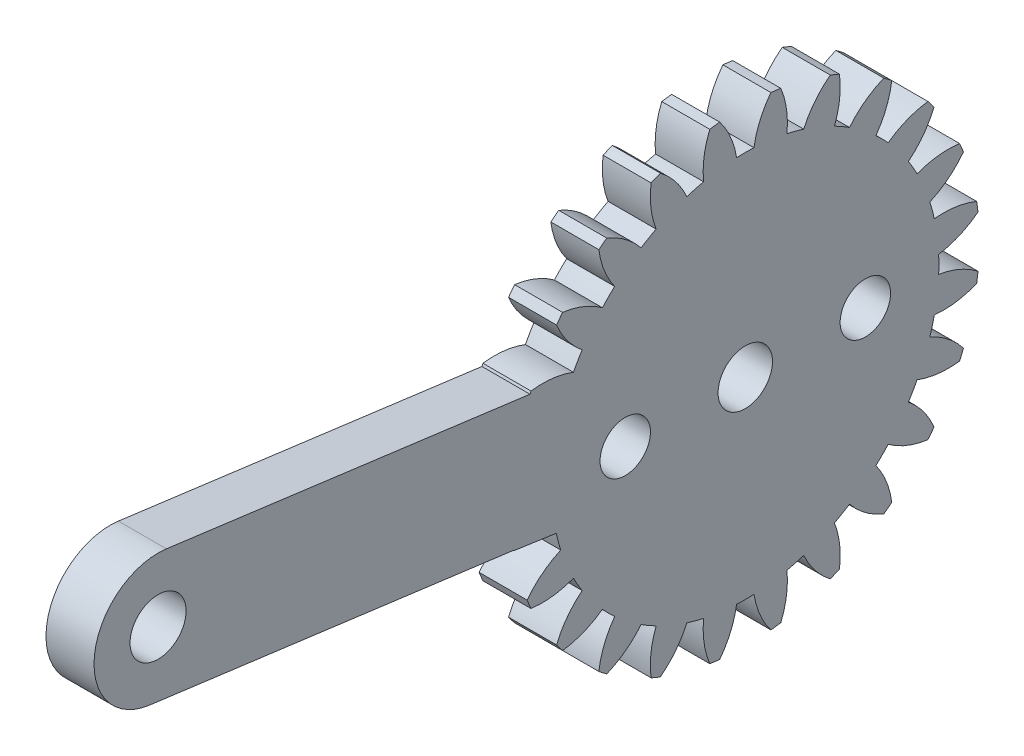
ISO-10303-21;
HEADER;
FILE_DESCRIPTION(('STEP AP214'),'2;1');
FILE_NAME('part.step','',(''),(''),'','','');
FILE_SCHEMA(('AUTOMOTIVE_DESIGN { 1 0 10303 214 1 1 1 1 }'));
ENDSEC;
DATA;
#1=APPLICATION_CONTEXT('core data for automotive mechanical design processes');
#2=APPLICATION_PROTOCOL_DEFINITION('international standard','automotive_design',2000,#1);
#3=PRODUCT_CONTEXT('',#1,'mechanical');
#4=PRODUCT('Part','Part','',(#3));
#5=PRODUCT_RELATED_PRODUCT_CATEGORY('part','',(#4));
#6=PRODUCT_DEFINITION_FORMATION('','',#4);
#7=PRODUCT_DEFINITION_CONTEXT('part definition',#1,'design');
#8=PRODUCT_DEFINITION('design','',#6,#7);
#9=PRODUCT_DEFINITION_SHAPE('','',#8);
#10=(LENGTH_UNIT() NAMED_UNIT(*) SI_UNIT(.MILLI.,.METRE.));
#11=(NAMED_UNIT(*) PLANE_ANGLE_UNIT() SI_UNIT($,.RADIAN.));
#12=(NAMED_UNIT(*) SI_UNIT($,.STERADIAN.) SOLID_ANGLE_UNIT());
#13=UNCERTAINTY_MEASURE_WITH_UNIT(LENGTH_MEASURE(1.E-05),#10,'distance_accuracy_value','');
#14=(GEOMETRIC_REPRESENTATION_CONTEXT(3) GLOBAL_UNCERTAINTY_ASSIGNED_CONTEXT((#13)) GLOBAL_UNIT_ASSIGNED_CONTEXT((#10,
#11,#12)) REPRESENTATION_CONTEXT('',''));
#15=CARTESIAN_POINT('',(0.,0.,0.));
#16=DIRECTION('',(0.,0.,1.));
#17=DIRECTION('',(1.,0.,0.));
#18=AXIS2_PLACEMENT_3D('',#15,#16,#17);
#19=CARTESIAN_POINT('',(-2.20152265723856,0.0638042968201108,0.));
#20=DIRECTION('',(-1.,0.,0.));
#21=DIRECTION('',(0.,0.,1.));
#22=AXIS2_PLACEMENT_3D('',#19,#20,#21);
#23=PLANE('',#22);
#24=CARTESIAN_POINT('',(-2.20152265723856,0.,0.));
#25=DIRECTION('',(1.,0.,0.));
#26=DIRECTION('',(0.,0.,-1.));
#27=AXIS2_PLACEMENT_3D('',#24,#25,#26);
#28=CIRCLE('',#27,1.7);
#29=CARTESIAN_POINT('',(-2.20152265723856,0.,-1.7));
#30=VERTEX_POINT('',#29);
#31=EDGE_CURVE('E1439',#30,#30,#28,.T.);
#32=ORIENTED_EDGE('',*,*,#31,.F.);
#33=EDGE_LOOP('',(#32));
#34=FACE_BOUND('',#33,.T.);
#35=CARTESIAN_POINT('',(-2.20152265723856,0.,7.5));
#36=DIRECTION('',(1.,0.,0.));
#37=DIRECTION('',(0.,0.,-1.));
#38=AXIS2_PLACEMENT_3D('',#35,#36,#37);
#39=CIRCLE('',#38,1.575);
#40=CARTESIAN_POINT('',(-2.20152265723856,0.,5.925));
#41=VERTEX_POINT('',#40);
#42=EDGE_CURVE('E1443',#41,#41,#39,.T.);
#43=ORIENTED_EDGE('',*,*,#42,.F.);
#44=EDGE_LOOP('',(#43));
#45=FACE_BOUND('',#44,.T.);
#46=CARTESIAN_POINT('',(-2.20152265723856,0.,-7.5));
#47=DIRECTION('',(1.,0.,0.));
#48=DIRECTION('',(0.,0.,-1.));
#49=AXIS2_PLACEMENT_3D('',#46,#47,#48);
#50=CIRCLE('',#49,1.575);
#51=CARTESIAN_POINT('',(-2.20152265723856,0.,-9.075));
#52=VERTEX_POINT('',#51);
#53=EDGE_CURVE('E1446',#52,#52,#50,.T.);
#54=ORIENTED_EDGE('',*,*,#53,.F.);
#55=EDGE_LOOP('',(#54));
#56=FACE_BOUND('',#55,.T.);
#57=CARTESIAN_POINT('',(-2.20152265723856,2.83108509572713,12.3803455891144));
#58=DIRECTION('',(-1.,0.,0.));
#59=DIRECTION('',(0.,0.965925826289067,0.258819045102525));
#60=AXIS2_PLACEMENT_3D('',#57,#58,#59);
#61=CIRCLE('',#60,5.39999999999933);
#62=CARTESIAN_POINT('',(-2.20152265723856,-2.16121472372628,14.4387290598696));
#63=VERTEX_POINT('',#62);
#64=CARTESIAN_POINT('',(-2.20152265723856,-2.15412374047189,14.4558438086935));
#65=VERTEX_POINT('',#64);
#66=EDGE_CURVE('E778',#63,#65,#61,.T.);
#67=ORIENTED_EDGE('',*,*,#66,.F.);
#68=DIRECTION('',(0.,-0.14209016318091,-0.989853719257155));
#69=VECTOR('',#68,1.);
#70=CARTESIAN_POINT('',(-2.20152265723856,-4.14707769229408,0.604457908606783));
#71=LINE('',#70,#69);
#72=CARTESIAN_POINT('',(-2.20152265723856,-2.53864650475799,11.8093967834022));
#73=VERTEX_POINT('',#72);
#74=EDGE_CURVE('E632',#63,#73,#71,.T.);
#75=ORIENTED_EDGE('',*,*,#74,.T.);
#76=CARTESIAN_POINT('',(-2.20152265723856,0.0638042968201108,0.));
#77=DIRECTION('',(-1.,0.,0.));
#78=DIRECTION('',(0.,0.965925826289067,0.258819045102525));
#79=AXIS2_PLACEMENT_3D('',#76,#77,#78);
#80=CIRCLE('',#79,12.0927499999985);
#81=CARTESIAN_POINT('',(-2.20152265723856,-3.58710558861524,11.5284630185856));
#82=VERTEX_POINT('',#81);
#83=EDGE_CURVE('E782',#82,#73,#80,.T.);
#84=ORIENTED_EDGE('',*,*,#83,.F.);
#85=CARTESIAN_POINT('',(-2.20152265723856,-8.52290396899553,9.33805338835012));
#86=DIRECTION('',(-1.,0.,0.));
#87=DIRECTION('',(0.,0.965925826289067,0.258819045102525));
#88=AXIS2_PLACEMENT_3D('',#85,#86,#87);
#89=CIRCLE('',#88,5.39999999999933);
#90=CARTESIAN_POINT('',(-2.20152265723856,-5.24333558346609,13.6280919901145));
#91=VERTEX_POINT('',#90);
#92=EDGE_CURVE('E780',#91,#82,#89,.T.);
#93=ORIENTED_EDGE('',*,*,#92,.F.);
#94=CARTESIAN_POINT('',(-2.20152265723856,0.0638042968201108,0.));
#95=DIRECTION('',(-1.,0.,0.));
#96=DIRECTION('',(0.,0.,1.));
#97=AXIS2_PLACEMENT_3D('',#94,#95,#96);
#98=CIRCLE('',#97,14.6249999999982);
#99=CARTESIAN_POINT('',(-2.20152265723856,-5.81999736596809,13.3892308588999));
#100=VERTEX_POINT('',#99);
#101=EDGE_CURVE('E1199',#100,#91,#98,.T.);
#102=ORIENTED_EDGE('',*,*,#101,.F.);
#103=CARTESIAN_POINT('',(-2.20152265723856,-0.467476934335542,12.6747205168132));
#104=DIRECTION('',(-1.,0.,0.));
#105=DIRECTION('',(0.,0.866025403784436,0.500000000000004));
#106=AXIS2_PLACEMENT_3D('',#103,#104,#105);
#107=CIRCLE('',#106,5.39999999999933);
#108=CARTESIAN_POINT('',(-2.20152265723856,-5.50646694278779,10.7334375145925));
#109=VERTEX_POINT('',#108);
#110=EDGE_CURVE('E804',#109,#100,#107,.T.);
#111=ORIENTED_EDGE('',*,*,#110,.F.);
#112=CARTESIAN_POINT('',(-2.20152265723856,0.0638042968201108,0.));
#113=DIRECTION('',(-1.,0.,0.));
#114=DIRECTION('',(0.,0.866025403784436,0.500000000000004));
#115=AXIS2_PLACEMENT_3D('',#112,#113,#114);
#116=CIRCLE('',#115,12.0927499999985);
#117=CARTESIAN_POINT('',(-2.20152265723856,-6.446489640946,10.1907151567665));
#118=VERTEX_POINT('',#117);
#119=EDGE_CURVE('E809',#118,#109,#116,.T.);
#120=ORIENTED_EDGE('',*,*,#119,.F.);
#121=CARTESIAN_POINT('',(-2.20152265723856,-10.6471850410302,6.79746330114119));
#122=DIRECTION('',(-1.,0.,0.));
#123=DIRECTION('',(0.,0.866025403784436,0.500000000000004));
#124=AXIS2_PLACEMENT_3D('',#121,#122,#123);
#125=CIRCLE('',#124,5.39999999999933);
#126=CARTESIAN_POINT('',(-2.20152265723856,-8.58970893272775,11.7901371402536));
#127=VERTEX_POINT('',#126);
#128=EDGE_CURVE('E806',#127,#118,#125,.T.);
#129=ORIENTED_EDGE('',*,*,#128,.F.);
#130=CARTESIAN_POINT('',(-2.20152265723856,-9.08489963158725,11.4101639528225));
#131=VERTEX_POINT('',#130);
#132=EDGE_CURVE('E1290',#131,#127,#98,.T.);
#133=ORIENTED_EDGE('',*,*,#132,.F.);
#134=CARTESIAN_POINT('',(-2.20152265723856,-3.72983302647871,12.1053341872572));
#135=DIRECTION('',(-1.,0.,0.));
#136=DIRECTION('',(0.,0.707106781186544,0.707106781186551));
#137=AXIS2_PLACEMENT_3D('',#134,#135,#136);
#138=CIRCLE('',#137,5.39999999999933);
#139=CARTESIAN_POINT('',(-2.20152265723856,-8.09468260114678,8.92601221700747));
#140=VERTEX_POINT('',#139);
#141=EDGE_CURVE('E787',#140,#131,#138,.T.);
#142=ORIENTED_EDGE('',*,*,#141,.F.);
#143=CARTESIAN_POINT('',(-2.20152265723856,0.0638042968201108,0.));
#144=DIRECTION('',(-1.,0.,0.));
#145=DIRECTION('',(0.,0.707106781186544,0.707106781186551));
#146=AXIS2_PLACEMENT_3D('',#143,#144,#145);
#147=CIRCLE('',#146,12.0927499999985);
#148=CARTESIAN_POINT('',(-2.20152265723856,-8.86220792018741,8.15848689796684));
#149=VERTEX_POINT('',#148);
#150=EDGE_CURVE('E792',#149,#140,#147,.T.);
#151=ORIENTED_EDGE('',*,*,#150,.F.);
#152=CARTESIAN_POINT('',(-2.20152265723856,-12.0415298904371,3.79363732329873));
#153=DIRECTION('',(-1.,0.,0.));
#154=DIRECTION('',(0.,0.707106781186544,0.707106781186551));
#155=AXIS2_PLACEMENT_3D('',#152,#153,#154);
#156=CIRCLE('',#155,5.39999999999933);
#157=CARTESIAN_POINT('',(-2.20152265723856,-11.3463596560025,9.14870392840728));
#158=VERTEX_POINT('',#157);
#159=EDGE_CURVE('E789',#158,#149,#156,.T.);
#160=ORIENTED_EDGE('',*,*,#159,.F.);
#161=CARTESIAN_POINT('',(-2.20152265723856,-11.7263328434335,8.65351322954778));
#162=VERTEX_POINT('',#161);
#163=EDGE_CURVE('E1284',#162,#158,#98,.T.);
#164=ORIENTED_EDGE('',*,*,#163,.F.);
#165=CARTESIAN_POINT('',(-2.20152265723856,-6.73365900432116,10.7109893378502));
#166=DIRECTION('',(-1.,0.,0.));
#167=DIRECTION('',(0.,0.499999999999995,0.866025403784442));
#168=AXIS2_PLACEMENT_3D('',#165,#166,#167);
#169=CIRCLE('',#168,5.39999999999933);
#170=CARTESIAN_POINT('',(-2.20152265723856,-10.1269108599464,6.51029393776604));
#171=VERTEX_POINT('',#170);
#172=EDGE_CURVE('E725',#171,#162,#169,.T.);
#173=ORIENTED_EDGE('',*,*,#172,.F.);
#174=CARTESIAN_POINT('',(-2.20152265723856,0.0638042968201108,0.));
#175=DIRECTION('',(-1.,0.,0.));
#176=DIRECTION('',(0.,0.499999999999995,0.866025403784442));
#177=AXIS2_PLACEMENT_3D('',#174,#175,#176);
#178=CIRCLE('',#177,12.0927499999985);
#179=CARTESIAN_POINT('',(-2.20152265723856,-10.6696332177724,5.57027123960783));
#180=VERTEX_POINT('',#179);
#181=EDGE_CURVE('E730',#180,#171,#178,.T.);
#182=ORIENTED_EDGE('',*,*,#181,.F.);
#183=CARTESIAN_POINT('',(-2.20152265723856,-12.6109162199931,0.531281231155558));
#184=DIRECTION('',(-1.,0.,0.));
#185=DIRECTION('',(0.,0.499999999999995,0.866025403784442));
#186=AXIS2_PLACEMENT_3D('',#183,#184,#185);
#187=CIRCLE('',#186,5.39999999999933);
#188=CARTESIAN_POINT('',(-2.20152265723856,-13.3254265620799,5.88380166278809));
#189=VERTEX_POINT('',#188);
#190=EDGE_CURVE('E727',#189,#180,#187,.T.);
#191=ORIENTED_EDGE('',*,*,#190,.F.);
#192=CARTESIAN_POINT('',(-2.20152265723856,-13.5642876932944,5.3071398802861));
#193=VERTEX_POINT('',#192);
#194=EDGE_CURVE('E1278',#193,#189,#98,.T.);
#195=ORIENTED_EDGE('',*,*,#194,.F.);
#196=CARTESIAN_POINT('',(-2.20152265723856,-9.27424909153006,8.58670826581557));
#197=DIRECTION('',(-1.,0.,0.));
#198=DIRECTION('',(0.,0.258819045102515,0.96592582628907));
#199=AXIS2_PLACEMENT_3D('',#196,#197,#198);
#200=CIRCLE('',#199,5.39999999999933);
#201=CARTESIAN_POINT('',(-2.20152265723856,-11.4646587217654,3.65090988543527));
#202=VERTEX_POINT('',#201);
#203=EDGE_CURVE('E744',#202,#193,#200,.T.);
#204=ORIENTED_EDGE('',*,*,#203,.F.);
#205=CARTESIAN_POINT('',(-2.20152265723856,0.0638042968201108,0.));
#206=DIRECTION('',(-1.,0.,0.));
#207=DIRECTION('',(0.,0.258819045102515,0.96592582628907));
#208=AXIS2_PLACEMENT_3D('',#205,#206,#207);
#209=CIRCLE('',#208,12.0927499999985);
#210=CARTESIAN_POINT('',(-2.20152265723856,-11.7455924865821,2.60245080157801));
#211=VERTEX_POINT('',#210);
#212=EDGE_CURVE('E749',#211,#202,#209,.T.);
#213=ORIENTED_EDGE('',*,*,#212,.F.);
#214=CARTESIAN_POINT('',(-2.20152265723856,-12.3165412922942,-2.76728079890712));
#215=DIRECTION('',(-1.,0.,0.));
#216=DIRECTION('',(0.,0.258819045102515,0.96592582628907));
#217=AXIS2_PLACEMENT_3D('',#214,#215,#216);
#218=CIRCLE('',#217,5.39999999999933);
#219=CARTESIAN_POINT('',(-2.20152265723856,-14.3920395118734,2.21792803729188));
#220=VERTEX_POINT('',#219);
#221=EDGE_CURVE('E746',#220,#211,#218,.T.);
#222=ORIENTED_EDGE('',*,*,#221,.F.);
#223=CARTESIAN_POINT('',(-2.20152265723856,-14.4735105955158,1.59909371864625));
#224=VERTEX_POINT('',#223);
#225=EDGE_CURVE('E1272',#224,#220,#98,.T.);
#226=ORIENTED_EDGE('',*,*,#225,.F.);
#227=CARTESIAN_POINT('',(-2.20152265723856,-11.1784662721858,5.87725721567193));
#228=DIRECTION('',(-1.,0.,0.));
#229=DIRECTION('',(0.,0.,1.));
#230=AXIS2_PLACEMENT_3D('',#227,#228,#229);
#231=CIRCLE('',#230,5.39999999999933);
#232=CARTESIAN_POINT('',(-2.20152265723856,-12.0167608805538,0.542722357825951));
#233=VERTEX_POINT('',#232);
#234=EDGE_CURVE('E761',#233,#224,#231,.T.);
#235=ORIENTED_EDGE('',*,*,#234,.F.);
#236=CARTESIAN_POINT('',(-2.20152265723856,0.0638042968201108,0.));
#237=DIRECTION('',(-1.,0.,0.));
#238=DIRECTION('',(0.,0.,1.));
#239=AXIS2_PLACEMENT_3D('',#236,#237,#238);
#240=CIRCLE('',#239,12.0927499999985);
#241=CARTESIAN_POINT('',(-2.20152265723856,-12.0167608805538,-0.542722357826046));
#242=VERTEX_POINT('',#241);
#243=EDGE_CURVE('E766',#242,#233,#240,.T.);
#244=ORIENTED_EDGE('',*,*,#243,.F.);
#245=CARTESIAN_POINT('',(-2.20152265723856,-11.1784662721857,-5.87725721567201));
#246=DIRECTION('',(-1.,0.,0.));
#247=DIRECTION('',(0.,0.,1.));
#248=AXIS2_PLACEMENT_3D('',#245,#246,#247);
#249=CIRCLE('',#248,5.39999999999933);
#250=CARTESIAN_POINT('',(-2.20152265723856,-14.4735105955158,-1.59909371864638));
#251=VERTEX_POINT('',#250);
#252=EDGE_CURVE('E763',#251,#242,#249,.T.);
#253=ORIENTED_EDGE('',*,*,#252,.F.);
#254=CARTESIAN_POINT('',(-2.20152265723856,-14.3920395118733,-2.21792803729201));
#255=VERTEX_POINT('',#254);
#256=EDGE_CURVE('E1266',#255,#251,#98,.T.);
#257=ORIENTED_EDGE('',*,*,#256,.F.);
#258=CARTESIAN_POINT('',(-2.20152265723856,-12.3165412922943,2.76728079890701));
#259=DIRECTION('',(-1.,0.,0.));
#260=DIRECTION('',(0.,-0.258819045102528,0.965925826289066));
#261=AXIS2_PLACEMENT_3D('',#258,#259,#260);
#262=CIRCLE('',#261,5.39999999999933);
#263=CARTESIAN_POINT('',(-2.20152265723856,-11.745592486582,-2.6024508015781));
#264=VERTEX_POINT('',#263);
#265=EDGE_CURVE('E872',#264,#255,#262,.T.);
#266=ORIENTED_EDGE('',*,*,#265,.F.);
#267=CARTESIAN_POINT('',(-2.20152265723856,0.0638042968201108,0.));
#268=DIRECTION('',(-1.,0.,0.));
#269=DIRECTION('',(0.,-0.258819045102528,0.965925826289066));
#270=AXIS2_PLACEMENT_3D('',#267,#268,#269);
#271=CIRCLE('',#270,12.0927499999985);
#272=CARTESIAN_POINT('',(-2.20152265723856,-11.4646587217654,-3.65090988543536));
#273=VERTEX_POINT('',#272);
#274=EDGE_CURVE('E877',#273,#264,#271,.T.);
#275=ORIENTED_EDGE('',*,*,#274,.F.);
#276=CARTESIAN_POINT('',(-2.20152265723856,-9.27424909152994,-8.58670826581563));
#277=DIRECTION('',(-1.,0.,0.));
#278=DIRECTION('',(0.,-0.258819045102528,0.965925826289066));
#279=AXIS2_PLACEMENT_3D('',#276,#277,#278);
#280=CIRCLE('',#279,5.39999999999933);
#281=CARTESIAN_POINT('',(-2.20152265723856,-13.5642876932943,-5.30713988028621));
#282=VERTEX_POINT('',#281);
#283=EDGE_CURVE('E874',#282,#273,#280,.T.);
#284=ORIENTED_EDGE('',*,*,#283,.F.);
#285=CARTESIAN_POINT('',(-2.20152265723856,-13.3254265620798,-5.88380166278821));
#286=VERTEX_POINT('',#285);
#287=EDGE_CURVE('E1260',#286,#282,#98,.T.);
#288=ORIENTED_EDGE('',*,*,#287,.F.);
#289=CARTESIAN_POINT('',(-2.20152265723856,-12.6109162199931,-0.531281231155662));
#290=DIRECTION('',(-1.,0.,0.));
#291=DIRECTION('',(0.,-0.500000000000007,0.866025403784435));
#292=AXIS2_PLACEMENT_3D('',#289,#290,#291);
#293=CIRCLE('',#292,5.39999999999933);
#294=CARTESIAN_POINT('',(-2.20152265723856,-10.6696332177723,-5.57027123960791));
#295=VERTEX_POINT('',#294);
#296=EDGE_CURVE('E889',#295,#286,#293,.T.);
#297=ORIENTED_EDGE('',*,*,#296,.F.);
#298=CARTESIAN_POINT('',(-2.20152265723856,0.0638042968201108,0.));
#299=DIRECTION('',(-1.,0.,0.));
#300=DIRECTION('',(0.,-0.500000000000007,0.866025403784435));
#301=AXIS2_PLACEMENT_3D('',#298,#299,#300);
#302=CIRCLE('',#301,12.0927499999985);
#303=CARTESIAN_POINT('',(-2.20152265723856,-10.1269108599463,-6.51029393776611));
#304=VERTEX_POINT('',#303);
#305=EDGE_CURVE('E894',#304,#295,#302,.T.);
#306=ORIENTED_EDGE('',*,*,#305,.F.);
#307=CARTESIAN_POINT('',(-2.20152265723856,-6.73365900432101,-10.7109893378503));
#308=DIRECTION('',(-1.,0.,0.));
#309=DIRECTION('',(0.,-0.500000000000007,0.866025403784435));
#310=AXIS2_PLACEMENT_3D('',#307,#308,#309);
#311=CIRCLE('',#310,5.39999999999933);
#312=CARTESIAN_POINT('',(-2.20152265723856,-11.7263328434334,-8.65351322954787));
#313=VERTEX_POINT('',#312);
#314=EDGE_CURVE('E891',#313,#304,#311,.T.);
#315=ORIENTED_EDGE('',*,*,#314,.F.);
#316=CARTESIAN_POINT('',(-2.20152265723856,-11.3463596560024,-9.14870392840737));
#317=VERTEX_POINT('',#316);
#318=EDGE_CURVE('E1254',#317,#313,#98,.T.);
#319=ORIENTED_EDGE('',*,*,#318,.F.);
#320=CARTESIAN_POINT('',(-2.20152265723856,-12.041529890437,-3.79363732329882));
#321=DIRECTION('',(-1.,0.,0.));
#322=DIRECTION('',(0.,-0.707106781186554,0.707106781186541));
#323=AXIS2_PLACEMENT_3D('',#320,#321,#322);
#324=CIRCLE('',#323,5.39999999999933);
#325=CARTESIAN_POINT('',(-2.20152265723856,-8.8622079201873,-8.15848689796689));
#326=VERTEX_POINT('',#325);
#327=EDGE_CURVE('E855',#326,#317,#324,.T.);
#328=ORIENTED_EDGE('',*,*,#327,.F.);
#329=CARTESIAN_POINT('',(-2.20152265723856,0.0638042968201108,0.));
#330=DIRECTION('',(-1.,0.,0.));
#331=DIRECTION('',(0.,-0.707106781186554,0.707106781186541));
#332=AXIS2_PLACEMENT_3D('',#329,#330,#331);
#333=CIRCLE('',#332,12.0927499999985);
#334=CARTESIAN_POINT('',(-2.20152265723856,-8.09468260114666,-8.92601221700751));
#335=VERTEX_POINT('',#334);
#336=EDGE_CURVE('E860',#335,#326,#333,.T.);
#337=ORIENTED_EDGE('',*,*,#336,.F.);
#338=CARTESIAN_POINT('',(-2.20152265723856,-3.72983302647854,-12.1053341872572));
#339=DIRECTION('',(-1.,0.,0.));
#340=DIRECTION('',(0.,-0.707106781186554,0.707106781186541));
#341=AXIS2_PLACEMENT_3D('',#338,#339,#340);
#342=CIRCLE('',#341,5.39999999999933);
#343=CARTESIAN_POINT('',(-2.20152265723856,-9.0848996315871,-11.4101639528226));
#344=VERTEX_POINT('',#343);
#345=EDGE_CURVE('E857',#344,#335,#342,.T.);
#346=ORIENTED_EDGE('',*,*,#345,.F.);
#347=CARTESIAN_POINT('',(-2.20152265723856,-8.58970893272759,-11.7901371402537));
#348=VERTEX_POINT('',#347);
#349=EDGE_CURVE('E1248',#348,#344,#98,.T.);
#350=ORIENTED_EDGE('',*,*,#349,.F.);
#351=CARTESIAN_POINT('',(-2.20152265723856,-10.6471850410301,-6.79746330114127));
#352=DIRECTION('',(-1.,0.,0.));
#353=DIRECTION('',(0.,-0.866025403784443,0.499999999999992));
#354=AXIS2_PLACEMENT_3D('',#351,#352,#353);
#355=CIRCLE('',#354,5.39999999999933);
#356=CARTESIAN_POINT('',(-2.20152265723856,-6.44648964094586,-10.1907151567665));
#357=VERTEX_POINT('',#356);
#358=EDGE_CURVE('E819',#357,#348,#355,.T.);
#359=ORIENTED_EDGE('',*,*,#358,.F.);
#360=CARTESIAN_POINT('',(-2.20152265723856,0.0638042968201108,0.));
#361=DIRECTION('',(-1.,0.,0.));
#362=DIRECTION('',(0.,-0.866025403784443,0.499999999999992));
#363=AXIS2_PLACEMENT_3D('',#360,#361,#362);
#364=CIRCLE('',#363,12.0927499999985);
#365=CARTESIAN_POINT('',(-2.20152265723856,-5.50646694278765,-10.7334375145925));
#366=VERTEX_POINT('',#365);
#367=EDGE_CURVE('E824',#366,#357,#364,.T.);
#368=ORIENTED_EDGE('',*,*,#367,.F.);
#369=CARTESIAN_POINT('',(-2.20152265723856,-0.467476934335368,-12.6747205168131));
#370=DIRECTION('',(-1.,0.,0.));
#371=DIRECTION('',(0.,-0.866025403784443,0.499999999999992));
#372=AXIS2_PLACEMENT_3D('',#369,#370,#371);
#373=CIRCLE('',#372,5.39999999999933);
#374=CARTESIAN_POINT('',(-2.20152265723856,-5.8199973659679,-13.3892308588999));
#375=VERTEX_POINT('',#374);
#376=EDGE_CURVE('E821',#375,#366,#373,.T.);
#377=ORIENTED_EDGE('',*,*,#376,.F.);
#378=CARTESIAN_POINT('',(-2.20152265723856,-5.2433355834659,-13.6280919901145));
#379=VERTEX_POINT('',#378);
#380=EDGE_CURVE('E1242',#379,#375,#98,.T.);
#381=ORIENTED_EDGE('',*,*,#380,.F.);
#382=CARTESIAN_POINT('',(-2.20152265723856,-8.5229039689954,-9.33805338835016));
#383=DIRECTION('',(-1.,0.,0.));
#384=DIRECTION('',(0.,-0.965925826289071,0.258819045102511));
#385=AXIS2_PLACEMENT_3D('',#382,#383,#384);
#386=CIRCLE('',#385,5.39999999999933);
#387=CARTESIAN_POINT('',(-2.20152265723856,-3.58710558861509,-11.5284630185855));
#388=VERTEX_POINT('',#387);
#389=EDGE_CURVE('E838',#388,#379,#386,.T.);
#390=ORIENTED_EDGE('',*,*,#389,.F.);
#391=CARTESIAN_POINT('',(-2.20152265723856,0.0638042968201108,0.));
#392=DIRECTION('',(-1.,0.,0.));
#393=DIRECTION('',(0.,-0.965925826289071,0.258819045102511));
#394=AXIS2_PLACEMENT_3D('',#391,#392,#393);
#395=CIRCLE('',#394,12.0927499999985);
#396=CARTESIAN_POINT('',(-2.20152265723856,-2.53864650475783,-11.8093967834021));
#397=VERTEX_POINT('',#396);
#398=EDGE_CURVE('E843',#397,#388,#395,.T.);
#399=ORIENTED_EDGE('',*,*,#398,.F.);
#400=CARTESIAN_POINT('',(-2.20152265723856,2.8310850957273,-12.3803455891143));
#401=DIRECTION('',(-1.,0.,0.));
#402=DIRECTION('',(0.,-0.965925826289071,0.258819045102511));
#403=AXIS2_PLACEMENT_3D('',#400,#401,#402);
#404=CIRCLE('',#403,5.39999999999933);
#405=CARTESIAN_POINT('',(-2.20152265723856,-2.15412374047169,-14.4558438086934));
#406=VERTEX_POINT('',#405);
#407=EDGE_CURVE('E840',#406,#397,#404,.T.);
#408=ORIENTED_EDGE('',*,*,#407,.F.);
#409=CARTESIAN_POINT('',(-2.20152265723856,-1.53528942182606,-14.5373148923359));
#410=VERTEX_POINT('',#409);
#411=EDGE_CURVE('E1236',#410,#406,#98,.T.);
#412=ORIENTED_EDGE('',*,*,#411,.F.);
#413=CARTESIAN_POINT('',(-2.20152265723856,-5.81345291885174,-11.2422705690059));
#414=DIRECTION('',(-1.,0.,0.));
#415=DIRECTION('',(0.,-1.,0.));
#416=AXIS2_PLACEMENT_3D('',#413,#414,#415);
#417=CIRCLE('',#416,5.39999999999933);
#418=CARTESIAN_POINT('',(-2.20152265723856,-0.478918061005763,-12.0805651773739));
#419=VERTEX_POINT('',#418);
#420=EDGE_CURVE('E955',#419,#410,#417,.T.);
#421=ORIENTED_EDGE('',*,*,#420,.F.);
#422=CARTESIAN_POINT('',(-2.20152265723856,0.0638042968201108,0.));
#423=DIRECTION('',(-1.,0.,0.));
#424=DIRECTION('',(0.,-1.,0.));
#425=AXIS2_PLACEMENT_3D('',#422,#423,#424);
#426=CIRCLE('',#425,12.0927499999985);
#427=CARTESIAN_POINT('',(-2.20152265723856,0.606526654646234,-12.0805651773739));
#428=VERTEX_POINT('',#427);
#429=EDGE_CURVE('E960',#428,#419,#426,.T.);
#430=ORIENTED_EDGE('',*,*,#429,.F.);
#431=CARTESIAN_POINT('',(-2.20152265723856,5.9410615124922,-11.2422705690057));
#432=DIRECTION('',(-1.,0.,0.));
#433=DIRECTION('',(0.,-1.,0.));
#434=AXIS2_PLACEMENT_3D('',#431,#432,#433);
#435=CIRCLE('',#434,5.39999999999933);
#436=CARTESIAN_POINT('',(-2.20152265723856,1.66289801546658,-14.5373148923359));
#437=VERTEX_POINT('',#436);
#438=EDGE_CURVE('E957',#437,#428,#435,.T.);
#439=ORIENTED_EDGE('',*,*,#438,.F.);
#440=CARTESIAN_POINT('',(-2.20152265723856,2.28173233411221,-14.4558438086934));
#441=VERTEX_POINT('',#440);
#442=EDGE_CURVE('E1230',#441,#437,#98,.T.);
#443=ORIENTED_EDGE('',*,*,#442,.F.);
#444=CARTESIAN_POINT('',(-2.20152265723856,-2.70347650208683,-12.3803455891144));
#445=DIRECTION('',(-1.,0.,0.));
#446=DIRECTION('',(0.,-0.965925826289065,-0.258819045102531));
#447=AXIS2_PLACEMENT_3D('',#444,#445,#446);
#448=CIRCLE('',#447,5.39999999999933);
#449=CARTESIAN_POINT('',(-2.20152265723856,2.66625509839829,-11.8093967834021));
#450=VERTEX_POINT('',#449);
#451=EDGE_CURVE('E972',#450,#441,#448,.T.);
#452=ORIENTED_EDGE('',*,*,#451,.F.);
#453=CARTESIAN_POINT('',(-2.20152265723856,0.0638042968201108,0.));
#454=DIRECTION('',(-1.,0.,0.));
#455=DIRECTION('',(0.,-0.965925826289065,-0.258819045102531));
#456=AXIS2_PLACEMENT_3D('',#453,#454,#455);
#457=CIRCLE('',#456,12.0927499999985);
#458=CARTESIAN_POINT('',(-2.20152265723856,3.71471418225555,-11.5284630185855));
#459=VERTEX_POINT('',#458);
#460=EDGE_CURVE('E977',#459,#450,#457,.T.);
#461=ORIENTED_EDGE('',*,*,#460,.F.);
#462=CARTESIAN_POINT('',(-2.20152265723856,8.65051256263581,-9.33805338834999));
#463=DIRECTION('',(-1.,0.,0.));
#464=DIRECTION('',(0.,-0.965925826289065,-0.258819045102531));
#465=AXIS2_PLACEMENT_3D('',#462,#463,#464);
#466=CIRCLE('',#465,5.39999999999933);
#467=CARTESIAN_POINT('',(-2.20152265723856,5.37094417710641,-13.6280919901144));
#468=VERTEX_POINT('',#467);
#469=EDGE_CURVE('E974',#468,#459,#466,.T.);
#470=ORIENTED_EDGE('',*,*,#469,.F.);
#471=CARTESIAN_POINT('',(-2.20152265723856,5.9476059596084,-13.3892308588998));
#472=VERTEX_POINT('',#471);
#473=EDGE_CURVE('E1224',#472,#468,#98,.T.);
#474=ORIENTED_EDGE('',*,*,#473,.F.);
#475=CARTESIAN_POINT('',(-2.20152265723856,0.595085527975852,-12.6747205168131));
#476=DIRECTION('',(-1.,0.,0.));
#477=DIRECTION('',(0.,-0.866025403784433,-0.50000000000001));
#478=AXIS2_PLACEMENT_3D('',#475,#476,#477);
#479=CIRCLE('',#478,5.39999999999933);
#480=CARTESIAN_POINT('',(-2.20152265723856,5.63407553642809,-10.7334375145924));
#481=VERTEX_POINT('',#480);
#482=EDGE_CURVE('E989',#481,#472,#479,.T.);
#483=ORIENTED_EDGE('',*,*,#482,.F.);
#484=CARTESIAN_POINT('',(-2.20152265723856,0.0638042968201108,0.));
#485=DIRECTION('',(-1.,0.,0.));
#486=DIRECTION('',(0.,-0.866025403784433,-0.50000000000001));
#487=AXIS2_PLACEMENT_3D('',#484,#485,#486);
#488=CIRCLE('',#487,12.0927499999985);
#489=CARTESIAN_POINT('',(-2.20152265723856,6.57409823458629,-10.1907151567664));
#490=VERTEX_POINT('',#489);
#491=EDGE_CURVE('E994',#490,#481,#488,.T.);
#492=ORIENTED_EDGE('',*,*,#491,.F.);
#493=CARTESIAN_POINT('',(-2.20152265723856,10.7747936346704,-6.79746330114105));
#494=DIRECTION('',(-1.,0.,0.));
#495=DIRECTION('',(0.,-0.866025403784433,-0.50000000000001));
#496=AXIS2_PLACEMENT_3D('',#493,#494,#495);
#497=CIRCLE('',#496,5.39999999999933);
#498=CARTESIAN_POINT('',(-2.20152265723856,8.71731752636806,-11.7901371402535));
#499=VERTEX_POINT('',#498);
#500=EDGE_CURVE('E991',#499,#490,#497,.T.);
#501=ORIENTED_EDGE('',*,*,#500,.F.);
#502=CARTESIAN_POINT('',(-2.20152265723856,9.21250822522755,-11.4101639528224));
#503=VERTEX_POINT('',#502);
#504=EDGE_CURVE('E1218',#503,#499,#98,.T.);
#505=ORIENTED_EDGE('',*,*,#504,.F.);
#506=CARTESIAN_POINT('',(-2.20152265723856,3.85744162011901,-12.1053341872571));
#507=DIRECTION('',(-1.,0.,0.));
#508=DIRECTION('',(0.,-0.707106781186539,-0.707106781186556));
#509=AXIS2_PLACEMENT_3D('',#506,#507,#508);
#510=CIRCLE('',#509,5.39999999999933);
#511=CARTESIAN_POINT('',(-2.20152265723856,8.22229119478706,-8.92601221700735));
#512=VERTEX_POINT('',#511);
#513=EDGE_CURVE('E938',#512,#503,#510,.T.);
#514=ORIENTED_EDGE('',*,*,#513,.F.);
#515=CARTESIAN_POINT('',(-2.20152265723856,0.0638042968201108,0.));
#516=DIRECTION('',(-1.,0.,0.));
#517=DIRECTION('',(0.,-0.707106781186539,-0.707106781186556));
#518=AXIS2_PLACEMENT_3D('',#515,#516,#517);
#519=CIRCLE('',#518,12.0927499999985);
#520=CARTESIAN_POINT('',(-2.20152265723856,8.98981651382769,-8.1584868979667));
#521=VERTEX_POINT('',#520);
#522=EDGE_CURVE('E943',#521,#512,#519,.T.);
#523=ORIENTED_EDGE('',*,*,#522,.F.);
#524=CARTESIAN_POINT('',(-2.20152265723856,12.1691384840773,-3.79363732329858));
#525=DIRECTION('',(-1.,0.,0.));
#526=DIRECTION('',(0.,-0.707106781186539,-0.707106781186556));
#527=AXIS2_PLACEMENT_3D('',#524,#525,#526);
#528=CIRCLE('',#527,5.39999999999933);
#529=CARTESIAN_POINT('',(-2.20152265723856,11.4739682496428,-9.14870392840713));
#530=VERTEX_POINT('',#529);
#531=EDGE_CURVE('E940',#530,#521,#528,.T.);
#532=ORIENTED_EDGE('',*,*,#531,.F.);
#533=CARTESIAN_POINT('',(-2.20152265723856,11.8539414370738,-8.65351322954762));
#534=VERTEX_POINT('',#533);
#535=EDGE_CURVE('E1212',#534,#530,#98,.T.);
#536=ORIENTED_EDGE('',*,*,#535,.F.);
#537=CARTESIAN_POINT('',(-2.20152265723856,6.86126759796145,-10.7109893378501));
#538=DIRECTION('',(-1.,0.,0.));
#539=DIRECTION('',(0.,-0.499999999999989,-0.866025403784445));
#540=AXIS2_PLACEMENT_3D('',#537,#538,#539);
#541=CIRCLE('',#540,5.39999999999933);
#542=CARTESIAN_POINT('',(-2.20152265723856,10.2545194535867,-6.5102939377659));
#543=VERTEX_POINT('',#542);
#544=EDGE_CURVE('E904',#543,#534,#541,.T.);
#545=ORIENTED_EDGE('',*,*,#544,.F.);
#546=CARTESIAN_POINT('',(-2.20152265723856,0.0638042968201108,0.));
#547=DIRECTION('',(-1.,0.,0.));
#548=DIRECTION('',(0.,-0.499999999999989,-0.866025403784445));
#549=AXIS2_PLACEMENT_3D('',#546,#547,#548);
#550=CIRCLE('',#549,12.0927499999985);
#551=CARTESIAN_POINT('',(-2.20152265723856,10.7972418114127,-5.57027123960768));
#552=VERTEX_POINT('',#551);
#553=EDGE_CURVE('E909',#552,#543,#550,.T.);
#554=ORIENTED_EDGE('',*,*,#553,.F.);
#555=CARTESIAN_POINT('',(-2.20152265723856,12.7385248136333,-0.531281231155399));
#556=DIRECTION('',(-1.,0.,0.));
#557=DIRECTION('',(0.,-0.499999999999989,-0.866025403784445));
#558=AXIS2_PLACEMENT_3D('',#555,#556,#557);
#559=CIRCLE('',#558,5.39999999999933);
#560=CARTESIAN_POINT('',(-2.20152265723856,13.4530351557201,-5.88380166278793));
#561=VERTEX_POINT('',#560);
#562=EDGE_CURVE('E906',#561,#552,#559,.T.);
#563=ORIENTED_EDGE('',*,*,#562,.F.);
#564=CARTESIAN_POINT('',(-2.20152265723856,13.6918962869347,-5.30713988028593));
#565=VERTEX_POINT('',#564);
#566=EDGE_CURVE('E1138',#565,#561,#98,.T.);
#567=ORIENTED_EDGE('',*,*,#566,.F.);
#568=CARTESIAN_POINT('',(-2.20152265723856,9.40185768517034,-8.58670826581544));
#569=DIRECTION('',(-1.,0.,0.));
#570=DIRECTION('',(0.,-0.258819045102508,-0.965925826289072));
#571=AXIS2_PLACEMENT_3D('',#568,#569,#570);
#572=CIRCLE('',#571,5.39999999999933);
#573=CARTESIAN_POINT('',(-2.20152265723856,11.5922673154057,-3.65090988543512));
#574=VERTEX_POINT('',#573);
#575=EDGE_CURVE('E923',#574,#565,#572,.T.);
#576=ORIENTED_EDGE('',*,*,#575,.F.);
#577=CARTESIAN_POINT('',(-2.20152265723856,0.0638042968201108,0.));
#578=DIRECTION('',(-1.,0.,0.));
#579=DIRECTION('',(0.,-0.258819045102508,-0.965925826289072));
#580=AXIS2_PLACEMENT_3D('',#577,#578,#579);
#581=CIRCLE('',#580,12.0927499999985);
#582=CARTESIAN_POINT('',(-2.20152265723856,11.8732010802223,-2.60245080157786));
#583=VERTEX_POINT('',#582);
#584=EDGE_CURVE('E928',#583,#574,#581,.T.);
#585=ORIENTED_EDGE('',*,*,#584,.F.);
#586=CARTESIAN_POINT('',(-2.20152265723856,12.4441498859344,2.76728079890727));
#587=DIRECTION('',(-1.,0.,0.));
#588=DIRECTION('',(0.,-0.258819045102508,-0.965925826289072));
#589=AXIS2_PLACEMENT_3D('',#586,#587,#588);
#590=CIRCLE('',#589,5.39999999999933);
#591=CARTESIAN_POINT('',(-2.20152265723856,14.5196481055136,-2.21792803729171));
#592=VERTEX_POINT('',#591);
#593=EDGE_CURVE('E925',#592,#583,#590,.T.);
#594=ORIENTED_EDGE('',*,*,#593,.F.);
#595=CARTESIAN_POINT('',(-2.20152265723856,14.6011191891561,-1.59909371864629));
#596=VERTEX_POINT('',#595);
#597=EDGE_CURVE('E1134',#596,#592,#98,.T.);
#598=ORIENTED_EDGE('',*,*,#597,.F.);
#599=CARTESIAN_POINT('',(-2.20152265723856,11.3060748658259,-5.87725721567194));
#600=DIRECTION('',(-1.,0.,0.));
#601=DIRECTION('',(0.,0.,-1.));
#602=AXIS2_PLACEMENT_3D('',#599,#600,#601);
#603=CIRCLE('',#602,5.39999999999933);
#604=CARTESIAN_POINT('',(-2.20152265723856,12.144369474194,-0.542722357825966));
#605=VERTEX_POINT('',#604);
#606=EDGE_CURVE('E1106',#605,#596,#603,.T.);
#607=ORIENTED_EDGE('',*,*,#606,.F.);
#608=CARTESIAN_POINT('',(-2.20152265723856,0.0638042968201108,0.));
#609=DIRECTION('',(-1.,0.,0.));
#610=DIRECTION('',(0.,0.,-1.));
#611=AXIS2_PLACEMENT_3D('',#608,#609,#610);
#612=CIRCLE('',#611,12.0927499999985);
#613=CARTESIAN_POINT('',(-2.20152265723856,12.144369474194,0.542722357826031));
#614=VERTEX_POINT('',#613);
#615=EDGE_CURVE('E1111',#614,#605,#612,.T.);
#616=ORIENTED_EDGE('',*,*,#615,.F.);
#617=CARTESIAN_POINT('',(-2.20152265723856,11.3060748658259,5.877257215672));
#618=DIRECTION('',(-1.,0.,0.));
#619=DIRECTION('',(0.,0.,-1.));
#620=AXIS2_PLACEMENT_3D('',#617,#618,#619);
#621=CIRCLE('',#620,5.39999999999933);
#622=CARTESIAN_POINT('',(-2.20152265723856,14.6011191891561,1.59909371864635));
#623=VERTEX_POINT('',#622);
#624=EDGE_CURVE('E1108',#623,#614,#621,.T.);
#625=ORIENTED_EDGE('',*,*,#624,.F.);
#626=CARTESIAN_POINT('',(-2.20152265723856,14.5196481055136,2.21792803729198));
#627=VERTEX_POINT('',#626);
#628=EDGE_CURVE('E1131',#627,#623,#98,.T.);
#629=ORIENTED_EDGE('',*,*,#628,.F.);
#630=CARTESIAN_POINT('',(-2.20152265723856,12.4441498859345,-2.76728079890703));
#631=DIRECTION('',(-1.,0.,0.));
#632=DIRECTION('',(0.,0.258819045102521,-0.965925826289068));
#633=AXIS2_PLACEMENT_3D('',#630,#631,#632);
#634=CIRCLE('',#633,5.39999999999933);
#635=CARTESIAN_POINT('',(-2.20152265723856,11.8732010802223,2.60245080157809));
#636=VERTEX_POINT('',#635);
#637=EDGE_CURVE('E1084',#636,#627,#634,.T.);
#638=ORIENTED_EDGE('',*,*,#637,.F.);
#639=CARTESIAN_POINT('',(-2.20152265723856,0.0638042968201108,0.));
#640=DIRECTION('',(-1.,0.,0.));
#641=DIRECTION('',(0.,0.258819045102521,-0.965925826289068));
#642=AXIS2_PLACEMENT_3D('',#639,#640,#641);
#643=CIRCLE('',#642,12.0927499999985);
#644=CARTESIAN_POINT('',(-2.20152265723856,11.5922673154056,3.65090988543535));
#645=VERTEX_POINT('',#644);
#646=EDGE_CURVE('E1089',#645,#636,#643,.T.);
#647=ORIENTED_EDGE('',*,*,#646,.F.);
#648=CARTESIAN_POINT('',(-2.20152265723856,9.40185768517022,8.58670826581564));
#649=DIRECTION('',(-1.,0.,0.));
#650=DIRECTION('',(0.,0.258819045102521,-0.965925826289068));
#651=AXIS2_PLACEMENT_3D('',#648,#649,#650);
#652=CIRCLE('',#651,5.39999999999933);
#653=CARTESIAN_POINT('',(-2.20152265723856,13.6918962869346,5.30713988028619));
#654=VERTEX_POINT('',#653);
#655=EDGE_CURVE('E1086',#654,#645,#652,.T.);
#656=ORIENTED_EDGE('',*,*,#655,.F.);
#657=CARTESIAN_POINT('',(-2.20152265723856,13.45303515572,5.88380166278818));
#658=VERTEX_POINT('',#657);
#659=EDGE_CURVE('E1198',#658,#654,#98,.T.);
#660=ORIENTED_EDGE('',*,*,#659,.F.);
#661=CARTESIAN_POINT('',(-2.20152265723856,12.7385248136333,0.531281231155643));
#662=DIRECTION('',(-1.,0.,0.));
#663=DIRECTION('',(0.,0.500000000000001,-0.866025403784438));
#664=AXIS2_PLACEMENT_3D('',#661,#662,#663);
#665=CIRCLE('',#664,5.39999999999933);
#666=CARTESIAN_POINT('',(-2.20152265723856,10.7972418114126,5.5702712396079));
#667=VERTEX_POINT('',#666);
#668=EDGE_CURVE('E708',#667,#658,#665,.T.);
#669=ORIENTED_EDGE('',*,*,#668,.F.);
#670=CARTESIAN_POINT('',(-2.20152265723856,0.0638042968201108,0.));
#671=DIRECTION('',(-1.,0.,0.));
#672=DIRECTION('',(0.,0.500000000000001,-0.866025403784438));
#673=AXIS2_PLACEMENT_3D('',#670,#671,#672);
#674=CIRCLE('',#673,12.0927499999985);
#675=CARTESIAN_POINT('',(-2.20152265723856,10.2545194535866,6.5102939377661));
#676=VERTEX_POINT('',#675);
#677=EDGE_CURVE('E713',#676,#667,#674,.T.);
#678=ORIENTED_EDGE('',*,*,#677,.F.);
#679=CARTESIAN_POINT('',(-2.20152265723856,6.8612675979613,10.7109893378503));
#680=DIRECTION('',(-1.,0.,0.));
#681=DIRECTION('',(0.,0.500000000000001,-0.866025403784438));
#682=AXIS2_PLACEMENT_3D('',#679,#680,#681);
#683=CIRCLE('',#682,5.39999999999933);
#684=CARTESIAN_POINT('',(-2.20152265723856,11.8539414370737,8.65351322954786));
#685=VERTEX_POINT('',#684);
#686=EDGE_CURVE('E710',#685,#676,#683,.T.);
#687=ORIENTED_EDGE('',*,*,#686,.F.);
#688=CARTESIAN_POINT('',(-2.20152265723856,11.4739682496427,9.14870392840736));
#689=VERTEX_POINT('',#688);
#690=EDGE_CURVE('E1201',#689,#685,#98,.T.);
#691=ORIENTED_EDGE('',*,*,#690,.F.);
#692=CARTESIAN_POINT('',(-2.20152265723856,12.1691384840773,3.79363732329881));
#693=DIRECTION('',(-1.,0.,0.));
#694=DIRECTION('',(0.,0.707106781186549,-0.707106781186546));
#695=AXIS2_PLACEMENT_3D('',#692,#693,#694);
#696=CIRCLE('',#695,5.39999999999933);
#697=CARTESIAN_POINT('',(-2.20152265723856,8.98981651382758,8.1584868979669));
#698=VERTEX_POINT('',#697);
#699=EDGE_CURVE('E691',#698,#689,#696,.T.);
#700=ORIENTED_EDGE('',*,*,#699,.F.);
#701=CARTESIAN_POINT('',(-2.20152265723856,0.0638042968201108,0.));
#702=DIRECTION('',(-1.,0.,0.));
#703=DIRECTION('',(0.,0.707106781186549,-0.707106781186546));
#704=AXIS2_PLACEMENT_3D('',#701,#702,#703);
#705=CIRCLE('',#704,12.0927499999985);
#706=CARTESIAN_POINT('',(-2.20152265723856,8.22229119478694,8.92601221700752));
#707=VERTEX_POINT('',#706);
#708=EDGE_CURVE('E696',#707,#698,#705,.T.);
#709=ORIENTED_EDGE('',*,*,#708,.F.);
#710=CARTESIAN_POINT('',(-2.20152265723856,3.85744162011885,12.1053341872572));
#711=DIRECTION('',(-1.,0.,0.));
#712=DIRECTION('',(0.,0.707106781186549,-0.707106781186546));
#713=AXIS2_PLACEMENT_3D('',#710,#711,#712);
#714=CIRCLE('',#713,5.39999999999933);
#715=CARTESIAN_POINT('',(-2.20152265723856,9.2125082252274,11.4101639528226));
#716=VERTEX_POINT('',#715);
#717=EDGE_CURVE('E693',#716,#707,#714,.T.);
#718=ORIENTED_EDGE('',*,*,#717,.F.);
#719=CARTESIAN_POINT('',(-2.20152265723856,8.71731752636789,11.7901371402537));
#720=VERTEX_POINT('',#719);
#721=EDGE_CURVE('E1197',#720,#716,#98,.T.);
#722=ORIENTED_EDGE('',*,*,#721,.F.);
#723=CARTESIAN_POINT('',(-2.20152265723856,10.7747936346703,6.79746330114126));
#724=DIRECTION('',(-1.,0.,0.));
#725=DIRECTION('',(0.,0.86602540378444,-0.499999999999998));
#726=AXIS2_PLACEMENT_3D('',#723,#724,#725);
#727=CIRCLE('',#726,5.39999999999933);
#728=CARTESIAN_POINT('',(-2.20152265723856,6.57409823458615,10.1907151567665));
#729=VERTEX_POINT('',#728);
#730=EDGE_CURVE('E672',#729,#720,#727,.T.);
#731=ORIENTED_EDGE('',*,*,#730,.F.);
#732=CARTESIAN_POINT('',(-2.20152265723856,0.0638042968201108,0.));
#733=DIRECTION('',(-1.,0.,0.));
#734=DIRECTION('',(0.,0.86602540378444,-0.499999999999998));
#735=AXIS2_PLACEMENT_3D('',#732,#733,#734);
#736=CIRCLE('',#735,12.0927499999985);
#737=CARTESIAN_POINT('',(-2.20152265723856,5.63407553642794,10.7334375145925));
#738=VERTEX_POINT('',#737);
#739=EDGE_CURVE('E677',#738,#729,#736,.T.);
#740=ORIENTED_EDGE('',*,*,#739,.F.);
#741=CARTESIAN_POINT('',(-2.20152265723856,0.595085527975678,12.6747205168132));
#742=DIRECTION('',(-1.,0.,0.));
#743=DIRECTION('',(0.,0.86602540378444,-0.499999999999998));
#744=AXIS2_PLACEMENT_3D('',#741,#742,#743);
#745=CIRCLE('',#744,5.39999999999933);
#746=CARTESIAN_POINT('',(-2.20152265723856,5.94760595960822,13.3892308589));
#747=VERTEX_POINT('',#746);
#748=EDGE_CURVE('E674',#747,#738,#745,.T.);
#749=ORIENTED_EDGE('',*,*,#748,.F.);
#750=CARTESIAN_POINT('',(-2.20152265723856,5.80535322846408,13.4508453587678));
#751=VERTEX_POINT('',#750);
#752=EDGE_CURVE('E1139',#751,#747,#98,.T.);
#753=ORIENTED_EDGE('',*,*,#752,.F.);
#754=DIRECTION('',(0.,0.130526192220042,0.991444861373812));
#755=VECTOR('',#754,1.);
#756=CARTESIAN_POINT('',(-2.20152265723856,3.96577944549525,-0.522104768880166));
#757=LINE('',#756,#755);
#758=CARTESIAN_POINT('',(-2.20152265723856,8.79524855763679,36.1613551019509));
#759=VERTEX_POINT('',#758);
#760=EDGE_CURVE('E648',#751,#759,#757,.T.);
#761=ORIENTED_EDGE('',*,*,#760,.T.);
#762=CARTESIAN_POINT('',(-2.20152265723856,4.82946911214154,36.683459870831));
#763=DIRECTION('',(1.,0.,0.));
#764=DIRECTION('',(0.,0.,-1.));
#765=AXIS2_PLACEMENT_3D('',#762,#763,#764);
#766=CIRCLE('',#765,4.);
#767=CARTESIAN_POINT('',(-2.20152265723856,0.863689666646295,37.2055646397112));
#768=VERTEX_POINT('',#767);
#769=EDGE_CURVE('E659',#759,#768,#766,.T.);
#770=ORIENTED_EDGE('',*,*,#769,.T.);
#771=DIRECTION('',(0.,-0.130526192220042,-0.991444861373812));
#772=VECTOR('',#771,1.);
#773=CARTESIAN_POINT('',(-2.20152265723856,-3.96577944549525,0.522104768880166));
#774=LINE('',#773,#772);
#775=CARTESIAN_POINT('',(-2.20152265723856,-2.13090134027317,14.4593876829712));
#776=VERTEX_POINT('',#775);
#777=EDGE_CURVE('E60',#768,#776,#774,.T.);
#778=ORIENTED_EDGE('',*,*,#777,.T.);
#779=EDGE_CURVE('E1196',#65,#776,#98,.T.);
#780=ORIENTED_EDGE('',*,*,#779,.F.);
#781=EDGE_LOOP('',(#67,#75,#84,#93,#102,#111,#120,#129,#133,#142,#151,#160,#164,#173,#182,#191,
#195,#204,#213,#222,#226,#235,#244,#253,#257,#266,#275,#284,#288,#297,#306,#315,#319,#328,#337,
#346,#350,#359,#368,#377,#381,#390,#399,#408,#412,#421,#430,#439,#443,#452,#461,#470,#474,#483,
#492,#501,#505,#514,#523,#532,#536,#545,#554,#563,#567,#576,#585,#594,#598,#607,#616,#625,#629,
#638,#647,#656,#660,#669,#678,#687,#691,#700,#709,#718,#722,#731,#740,#749,#753,#761,#770,#778,#780));
#782=FACE_BOUND('',#781,.T.);
#783=CARTESIAN_POINT('',(-2.20152265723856,4.82946911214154,36.683459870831));
#784=DIRECTION('',(1.,0.,0.));
#785=DIRECTION('',(0.,0.,-1.));
#786=AXIS2_PLACEMENT_3D('',#783,#784,#785);
#787=CIRCLE('',#786,1.75);
#788=CARTESIAN_POINT('',(-2.20152265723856,4.82946911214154,34.933459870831));
#789=VERTEX_POINT('',#788);
#790=EDGE_CURVE('E640',#789,#789,#787,.T.);
#791=ORIENTED_EDGE('',*,*,#790,.F.);
#792=EDGE_LOOP('',(#791));
#793=FACE_BOUND('',#792,.T.);
#794=ADVANCED_FACE('F39',(#34,#45,#56,#782,#793),#23,.F.);
#795=CARTESIAN_POINT('',(-15.2015226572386,0.0638042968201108,0.));
#796=DIRECTION('',(-1.,0.,0.));
#797=DIRECTION('',(0.,0.,1.));
#798=AXIS2_PLACEMENT_3D('',#795,#796,#797);
#799=CYLINDRICAL_SURFACE('',#798,14.6249999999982);
#800=ORIENTED_EDGE('',*,*,#779,.T.);
#801=DIRECTION('',(-1.,0.,0.));
#802=VECTOR('',#801,1.);
#803=CARTESIAN_POINT('',(-15.2015226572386,-2.13090134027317,14.4593876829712));
#804=LINE('',#803,#802);
#805=CARTESIAN_POINT('',(-5.20152265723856,-2.13090134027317,14.4593876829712));
#806=VERTEX_POINT('',#805);
#807=EDGE_CURVE('E668',#776,#806,#804,.T.);
#808=ORIENTED_EDGE('',*,*,#807,.T.);
#809=CARTESIAN_POINT('',(-5.20152265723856,0.0638042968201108,0.));
#810=DIRECTION('',(-1.,0.,0.));
#811=DIRECTION('',(0.,0.,1.));
#812=AXIS2_PLACEMENT_3D('',#809,#810,#811);
#813=CIRCLE('',#812,14.6249999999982);
#814=CARTESIAN_POINT('',(-5.20152265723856,-2.15412374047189,14.4558438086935));
#815=VERTEX_POINT('',#814);
#816=EDGE_CURVE('E1319',#815,#806,#813,.T.);
#817=ORIENTED_EDGE('',*,*,#816,.F.);
#818=DIRECTION('',(-1.,0.,0.));
#819=VECTOR('',#818,1.);
#820=CARTESIAN_POINT('',(-3.70152265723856,-2.15412374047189,14.4558438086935));
#821=LINE('',#820,#819);
#822=EDGE_CURVE('E616',#65,#815,#821,.T.);
#823=ORIENTED_EDGE('',*,*,#822,.F.);
#824=EDGE_LOOP('',(#800,#808,#817,#823));
#825=FACE_BOUND('',#824,.T.);
#826=ADVANCED_FACE('F1427',(#825),#799,.T.);
#827=CARTESIAN_POINT('',(-5.20152265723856,5.80535322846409,13.4508453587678));
#828=VERTEX_POINT('',#827);
#829=CARTESIAN_POINT('',(-5.20152265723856,5.94760595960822,13.3892308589));
#830=VERTEX_POINT('',#829);
#831=EDGE_CURVE('E1133',#828,#830,#813,.T.);
#832=ORIENTED_EDGE('',*,*,#831,.F.);
#833=DIRECTION('',(-1.,0.,0.));
#834=VECTOR('',#833,1.);
#835=CARTESIAN_POINT('',(-15.2015226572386,5.80535322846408,13.4508453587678));
#836=LINE('',#835,#834);
#837=EDGE_CURVE('E664',#828,#751,#836,.F.);
#838=ORIENTED_EDGE('',*,*,#837,.T.);
#839=ORIENTED_EDGE('',*,*,#752,.T.);
#840=DIRECTION('',(-1.,0.,0.));
#841=VECTOR('',#840,1.);
#842=CARTESIAN_POINT('',(-3.70152265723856,5.94760595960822,13.3892308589));
#843=LINE('',#842,#841);
#844=EDGE_CURVE('E1078',#830,#747,#843,.F.);
#845=ORIENTED_EDGE('',*,*,#844,.F.);
#846=EDGE_LOOP('',(#832,#838,#839,#845));
#847=FACE_BOUND('',#846,.T.);
#848=ADVANCED_FACE('F1192',(#847),#799,.T.);
#849=DIRECTION('',(-1.,0.,0.));
#850=VECTOR('',#849,1.);
#851=CARTESIAN_POINT('',(-3.70152265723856,8.71731752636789,11.7901371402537));
#852=LINE('',#851,#850);
#853=CARTESIAN_POINT('',(-5.20152265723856,8.71731752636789,11.7901371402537));
#854=VERTEX_POINT('',#853);
#855=EDGE_CURVE('E1081',#720,#854,#852,.T.);
#856=ORIENTED_EDGE('',*,*,#855,.F.);
#857=ORIENTED_EDGE('',*,*,#721,.T.);
#858=DIRECTION('',(-1.,0.,0.));
#859=VECTOR('',#858,1.);
#860=CARTESIAN_POINT('',(-3.70152265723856,9.2125082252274,11.4101639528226));
#861=LINE('',#860,#859);
#862=CARTESIAN_POINT('',(-5.20152265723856,9.2125082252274,11.4101639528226));
#863=VERTEX_POINT('',#862);
#864=EDGE_CURVE('E1070',#863,#716,#861,.F.);
#865=ORIENTED_EDGE('',*,*,#864,.F.);
#866=EDGE_CURVE('E1322',#854,#863,#813,.T.);
#867=ORIENTED_EDGE('',*,*,#866,.F.);
#868=EDGE_LOOP('',(#856,#857,#865,#867));
#869=FACE_BOUND('',#868,.T.);
#870=ADVANCED_FACE('F2082',(#869),#799,.T.);
#871=DIRECTION('',(-1.,0.,0.));
#872=VECTOR('',#871,1.);
#873=CARTESIAN_POINT('',(-3.70152265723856,13.45303515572,5.88380166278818));
#874=LINE('',#873,#872);
#875=CARTESIAN_POINT('',(-5.20152265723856,13.45303515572,5.88380166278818));
#876=VERTEX_POINT('',#875);
#877=EDGE_CURVE('E1076',#658,#876,#874,.T.);
#878=ORIENTED_EDGE('',*,*,#877,.F.);
#879=ORIENTED_EDGE('',*,*,#659,.T.);
#880=DIRECTION('',(-1.,0.,0.));
#881=VECTOR('',#880,1.);
#882=CARTESIAN_POINT('',(-3.70152265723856,13.6918962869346,5.30713988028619));
#883=LINE('',#882,#881);
#884=CARTESIAN_POINT('',(-5.20152265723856,13.6918962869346,5.30713988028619));
#885=VERTEX_POINT('',#884);
#886=EDGE_CURVE('E1100',#885,#654,#883,.F.);
#887=ORIENTED_EDGE('',*,*,#886,.F.);
#888=EDGE_CURVE('E1324',#876,#885,#813,.T.);
#889=ORIENTED_EDGE('',*,*,#888,.F.);
#890=EDGE_LOOP('',(#878,#879,#887,#889));
#891=FACE_BOUND('',#890,.T.);
#892=ADVANCED_FACE('F2074',(#891),#799,.T.);
#893=DIRECTION('',(-1.,0.,0.));
#894=VECTOR('',#893,1.);
#895=CARTESIAN_POINT('',(-3.70152265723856,11.8539414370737,8.65351322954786));
#896=LINE('',#895,#894);
#897=CARTESIAN_POINT('',(-5.20152265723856,11.8539414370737,8.65351322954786));
#898=VERTEX_POINT('',#897);
#899=EDGE_CURVE('E1074',#898,#685,#896,.F.);
#900=ORIENTED_EDGE('',*,*,#899,.F.);
#901=CARTESIAN_POINT('',(-5.20152265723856,11.4739682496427,9.14870392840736));
#902=VERTEX_POINT('',#901);
#903=EDGE_CURVE('E1326',#902,#898,#813,.T.);
#904=ORIENTED_EDGE('',*,*,#903,.F.);
#905=DIRECTION('',(-1.,0.,0.));
#906=VECTOR('',#905,1.);
#907=CARTESIAN_POINT('',(-3.70152265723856,11.4739682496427,9.14870392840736));
#908=LINE('',#907,#906);
#909=EDGE_CURVE('E1072',#689,#902,#908,.T.);
#910=ORIENTED_EDGE('',*,*,#909,.F.);
#911=ORIENTED_EDGE('',*,*,#690,.T.);
#912=EDGE_LOOP('',(#900,#904,#910,#911));
#913=FACE_BOUND('',#912,.T.);
#914=ADVANCED_FACE('F2067',(#913),#799,.T.);
#915=DIRECTION('',(-1.,0.,0.));
#916=VECTOR('',#915,1.);
#917=CARTESIAN_POINT('',(-3.70152265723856,-14.4735105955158,1.59909371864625));
#918=LINE('',#917,#916);
#919=CARTESIAN_POINT('',(-5.20152265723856,-14.4735105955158,1.59909371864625));
#920=VERTEX_POINT('',#919);
#921=EDGE_CURVE('E1068',#224,#920,#918,.T.);
#922=ORIENTED_EDGE('',*,*,#921,.F.);
#923=ORIENTED_EDGE('',*,*,#225,.T.);
#924=DIRECTION('',(-1.,0.,0.));
#925=VECTOR('',#924,1.);
#926=CARTESIAN_POINT('',(-3.70152265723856,-14.3920395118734,2.21792803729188));
#927=LINE('',#926,#925);
#928=CARTESIAN_POINT('',(-5.20152265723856,-14.3920395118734,2.21792803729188));
#929=VERTEX_POINT('',#928);
#930=EDGE_CURVE('E1062',#929,#220,#927,.F.);
#931=ORIENTED_EDGE('',*,*,#930,.F.);
#932=EDGE_CURVE('E1377',#920,#929,#813,.T.);
#933=ORIENTED_EDGE('',*,*,#932,.F.);
#934=EDGE_LOOP('',(#922,#923,#931,#933));
#935=FACE_BOUND('',#934,.T.);
#936=ADVANCED_FACE('F2060',(#935),#799,.T.);
#937=DIRECTION('',(-1.,0.,0.));
#938=VECTOR('',#937,1.);
#939=CARTESIAN_POINT('',(-3.70152265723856,-14.4735105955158,-1.59909371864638));
#940=LINE('',#939,#938);
#941=CARTESIAN_POINT('',(-5.20152265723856,-14.4735105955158,-1.59909371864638));
#942=VERTEX_POINT('',#941);
#943=EDGE_CURVE('E1066',#942,#251,#940,.F.);
#944=ORIENTED_EDGE('',*,*,#943,.F.);
#945=CARTESIAN_POINT('',(-5.20152265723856,-14.3920395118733,-2.21792803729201));
#946=VERTEX_POINT('',#945);
#947=EDGE_CURVE('E1373',#946,#942,#813,.T.);
#948=ORIENTED_EDGE('',*,*,#947,.F.);
#949=DIRECTION('',(-1.,0.,0.));
#950=VECTOR('',#949,1.);
#951=CARTESIAN_POINT('',(-3.70152265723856,-14.3920395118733,-2.21792803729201));
#952=LINE('',#951,#950);
#953=EDGE_CURVE('E1029',#255,#946,#952,.T.);
#954=ORIENTED_EDGE('',*,*,#953,.F.);
#955=ORIENTED_EDGE('',*,*,#256,.T.);
#956=EDGE_LOOP('',(#944,#948,#954,#955));
#957=FACE_BOUND('',#956,.T.);
#958=ADVANCED_FACE('F2053',(#957),#799,.T.);
#959=DIRECTION('',(-1.,0.,0.));
#960=VECTOR('',#959,1.);
#961=CARTESIAN_POINT('',(-3.70152265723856,-13.5642876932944,5.3071398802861));
#962=LINE('',#961,#960);
#963=CARTESIAN_POINT('',(-5.20152265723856,-13.5642876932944,5.3071398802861));
#964=VERTEX_POINT('',#963);
#965=EDGE_CURVE('E1064',#193,#964,#962,.T.);
#966=ORIENTED_EDGE('',*,*,#965,.F.);
#967=ORIENTED_EDGE('',*,*,#194,.T.);
#968=DIRECTION('',(-1.,0.,0.));
#969=VECTOR('',#968,1.);
#970=CARTESIAN_POINT('',(-3.70152265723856,-13.3254265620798,5.88380166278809));
#971=LINE('',#970,#969);
#972=CARTESIAN_POINT('',(-5.20152265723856,-13.3254265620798,5.88380166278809));
#973=VERTEX_POINT('',#972);
#974=EDGE_CURVE('E1058',#973,#189,#971,.F.);
#975=ORIENTED_EDGE('',*,*,#974,.F.);
#976=EDGE_CURVE('E1381',#964,#973,#813,.T.);
#977=ORIENTED_EDGE('',*,*,#976,.F.);
#978=EDGE_LOOP('',(#966,#967,#975,#977));
#979=FACE_BOUND('',#978,.T.);
#980=ADVANCED_FACE('F2046',(#979),#799,.T.);
#981=DIRECTION('',(-1.,0.,0.));
#982=VECTOR('',#981,1.);
#983=CARTESIAN_POINT('',(-3.70152265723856,-11.7263328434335,8.65351322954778));
#984=LINE('',#983,#982);
#985=CARTESIAN_POINT('',(-5.20152265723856,-11.7263328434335,8.65351322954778));
#986=VERTEX_POINT('',#985);
#987=EDGE_CURVE('E1060',#162,#986,#984,.T.);
#988=ORIENTED_EDGE('',*,*,#987,.F.);
#989=ORIENTED_EDGE('',*,*,#163,.T.);
#990=DIRECTION('',(-1.,0.,0.));
#991=VECTOR('',#990,1.);
#992=CARTESIAN_POINT('',(-3.70152265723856,-11.3463596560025,9.14870392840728));
#993=LINE('',#992,#991);
#994=CARTESIAN_POINT('',(-5.20152265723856,-11.3463596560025,9.14870392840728));
#995=VERTEX_POINT('',#994);
#996=EDGE_CURVE('E1050',#995,#158,#993,.F.);
#997=ORIENTED_EDGE('',*,*,#996,.F.);
#998=EDGE_CURVE('E1321',#986,#995,#813,.T.);
#999=ORIENTED_EDGE('',*,*,#998,.F.);
#1000=EDGE_LOOP('',(#988,#989,#997,#999));
#1001=FACE_BOUND('',#1000,.T.);
#1002=ADVANCED_FACE('F1390',(#1001),#799,.T.);
#1003=DIRECTION('',(-1.,0.,0.));
#1004=VECTOR('',#1003,1.);
#1005=CARTESIAN_POINT('',(-3.70152265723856,-5.81999736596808,13.3892308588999));
#1006=LINE('',#1005,#1004);
#1007=CARTESIAN_POINT('',(-5.20152265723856,-5.81999736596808,13.3892308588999));
#1008=VERTEX_POINT('',#1007);
#1009=EDGE_CURVE('E1056',#100,#1008,#1006,.T.);
#1010=ORIENTED_EDGE('',*,*,#1009,.F.);
#1011=ORIENTED_EDGE('',*,*,#101,.T.);
#1012=DIRECTION('',(-1.,0.,0.));
#1013=VECTOR('',#1012,1.);
#1014=CARTESIAN_POINT('',(-3.70152265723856,-5.24333558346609,13.6280919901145));
#1015=LINE('',#1014,#1013);
#1016=CARTESIAN_POINT('',(-5.20152265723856,-5.24333558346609,13.6280919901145));
#1017=VERTEX_POINT('',#1016);
#1018=EDGE_CURVE('E1047',#1017,#91,#1015,.F.);
#1019=ORIENTED_EDGE('',*,*,#1018,.F.);
#1020=EDGE_CURVE('E1317',#1008,#1017,#813,.T.);
#1021=ORIENTED_EDGE('',*,*,#1020,.F.);
#1022=EDGE_LOOP('',(#1010,#1011,#1019,#1021));
#1023=FACE_BOUND('',#1022,.T.);
#1024=ADVANCED_FACE('F1305',(#1023),#799,.T.);
#1025=DIRECTION('',(-1.,0.,0.));
#1026=VECTOR('',#1025,1.);
#1027=CARTESIAN_POINT('',(-3.70152265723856,-8.58970893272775,11.7901371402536));
#1028=LINE('',#1027,#1026);
#1029=CARTESIAN_POINT('',(-5.20152265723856,-8.58970893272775,11.7901371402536));
#1030=VERTEX_POINT('',#1029);
#1031=EDGE_CURVE('E1054',#1030,#127,#1028,.F.);
#1032=ORIENTED_EDGE('',*,*,#1031,.F.);
#1033=CARTESIAN_POINT('',(-5.20152265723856,-9.08489963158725,11.4101639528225));
#1034=VERTEX_POINT('',#1033);
#1035=EDGE_CURVE('E1318',#1034,#1030,#813,.T.);
#1036=ORIENTED_EDGE('',*,*,#1035,.F.);
#1037=DIRECTION('',(-1.,0.,0.));
#1038=VECTOR('',#1037,1.);
#1039=CARTESIAN_POINT('',(-3.70152265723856,-9.08489963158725,11.4101639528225));
#1040=LINE('',#1039,#1038);
#1041=EDGE_CURVE('E1052',#131,#1034,#1040,.T.);
#1042=ORIENTED_EDGE('',*,*,#1041,.F.);
#1043=ORIENTED_EDGE('',*,*,#132,.T.);
#1044=EDGE_LOOP('',(#1032,#1036,#1042,#1043));
#1045=FACE_BOUND('',#1044,.T.);
#1046=ADVANCED_FACE('F1406',(#1045),#799,.T.);
#1047=DIRECTION('',(-1.,0.,0.));
#1048=VECTOR('',#1047,1.);
#1049=CARTESIAN_POINT('',(-3.70152265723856,-11.3463596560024,-9.14870392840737));
#1050=LINE('',#1049,#1048);
#1051=CARTESIAN_POINT('',(-5.20152265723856,-11.3463596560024,-9.14870392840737));
#1052=VERTEX_POINT('',#1051);
#1053=EDGE_CURVE('E1045',#317,#1052,#1050,.T.);
#1054=ORIENTED_EDGE('',*,*,#1053,.F.);
#1055=ORIENTED_EDGE('',*,*,#318,.T.);
#1056=DIRECTION('',(-1.,0.,0.));
#1057=VECTOR('',#1056,1.);
#1058=CARTESIAN_POINT('',(-3.70152265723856,-11.7263328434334,-8.65351322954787));
#1059=LINE('',#1058,#1057);
#1060=CARTESIAN_POINT('',(-5.20152265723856,-11.7263328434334,-8.65351322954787));
#1061=VERTEX_POINT('',#1060);
#1062=EDGE_CURVE('E1031',#1061,#313,#1059,.F.);
#1063=ORIENTED_EDGE('',*,*,#1062,.F.);
#1064=EDGE_CURVE('E1365',#1052,#1061,#813,.T.);
#1065=ORIENTED_EDGE('',*,*,#1064,.F.);
#1066=EDGE_LOOP('',(#1054,#1055,#1063,#1065));
#1067=FACE_BOUND('',#1066,.T.);
#1068=ADVANCED_FACE('F2021',(#1067),#799,.T.);
#1069=DIRECTION('',(-1.,0.,0.));
#1070=VECTOR('',#1069,1.);
#1071=CARTESIAN_POINT('',(-3.70152265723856,-9.0848996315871,-11.4101639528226));
#1072=LINE('',#1071,#1070);
#1073=CARTESIAN_POINT('',(-5.20152265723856,-9.0848996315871,-11.4101639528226));
#1074=VERTEX_POINT('',#1073);
#1075=EDGE_CURVE('E1043',#1074,#344,#1072,.F.);
#1076=ORIENTED_EDGE('',*,*,#1075,.F.);
#1077=CARTESIAN_POINT('',(-5.20152265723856,-8.58970893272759,-11.7901371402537));
#1078=VERTEX_POINT('',#1077);
#1079=EDGE_CURVE('E1361',#1078,#1074,#813,.T.);
#1080=ORIENTED_EDGE('',*,*,#1079,.F.);
#1081=DIRECTION('',(-1.,0.,0.));
#1082=VECTOR('',#1081,1.);
#1083=CARTESIAN_POINT('',(-3.70152265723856,-8.58970893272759,-11.7901371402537));
#1084=LINE('',#1083,#1082);
#1085=EDGE_CURVE('E1041',#348,#1078,#1084,.T.);
#1086=ORIENTED_EDGE('',*,*,#1085,.F.);
#1087=ORIENTED_EDGE('',*,*,#349,.T.);
#1088=EDGE_LOOP('',(#1076,#1080,#1086,#1087));
#1089=FACE_BOUND('',#1088,.T.);
#1090=ADVANCED_FACE('F2014',(#1089),#799,.T.);
#1091=DIRECTION('',(-1.,0.,0.));
#1092=VECTOR('',#1091,1.);
#1093=CARTESIAN_POINT('',(-3.70152265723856,-5.8199973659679,-13.3892308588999));
#1094=LINE('',#1093,#1092);
#1095=CARTESIAN_POINT('',(-5.20152265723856,-5.8199973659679,-13.3892308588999));
#1096=VERTEX_POINT('',#1095);
#1097=EDGE_CURVE('E1039',#1096,#375,#1094,.F.);
#1098=ORIENTED_EDGE('',*,*,#1097,.F.);
#1099=CARTESIAN_POINT('',(-5.20152265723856,-5.2433355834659,-13.6280919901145));
#1100=VERTEX_POINT('',#1099);
#1101=EDGE_CURVE('E1357',#1100,#1096,#813,.T.);
#1102=ORIENTED_EDGE('',*,*,#1101,.F.);
#1103=DIRECTION('',(-1.,0.,0.));
#1104=VECTOR('',#1103,1.);
#1105=CARTESIAN_POINT('',(-3.70152265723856,-5.2433355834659,-13.6280919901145));
#1106=LINE('',#1105,#1104);
#1107=EDGE_CURVE('E1037',#379,#1100,#1106,.T.);
#1108=ORIENTED_EDGE('',*,*,#1107,.F.);
#1109=ORIENTED_EDGE('',*,*,#380,.T.);
#1110=EDGE_LOOP('',(#1098,#1102,#1108,#1109));
#1111=FACE_BOUND('',#1110,.T.);
#1112=ADVANCED_FACE('F2007',(#1111),#799,.T.);
#1113=DIRECTION('',(-1.,0.,0.));
#1114=VECTOR('',#1113,1.);
#1115=CARTESIAN_POINT('',(-3.70152265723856,-2.15412374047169,-14.4558438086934));
#1116=LINE('',#1115,#1114);
#1117=CARTESIAN_POINT('',(-5.20152265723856,-2.15412374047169,-14.4558438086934));
#1118=VERTEX_POINT('',#1117);
#1119=EDGE_CURVE('E1035',#1118,#406,#1116,.F.);
#1120=ORIENTED_EDGE('',*,*,#1119,.F.);
#1121=CARTESIAN_POINT('',(-5.20152265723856,-1.53528942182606,-14.5373148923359));
#1122=VERTEX_POINT('',#1121);
#1123=EDGE_CURVE('E1353',#1122,#1118,#813,.T.);
#1124=ORIENTED_EDGE('',*,*,#1123,.F.);
#1125=DIRECTION('',(-1.,0.,0.));
#1126=VECTOR('',#1125,1.);
#1127=CARTESIAN_POINT('',(-3.70152265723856,-1.53528942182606,-14.5373148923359));
#1128=LINE('',#1127,#1126);
#1129=EDGE_CURVE('E1005',#410,#1122,#1128,.T.);
#1130=ORIENTED_EDGE('',*,*,#1129,.F.);
#1131=ORIENTED_EDGE('',*,*,#411,.T.);
#1132=EDGE_LOOP('',(#1120,#1124,#1130,#1131));
#1133=FACE_BOUND('',#1132,.T.);
#1134=ADVANCED_FACE('F2000',(#1133),#799,.T.);
#1135=DIRECTION('',(-1.,0.,0.));
#1136=VECTOR('',#1135,1.);
#1137=CARTESIAN_POINT('',(-3.70152265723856,-13.3254265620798,-5.88380166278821));
#1138=LINE('',#1137,#1136);
#1139=CARTESIAN_POINT('',(-5.20152265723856,-13.3254265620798,-5.88380166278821));
#1140=VERTEX_POINT('',#1139);
#1141=EDGE_CURVE('E1033',#286,#1140,#1138,.T.);
#1142=ORIENTED_EDGE('',*,*,#1141,.F.);
#1143=ORIENTED_EDGE('',*,*,#287,.T.);
#1144=DIRECTION('',(-1.,0.,0.));
#1145=VECTOR('',#1144,1.);
#1146=CARTESIAN_POINT('',(-3.70152265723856,-13.5642876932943,-5.30713988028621));
#1147=LINE('',#1146,#1145);
#1148=CARTESIAN_POINT('',(-5.20152265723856,-13.5642876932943,-5.30713988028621));
#1149=VERTEX_POINT('',#1148);
#1150=EDGE_CURVE('E1027',#1149,#282,#1147,.F.);
#1151=ORIENTED_EDGE('',*,*,#1150,.F.);
#1152=EDGE_CURVE('E1369',#1140,#1149,#813,.T.);
#1153=ORIENTED_EDGE('',*,*,#1152,.F.);
#1154=EDGE_LOOP('',(#1142,#1143,#1151,#1153));
#1155=FACE_BOUND('',#1154,.T.);
#1156=ADVANCED_FACE('F1993',(#1155),#799,.T.);
#1157=DIRECTION('',(-1.,0.,0.));
#1158=VECTOR('',#1157,1.);
#1159=CARTESIAN_POINT('',(-3.70152265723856,9.21250822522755,-11.4101639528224));
#1160=LINE('',#1159,#1158);
#1161=CARTESIAN_POINT('',(-5.20152265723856,9.21250822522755,-11.4101639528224));
#1162=VERTEX_POINT('',#1161);
#1163=EDGE_CURVE('E1025',#503,#1162,#1160,.T.);
#1164=ORIENTED_EDGE('',*,*,#1163,.F.);
#1165=ORIENTED_EDGE('',*,*,#504,.T.);
#1166=DIRECTION('',(-1.,0.,0.));
#1167=VECTOR('',#1166,1.);
#1168=CARTESIAN_POINT('',(-3.70152265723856,8.71731752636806,-11.7901371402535));
#1169=LINE('',#1168,#1167);
#1170=CARTESIAN_POINT('',(-5.20152265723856,8.71731752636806,-11.7901371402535));
#1171=VERTEX_POINT('',#1170);
#1172=EDGE_CURVE('E1011',#1171,#499,#1169,.F.);
#1173=ORIENTED_EDGE('',*,*,#1172,.F.);
#1174=EDGE_CURVE('E1341',#1162,#1171,#813,.T.);
#1175=ORIENTED_EDGE('',*,*,#1174,.F.);
#1176=EDGE_LOOP('',(#1164,#1165,#1173,#1175));
#1177=FACE_BOUND('',#1176,.T.);
#1178=ADVANCED_FACE('F1986',(#1177),#799,.T.);
#1179=DIRECTION('',(-1.,0.,0.));
#1180=VECTOR('',#1179,1.);
#1181=CARTESIAN_POINT('',(-3.70152265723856,11.4739682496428,-9.14870392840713));
#1182=LINE('',#1181,#1180);
#1183=CARTESIAN_POINT('',(-5.20152265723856,11.4739682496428,-9.14870392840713));
#1184=VERTEX_POINT('',#1183);
#1185=EDGE_CURVE('E1023',#1184,#530,#1182,.F.);
#1186=ORIENTED_EDGE('',*,*,#1185,.F.);
#1187=CARTESIAN_POINT('',(-5.20152265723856,11.8539414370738,-8.65351322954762));
#1188=VERTEX_POINT('',#1187);
#1189=EDGE_CURVE('E1337',#1188,#1184,#813,.T.);
#1190=ORIENTED_EDGE('',*,*,#1189,.F.);
#1191=DIRECTION('',(-1.,0.,0.));
#1192=VECTOR('',#1191,1.);
#1193=CARTESIAN_POINT('',(-3.70152265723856,11.8539414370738,-8.65351322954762));
#1194=LINE('',#1193,#1192);
#1195=EDGE_CURVE('E1021',#534,#1188,#1194,.T.);
#1196=ORIENTED_EDGE('',*,*,#1195,.F.);
#1197=ORIENTED_EDGE('',*,*,#535,.T.);
#1198=EDGE_LOOP('',(#1186,#1190,#1196,#1197));
#1199=FACE_BOUND('',#1198,.T.);
#1200=ADVANCED_FACE('F1979',(#1199),#799,.T.);
#1201=DIRECTION('',(-1.,0.,0.));
#1202=VECTOR('',#1201,1.);
#1203=CARTESIAN_POINT('',(-3.70152265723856,13.4530351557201,-5.88380166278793));
#1204=LINE('',#1203,#1202);
#1205=CARTESIAN_POINT('',(-5.20152265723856,13.4530351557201,-5.88380166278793));
#1206=VERTEX_POINT('',#1205);
#1207=EDGE_CURVE('E1019',#1206,#561,#1204,.F.);
#1208=ORIENTED_EDGE('',*,*,#1207,.F.);
#1209=CARTESIAN_POINT('',(-5.20152265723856,13.6918962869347,-5.30713988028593));
#1210=VERTEX_POINT('',#1209);
#1211=EDGE_CURVE('E1132',#1210,#1206,#813,.T.);
#1212=ORIENTED_EDGE('',*,*,#1211,.F.);
#1213=DIRECTION('',(-1.,0.,0.));
#1214=VECTOR('',#1213,1.);
#1215=CARTESIAN_POINT('',(-3.70152265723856,13.6918962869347,-5.30713988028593));
#1216=LINE('',#1215,#1214);
#1217=EDGE_CURVE('E1017',#565,#1210,#1216,.T.);
#1218=ORIENTED_EDGE('',*,*,#1217,.F.);
#1219=ORIENTED_EDGE('',*,*,#566,.T.);
#1220=EDGE_LOOP('',(#1208,#1212,#1218,#1219));
#1221=FACE_BOUND('',#1220,.T.);
#1222=ADVANCED_FACE('F1971',(#1221),#799,.T.);
#1223=DIRECTION('',(-1.,0.,0.));
#1224=VECTOR('',#1223,1.);
#1225=CARTESIAN_POINT('',(-3.70152265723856,14.5196481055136,-2.21792803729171));
#1226=LINE('',#1225,#1224);
#1227=CARTESIAN_POINT('',(-5.20152265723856,14.5196481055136,-2.21792803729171));
#1228=VERTEX_POINT('',#1227);
#1229=EDGE_CURVE('E1015',#1228,#592,#1226,.F.);
#1230=ORIENTED_EDGE('',*,*,#1229,.F.);
#1231=CARTESIAN_POINT('',(-5.20152265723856,14.6011191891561,-1.59909371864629));
#1232=VERTEX_POINT('',#1231);
#1233=EDGE_CURVE('E1128',#1232,#1228,#813,.T.);
#1234=ORIENTED_EDGE('',*,*,#1233,.F.);
#1235=DIRECTION('',(-1.,0.,0.));
#1236=VECTOR('',#1235,1.);
#1237=CARTESIAN_POINT('',(-3.70152265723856,14.6011191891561,-1.59909371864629));
#1238=LINE('',#1237,#1236);
#1239=EDGE_CURVE('E1125',#596,#1232,#1238,.T.);
#1240=ORIENTED_EDGE('',*,*,#1239,.F.);
#1241=ORIENTED_EDGE('',*,*,#597,.T.);
#1242=EDGE_LOOP('',(#1230,#1234,#1240,#1241));
#1243=FACE_BOUND('',#1242,.T.);
#1244=ADVANCED_FACE('F1964',(#1243),#799,.T.);
#1245=DIRECTION('',(-1.,0.,0.));
#1246=VECTOR('',#1245,1.);
#1247=CARTESIAN_POINT('',(-3.70152265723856,5.9476059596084,-13.3892308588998));
#1248=LINE('',#1247,#1246);
#1249=CARTESIAN_POINT('',(-5.20152265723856,5.9476059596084,-13.3892308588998));
#1250=VERTEX_POINT('',#1249);
#1251=EDGE_CURVE('E1013',#472,#1250,#1248,.T.);
#1252=ORIENTED_EDGE('',*,*,#1251,.F.);
#1253=ORIENTED_EDGE('',*,*,#473,.T.);
#1254=DIRECTION('',(-1.,0.,0.));
#1255=VECTOR('',#1254,1.);
#1256=CARTESIAN_POINT('',(-3.70152265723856,5.3709441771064,-13.6280919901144));
#1257=LINE('',#1256,#1255);
#1258=CARTESIAN_POINT('',(-5.20152265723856,5.3709441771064,-13.6280919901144));
#1259=VERTEX_POINT('',#1258);
#1260=EDGE_CURVE('E1007',#1259,#468,#1257,.F.);
#1261=ORIENTED_EDGE('',*,*,#1260,.F.);
#1262=EDGE_CURVE('E1345',#1250,#1259,#813,.T.);
#1263=ORIENTED_EDGE('',*,*,#1262,.F.);
#1264=EDGE_LOOP('',(#1252,#1253,#1261,#1263));
#1265=FACE_BOUND('',#1264,.T.);
#1266=ADVANCED_FACE('F1957',(#1265),#799,.T.);
#1267=DIRECTION('',(-1.,0.,0.));
#1268=VECTOR('',#1267,1.);
#1269=CARTESIAN_POINT('',(-3.70152265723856,2.28173233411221,-14.4558438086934));
#1270=LINE('',#1269,#1268);
#1271=CARTESIAN_POINT('',(-5.20152265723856,2.28173233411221,-14.4558438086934));
#1272=VERTEX_POINT('',#1271);
#1273=EDGE_CURVE('E1009',#441,#1272,#1270,.T.);
#1274=ORIENTED_EDGE('',*,*,#1273,.F.);
#1275=ORIENTED_EDGE('',*,*,#442,.T.);
#1276=DIRECTION('',(-1.,0.,0.));
#1277=VECTOR('',#1276,1.);
#1278=CARTESIAN_POINT('',(-3.70152265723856,1.66289801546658,-14.5373148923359));
#1279=LINE('',#1278,#1277);
#1280=CARTESIAN_POINT('',(-5.20152265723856,1.66289801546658,-14.5373148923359));
#1281=VERTEX_POINT('',#1280);
#1282=EDGE_CURVE('E724',#1281,#437,#1279,.F.);
#1283=ORIENTED_EDGE('',*,*,#1282,.F.);
#1284=EDGE_CURVE('E1349',#1272,#1281,#813,.T.);
#1285=ORIENTED_EDGE('',*,*,#1284,.F.);
#1286=EDGE_LOOP('',(#1274,#1275,#1283,#1285));
#1287=FACE_BOUND('',#1286,.T.);
#1288=ADVANCED_FACE('F1939',(#1287),#799,.T.);
#1289=CARTESIAN_POINT('',(-5.20152265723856,0.0638042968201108,0.));
#1290=DIRECTION('',(1.,0.,0.));
#1291=DIRECTION('',(0.,0.,-1.));
#1292=AXIS2_PLACEMENT_3D('',#1289,#1290,#1291);
#1293=PLANE('',#1292);
#1294=CARTESIAN_POINT('',(-5.20152265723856,0.,0.));
#1295=DIRECTION('',(1.,0.,0.));
#1296=DIRECTION('',(0.,0.,-1.));
#1297=AXIS2_PLACEMENT_3D('',#1294,#1295,#1296);
#1298=CIRCLE('',#1297,1.7);
#1299=CARTESIAN_POINT('',(-5.20152265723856,0.,-1.7));
#1300=VERTEX_POINT('',#1299);
#1301=EDGE_CURVE('E42',#1300,#1300,#1298,.T.);
#1302=ORIENTED_EDGE('',*,*,#1301,.T.);
#1303=EDGE_LOOP('',(#1302));
#1304=FACE_BOUND('',#1303,.T.);
#1305=CARTESIAN_POINT('',(-5.20152265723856,0.,7.5));
#1306=DIRECTION('',(1.,0.,0.));
#1307=DIRECTION('',(0.,0.,-1.));
#1308=AXIS2_PLACEMENT_3D('',#1305,#1306,#1307);
#1309=CIRCLE('',#1308,1.575);
#1310=CARTESIAN_POINT('',(-5.20152265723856,0.,5.925));
#1311=VERTEX_POINT('',#1310);
#1312=EDGE_CURVE('E633',#1311,#1311,#1309,.T.);
#1313=ORIENTED_EDGE('',*,*,#1312,.T.);
#1314=EDGE_LOOP('',(#1313));
#1315=FACE_BOUND('',#1314,.T.);
#1316=CARTESIAN_POINT('',(-5.20152265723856,0.,-7.5));
#1317=DIRECTION('',(1.,0.,0.));
#1318=DIRECTION('',(0.,0.,-1.));
#1319=AXIS2_PLACEMENT_3D('',#1316,#1317,#1318);
#1320=CIRCLE('',#1319,1.575);
#1321=CARTESIAN_POINT('',(-5.20152265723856,0.,-9.075));
#1322=VERTEX_POINT('',#1321);
#1323=EDGE_CURVE('E1448',#1322,#1322,#1320,.T.);
#1324=ORIENTED_EDGE('',*,*,#1323,.T.);
#1325=EDGE_LOOP('',(#1324));
#1326=FACE_BOUND('',#1325,.T.);
#1327=CARTESIAN_POINT('',(-5.20152265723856,0.0638042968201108,0.));
#1328=DIRECTION('',(-1.,0.,0.));
#1329=DIRECTION('',(0.,0.965925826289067,0.258819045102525));
#1330=AXIS2_PLACEMENT_3D('',#1327,#1328,#1329);
#1331=CIRCLE('',#1330,12.0927499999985);
#1332=CARTESIAN_POINT('',(-5.20152265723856,-3.58710558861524,11.5284630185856));
#1333=VERTEX_POINT('',#1332);
#1334=CARTESIAN_POINT('',(-5.20152265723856,-2.53864650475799,11.8093967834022));
#1335=VERTEX_POINT('',#1334);
#1336=EDGE_CURVE('E620',#1333,#1335,#1331,.T.);
#1337=ORIENTED_EDGE('',*,*,#1336,.T.);
#1338=DIRECTION('',(0.,0.14209016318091,0.989853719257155));
#1339=VECTOR('',#1338,1.);
#1340=CARTESIAN_POINT('',(-5.20152265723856,-4.14707769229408,0.604457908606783));
#1341=LINE('',#1340,#1339);
#1342=CARTESIAN_POINT('',(-5.20152265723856,-2.16121472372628,14.4387290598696));
#1343=VERTEX_POINT('',#1342);
#1344=EDGE_CURVE('E625',#1335,#1343,#1341,.T.);
#1345=ORIENTED_EDGE('',*,*,#1344,.T.);
#1346=CARTESIAN_POINT('',(-5.20152265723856,2.83108509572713,12.3803455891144));
#1347=DIRECTION('',(-1.,0.,0.));
#1348=DIRECTION('',(0.,0.965925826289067,0.258819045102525));
#1349=AXIS2_PLACEMENT_3D('',#1346,#1347,#1348);
#1350=CIRCLE('',#1349,5.39999999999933);
#1351=EDGE_CURVE('E612',#1343,#815,#1350,.T.);
#1352=ORIENTED_EDGE('',*,*,#1351,.T.);
#1353=ORIENTED_EDGE('',*,*,#816,.T.);
#1354=DIRECTION('',(0.,-0.130526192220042,-0.991444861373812));
#1355=VECTOR('',#1354,1.);
#1356=CARTESIAN_POINT('',(-5.20152265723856,-3.96577944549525,0.522104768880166));
#1357=LINE('',#1356,#1355);
#1358=CARTESIAN_POINT('',(-5.20152265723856,0.863689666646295,37.2055646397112));
#1359=VERTEX_POINT('',#1358);
#1360=EDGE_CURVE('E655',#1359,#806,#1357,.T.);
#1361=ORIENTED_EDGE('',*,*,#1360,.F.);
#1362=CARTESIAN_POINT('',(-5.20152265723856,4.82946911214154,36.683459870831));
#1363=DIRECTION('',(1.,0.,0.));
#1364=DIRECTION('',(0.,0.,-1.));
#1365=AXIS2_PLACEMENT_3D('',#1362,#1363,#1364);
#1366=CIRCLE('',#1365,4.);
#1367=CARTESIAN_POINT('',(-5.20152265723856,8.79524855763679,36.1613551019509));
#1368=VERTEX_POINT('',#1367);
#1369=EDGE_CURVE('E652',#1368,#1359,#1366,.T.);
#1370=ORIENTED_EDGE('',*,*,#1369,.F.);
#1371=DIRECTION('',(0.,0.130526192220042,0.991444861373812));
#1372=VECTOR('',#1371,1.);
#1373=CARTESIAN_POINT('',(-5.20152265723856,3.96577944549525,-0.522104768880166));
#1374=LINE('',#1373,#1372);
#1375=EDGE_CURVE('E650',#828,#1368,#1374,.T.);
#1376=ORIENTED_EDGE('',*,*,#1375,.F.);
#1377=ORIENTED_EDGE('',*,*,#831,.T.);
#1378=CARTESIAN_POINT('',(-5.20152265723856,0.595085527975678,12.6747205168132));
#1379=DIRECTION('',(1.,0.,0.));
#1380=DIRECTION('',(0.,0.,-1.));
#1381=AXIS2_PLACEMENT_3D('',#1378,#1379,#1380);
#1382=CIRCLE('',#1381,5.39999999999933);
#1383=CARTESIAN_POINT('',(-5.20152265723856,5.63407553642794,10.7334375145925));
#1384=VERTEX_POINT('',#1383);
#1385=EDGE_CURVE('E47',#1384,#830,#1382,.T.);
#1386=ORIENTED_EDGE('',*,*,#1385,.F.);
#1387=CARTESIAN_POINT('',(-5.20152265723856,0.0638042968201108,0.));
#1388=DIRECTION('',(-1.,0.,0.));
#1389=DIRECTION('',(0.,0.86602540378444,-0.499999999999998));
#1390=AXIS2_PLACEMENT_3D('',#1387,#1388,#1389);
#1391=CIRCLE('',#1390,12.0927499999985);
#1392=CARTESIAN_POINT('',(-5.20152265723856,6.57409823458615,10.1907151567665));
#1393=VERTEX_POINT('',#1392);
#1394=EDGE_CURVE('E675',#1384,#1393,#1391,.T.);
#1395=ORIENTED_EDGE('',*,*,#1394,.T.);
#1396=CARTESIAN_POINT('',(-5.20152265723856,10.7747936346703,6.79746330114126));
#1397=DIRECTION('',(-1.,0.,0.));
#1398=DIRECTION('',(0.,0.86602540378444,-0.499999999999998));
#1399=AXIS2_PLACEMENT_3D('',#1396,#1397,#1398);
#1400=CIRCLE('',#1399,5.39999999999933);
#1401=EDGE_CURVE('E680',#1393,#854,#1400,.T.);
#1402=ORIENTED_EDGE('',*,*,#1401,.T.);
#1403=ORIENTED_EDGE('',*,*,#866,.T.);
#1404=CARTESIAN_POINT('',(-5.20152265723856,3.85744162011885,12.1053341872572));
#1405=DIRECTION('',(1.,0.,0.));
#1406=DIRECTION('',(0.,0.,-1.));
#1407=AXIS2_PLACEMENT_3D('',#1404,#1405,#1406);
#1408=CIRCLE('',#1407,5.39999999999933);
#1409=CARTESIAN_POINT('',(-5.20152265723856,8.22229119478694,8.92601221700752));
#1410=VERTEX_POINT('',#1409);
#1411=EDGE_CURVE('E1179',#1410,#863,#1408,.T.);
#1412=ORIENTED_EDGE('',*,*,#1411,.F.);
#1413=CARTESIAN_POINT('',(-5.20152265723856,0.0638042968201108,0.));
#1414=DIRECTION('',(-1.,0.,0.));
#1415=DIRECTION('',(0.,0.707106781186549,-0.707106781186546));
#1416=AXIS2_PLACEMENT_3D('',#1413,#1414,#1415);
#1417=CIRCLE('',#1416,12.0927499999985);
#1418=CARTESIAN_POINT('',(-5.20152265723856,8.98981651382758,8.1584868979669));
#1419=VERTEX_POINT('',#1418);
#1420=EDGE_CURVE('E694',#1410,#1419,#1417,.T.);
#1421=ORIENTED_EDGE('',*,*,#1420,.T.);
#1422=CARTESIAN_POINT('',(-5.20152265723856,12.1691384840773,3.79363732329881));
#1423=DIRECTION('',(-1.,0.,0.));
#1424=DIRECTION('',(0.,0.707106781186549,-0.707106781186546));
#1425=AXIS2_PLACEMENT_3D('',#1422,#1423,#1424);
#1426=CIRCLE('',#1425,5.39999999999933);
#1427=EDGE_CURVE('E690',#1419,#902,#1426,.T.);
#1428=ORIENTED_EDGE('',*,*,#1427,.T.);
#1429=ORIENTED_EDGE('',*,*,#903,.T.);
#1430=CARTESIAN_POINT('',(-5.20152265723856,6.8612675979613,10.7109893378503));
#1431=DIRECTION('',(1.,0.,0.));
#1432=DIRECTION('',(0.,0.,-1.));
#1433=AXIS2_PLACEMENT_3D('',#1430,#1431,#1432);
#1434=CIRCLE('',#1433,5.39999999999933);
#1435=CARTESIAN_POINT('',(-5.20152265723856,10.2545194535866,6.5102939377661));
#1436=VERTEX_POINT('',#1435);
#1437=EDGE_CURVE('E1181',#1436,#898,#1434,.T.);
#1438=ORIENTED_EDGE('',*,*,#1437,.F.);
#1439=CARTESIAN_POINT('',(-5.20152265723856,0.0638042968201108,0.));
#1440=DIRECTION('',(-1.,0.,0.));
#1441=DIRECTION('',(0.,0.500000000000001,-0.866025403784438));
#1442=AXIS2_PLACEMENT_3D('',#1439,#1440,#1441);
#1443=CIRCLE('',#1442,12.0927499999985);
#1444=CARTESIAN_POINT('',(-5.20152265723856,10.7972418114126,5.5702712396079));
#1445=VERTEX_POINT('',#1444);
#1446=EDGE_CURVE('E711',#1436,#1445,#1443,.T.);
#1447=ORIENTED_EDGE('',*,*,#1446,.T.);
#1448=CARTESIAN_POINT('',(-5.20152265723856,12.7385248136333,0.531281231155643));
#1449=DIRECTION('',(-1.,0.,0.));
#1450=DIRECTION('',(0.,0.500000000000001,-0.866025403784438));
#1451=AXIS2_PLACEMENT_3D('',#1448,#1449,#1450);
#1452=CIRCLE('',#1451,5.39999999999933);
#1453=EDGE_CURVE('E707',#1445,#876,#1452,.T.);
#1454=ORIENTED_EDGE('',*,*,#1453,.T.);
#1455=ORIENTED_EDGE('',*,*,#888,.T.);
#1456=CARTESIAN_POINT('',(-5.20152265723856,9.40185768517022,8.58670826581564));
#1457=DIRECTION('',(1.,0.,0.));
#1458=DIRECTION('',(0.,0.,-1.));
#1459=AXIS2_PLACEMENT_3D('',#1456,#1457,#1458);
#1460=CIRCLE('',#1459,5.39999999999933);
#1461=CARTESIAN_POINT('',(-5.20152265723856,11.5922673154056,3.65090988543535));
#1462=VERTEX_POINT('',#1461);
#1463=EDGE_CURVE('E1142',#1462,#885,#1460,.T.);
#1464=ORIENTED_EDGE('',*,*,#1463,.F.);
#1465=CARTESIAN_POINT('',(-5.20152265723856,0.0638042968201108,0.));
#1466=DIRECTION('',(-1.,0.,0.));
#1467=DIRECTION('',(0.,0.258819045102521,-0.965925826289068));
#1468=AXIS2_PLACEMENT_3D('',#1465,#1466,#1467);
#1469=CIRCLE('',#1468,12.0927499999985);
#1470=CARTESIAN_POINT('',(-5.20152265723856,11.8732010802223,2.60245080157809));
#1471=VERTEX_POINT('',#1470);
#1472=EDGE_CURVE('E1087',#1462,#1471,#1469,.T.);
#1473=ORIENTED_EDGE('',*,*,#1472,.T.);
#1474=CARTESIAN_POINT('',(-5.20152265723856,12.4441498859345,-2.76728079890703));
#1475=DIRECTION('',(-1.,0.,0.));
#1476=DIRECTION('',(0.,0.258819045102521,-0.965925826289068));
#1477=AXIS2_PLACEMENT_3D('',#1474,#1475,#1476);
#1478=CIRCLE('',#1477,5.39999999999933);
#1479=CARTESIAN_POINT('',(-5.20152265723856,14.5196481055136,2.21792803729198));
#1480=VERTEX_POINT('',#1479);
#1481=EDGE_CURVE('E1083',#1471,#1480,#1478,.T.);
#1482=ORIENTED_EDGE('',*,*,#1481,.T.);
#1483=CARTESIAN_POINT('',(-5.20152265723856,14.6011191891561,1.59909371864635));
#1484=VERTEX_POINT('',#1483);
#1485=EDGE_CURVE('E1127',#1480,#1484,#813,.T.);
#1486=ORIENTED_EDGE('',*,*,#1485,.T.);
#1487=CARTESIAN_POINT('',(-5.20152265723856,11.3060748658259,5.877257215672));
#1488=DIRECTION('',(1.,0.,0.));
#1489=DIRECTION('',(0.,0.,-1.));
#1490=AXIS2_PLACEMENT_3D('',#1487,#1488,#1489);
#1491=CIRCLE('',#1490,5.39999999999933);
#1492=CARTESIAN_POINT('',(-5.20152265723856,12.144369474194,0.542722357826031));
#1493=VERTEX_POINT('',#1492);
#1494=EDGE_CURVE('E1137',#1493,#1484,#1491,.T.);
#1495=ORIENTED_EDGE('',*,*,#1494,.F.);
#1496=CARTESIAN_POINT('',(-5.20152265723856,0.0638042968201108,0.));
#1497=DIRECTION('',(-1.,0.,0.));
#1498=DIRECTION('',(0.,0.,-1.));
#1499=AXIS2_PLACEMENT_3D('',#1496,#1497,#1498);
#1500=CIRCLE('',#1499,12.0927499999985);
#1501=CARTESIAN_POINT('',(-5.20152265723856,12.144369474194,-0.542722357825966));
#1502=VERTEX_POINT('',#1501);
#1503=EDGE_CURVE('E1109',#1493,#1502,#1500,.T.);
#1504=ORIENTED_EDGE('',*,*,#1503,.T.);
#1505=CARTESIAN_POINT('',(-5.20152265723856,11.3060748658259,-5.87725721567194));
#1506=DIRECTION('',(-1.,0.,0.));
#1507=DIRECTION('',(0.,0.,-1.));
#1508=AXIS2_PLACEMENT_3D('',#1505,#1506,#1507);
#1509=CIRCLE('',#1508,5.39999999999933);
#1510=EDGE_CURVE('E1105',#1502,#1232,#1509,.T.);
#1511=ORIENTED_EDGE('',*,*,#1510,.T.);
#1512=ORIENTED_EDGE('',*,*,#1233,.T.);
#1513=CARTESIAN_POINT('',(-5.20152265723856,12.4441498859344,2.76728079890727));
#1514=DIRECTION('',(1.,0.,0.));
#1515=DIRECTION('',(0.,0.,-1.));
#1516=AXIS2_PLACEMENT_3D('',#1513,#1514,#1515);
#1517=CIRCLE('',#1516,5.39999999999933);
#1518=CARTESIAN_POINT('',(-5.20152265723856,11.8732010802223,-2.60245080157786));
#1519=VERTEX_POINT('',#1518);
#1520=EDGE_CURVE('E1151',#1519,#1228,#1517,.T.);
#1521=ORIENTED_EDGE('',*,*,#1520,.F.);
#1522=CARTESIAN_POINT('',(-5.20152265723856,0.0638042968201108,0.));
#1523=DIRECTION('',(-1.,0.,0.));
#1524=DIRECTION('',(0.,-0.258819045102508,-0.965925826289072));
#1525=AXIS2_PLACEMENT_3D('',#1522,#1523,#1524);
#1526=CIRCLE('',#1525,12.0927499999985);
#1527=CARTESIAN_POINT('',(-5.20152265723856,11.5922673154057,-3.65090988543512));
#1528=VERTEX_POINT('',#1527);
#1529=EDGE_CURVE('E926',#1519,#1528,#1526,.T.);
#1530=ORIENTED_EDGE('',*,*,#1529,.T.);
#1531=CARTESIAN_POINT('',(-5.20152265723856,9.40185768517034,-8.58670826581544));
#1532=DIRECTION('',(-1.,0.,0.));
#1533=DIRECTION('',(0.,-0.258819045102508,-0.965925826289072));
#1534=AXIS2_PLACEMENT_3D('',#1531,#1532,#1533);
#1535=CIRCLE('',#1534,5.39999999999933);
#1536=EDGE_CURVE('E671',#1528,#1210,#1535,.T.);
#1537=ORIENTED_EDGE('',*,*,#1536,.T.);
#1538=ORIENTED_EDGE('',*,*,#1211,.T.);
#1539=CARTESIAN_POINT('',(-5.20152265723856,12.7385248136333,-0.531281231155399));
#1540=DIRECTION('',(1.,0.,0.));
#1541=DIRECTION('',(0.,0.,-1.));
#1542=AXIS2_PLACEMENT_3D('',#1539,#1540,#1541);
#1543=CIRCLE('',#1542,5.39999999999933);
#1544=CARTESIAN_POINT('',(-5.20152265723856,10.7972418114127,-5.57027123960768));
#1545=VERTEX_POINT('',#1544);
#1546=EDGE_CURVE('E1153',#1545,#1206,#1543,.T.);
#1547=ORIENTED_EDGE('',*,*,#1546,.F.);
#1548=CARTESIAN_POINT('',(-5.20152265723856,0.0638042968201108,0.));
#1549=DIRECTION('',(-1.,0.,0.));
#1550=DIRECTION('',(0.,-0.499999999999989,-0.866025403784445));
#1551=AXIS2_PLACEMENT_3D('',#1548,#1549,#1550);
#1552=CIRCLE('',#1551,12.0927499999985);
#1553=CARTESIAN_POINT('',(-5.20152265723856,10.2545194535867,-6.5102939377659));
#1554=VERTEX_POINT('',#1553);
#1555=EDGE_CURVE('E907',#1545,#1554,#1552,.T.);
#1556=ORIENTED_EDGE('',*,*,#1555,.T.);
#1557=CARTESIAN_POINT('',(-5.20152265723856,6.86126759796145,-10.7109893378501));
#1558=DIRECTION('',(-1.,0.,0.));
#1559=DIRECTION('',(0.,-0.499999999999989,-0.866025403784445));
#1560=AXIS2_PLACEMENT_3D('',#1557,#1558,#1559);
#1561=CIRCLE('',#1560,5.39999999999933);
#1562=EDGE_CURVE('E912',#1554,#1188,#1561,.T.);
#1563=ORIENTED_EDGE('',*,*,#1562,.T.);
#1564=ORIENTED_EDGE('',*,*,#1189,.T.);
#1565=CARTESIAN_POINT('',(-5.20152265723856,12.1691384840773,-3.79363732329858));
#1566=DIRECTION('',(1.,0.,0.));
#1567=DIRECTION('',(0.,0.,-1.));
#1568=AXIS2_PLACEMENT_3D('',#1565,#1566,#1567);
#1569=CIRCLE('',#1568,5.39999999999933);
#1570=CARTESIAN_POINT('',(-5.20152265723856,8.98981651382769,-8.1584868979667));
#1571=VERTEX_POINT('',#1570);
#1572=EDGE_CURVE('E1155',#1571,#1184,#1569,.T.);
#1573=ORIENTED_EDGE('',*,*,#1572,.F.);
#1574=CARTESIAN_POINT('',(-5.20152265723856,0.0638042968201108,0.));
#1575=DIRECTION('',(-1.,0.,0.));
#1576=DIRECTION('',(0.,-0.707106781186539,-0.707106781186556));
#1577=AXIS2_PLACEMENT_3D('',#1574,#1575,#1576);
#1578=CIRCLE('',#1577,12.0927499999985);
#1579=CARTESIAN_POINT('',(-5.20152265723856,8.22229119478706,-8.92601221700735));
#1580=VERTEX_POINT('',#1579);
#1581=EDGE_CURVE('E941',#1571,#1580,#1578,.T.);
#1582=ORIENTED_EDGE('',*,*,#1581,.T.);
#1583=CARTESIAN_POINT('',(-5.20152265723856,3.85744162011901,-12.1053341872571));
#1584=DIRECTION('',(-1.,0.,0.));
#1585=DIRECTION('',(0.,-0.707106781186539,-0.707106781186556));
#1586=AXIS2_PLACEMENT_3D('',#1583,#1584,#1585);
#1587=CIRCLE('',#1586,5.39999999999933);
#1588=EDGE_CURVE('E922',#1580,#1162,#1587,.T.);
#1589=ORIENTED_EDGE('',*,*,#1588,.T.);
#1590=ORIENTED_EDGE('',*,*,#1174,.T.);
#1591=CARTESIAN_POINT('',(-5.20152265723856,10.7747936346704,-6.79746330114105));
#1592=DIRECTION('',(1.,0.,0.));
#1593=DIRECTION('',(0.,0.,-1.));
#1594=AXIS2_PLACEMENT_3D('',#1591,#1592,#1593);
#1595=CIRCLE('',#1594,5.39999999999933);
#1596=CARTESIAN_POINT('',(-5.20152265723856,6.57409823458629,-10.1907151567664));
#1597=VERTEX_POINT('',#1596);
#1598=EDGE_CURVE('E1149',#1597,#1171,#1595,.T.);
#1599=ORIENTED_EDGE('',*,*,#1598,.F.);
#1600=CARTESIAN_POINT('',(-5.20152265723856,0.0638042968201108,0.));
#1601=DIRECTION('',(-1.,0.,0.));
#1602=DIRECTION('',(0.,-0.866025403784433,-0.50000000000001));
#1603=AXIS2_PLACEMENT_3D('',#1600,#1601,#1602);
#1604=CIRCLE('',#1603,12.0927499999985);
#1605=CARTESIAN_POINT('',(-5.20152265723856,5.63407553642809,-10.7334375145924));
#1606=VERTEX_POINT('',#1605);
#1607=EDGE_CURVE('E992',#1597,#1606,#1604,.T.);
#1608=ORIENTED_EDGE('',*,*,#1607,.T.);
#1609=CARTESIAN_POINT('',(-5.20152265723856,0.595085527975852,-12.6747205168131));
#1610=DIRECTION('',(-1.,0.,0.));
#1611=DIRECTION('',(0.,-0.866025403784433,-0.50000000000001));
#1612=AXIS2_PLACEMENT_3D('',#1609,#1610,#1611);
#1613=CIRCLE('',#1612,5.39999999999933);
#1614=EDGE_CURVE('E954',#1606,#1250,#1613,.T.);
#1615=ORIENTED_EDGE('',*,*,#1614,.T.);
#1616=ORIENTED_EDGE('',*,*,#1262,.T.);
#1617=CARTESIAN_POINT('',(-5.20152265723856,8.65051256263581,-9.33805338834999));
#1618=DIRECTION('',(1.,0.,0.));
#1619=DIRECTION('',(0.,0.,-1.));
#1620=AXIS2_PLACEMENT_3D('',#1617,#1618,#1619);
#1621=CIRCLE('',#1620,5.39999999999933);
#1622=CARTESIAN_POINT('',(-5.20152265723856,3.71471418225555,-11.5284630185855));
#1623=VERTEX_POINT('',#1622);
#1624=EDGE_CURVE('E1147',#1623,#1259,#1621,.T.);
#1625=ORIENTED_EDGE('',*,*,#1624,.F.);
#1626=CARTESIAN_POINT('',(-5.20152265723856,0.0638042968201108,0.));
#1627=DIRECTION('',(-1.,0.,0.));
#1628=DIRECTION('',(0.,-0.965925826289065,-0.258819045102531));
#1629=AXIS2_PLACEMENT_3D('',#1626,#1627,#1628);
#1630=CIRCLE('',#1629,12.0927499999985);
#1631=CARTESIAN_POINT('',(-5.20152265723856,2.66625509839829,-11.8093967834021));
#1632=VERTEX_POINT('',#1631);
#1633=EDGE_CURVE('E975',#1623,#1632,#1630,.T.);
#1634=ORIENTED_EDGE('',*,*,#1633,.T.);
#1635=CARTESIAN_POINT('',(-5.20152265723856,-2.70347650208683,-12.3803455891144));
#1636=DIRECTION('',(-1.,0.,0.));
#1637=DIRECTION('',(0.,-0.965925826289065,-0.258819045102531));
#1638=AXIS2_PLACEMENT_3D('',#1635,#1636,#1637);
#1639=CIRCLE('',#1638,5.39999999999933);
#1640=EDGE_CURVE('E980',#1632,#1272,#1639,.T.);
#1641=ORIENTED_EDGE('',*,*,#1640,.T.);
#1642=ORIENTED_EDGE('',*,*,#1284,.T.);
#1643=CARTESIAN_POINT('',(-5.20152265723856,5.9410615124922,-11.2422705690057));
#1644=DIRECTION('',(1.,0.,0.));
#1645=DIRECTION('',(0.,0.,-1.));
#1646=AXIS2_PLACEMENT_3D('',#1643,#1644,#1645);
#1647=CIRCLE('',#1646,5.39999999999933);
#1648=CARTESIAN_POINT('',(-5.20152265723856,0.606526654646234,-12.0805651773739));
#1649=VERTEX_POINT('',#1648);
#1650=EDGE_CURVE('E1145',#1649,#1281,#1647,.T.);
#1651=ORIENTED_EDGE('',*,*,#1650,.F.);
#1652=CARTESIAN_POINT('',(-5.20152265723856,0.0638042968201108,0.));
#1653=DIRECTION('',(-1.,0.,0.));
#1654=DIRECTION('',(0.,-1.,0.));
#1655=AXIS2_PLACEMENT_3D('',#1652,#1653,#1654);
#1656=CIRCLE('',#1655,12.0927499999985);
#1657=CARTESIAN_POINT('',(-5.20152265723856,-0.478918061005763,-12.0805651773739));
#1658=VERTEX_POINT('',#1657);
#1659=EDGE_CURVE('E958',#1649,#1658,#1656,.T.);
#1660=ORIENTED_EDGE('',*,*,#1659,.T.);
#1661=CARTESIAN_POINT('',(-5.20152265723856,-5.81345291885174,-11.2422705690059));
#1662=DIRECTION('',(-1.,0.,0.));
#1663=DIRECTION('',(0.,-1.,0.));
#1664=AXIS2_PLACEMENT_3D('',#1661,#1662,#1663);
#1665=CIRCLE('',#1664,5.39999999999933);
#1666=EDGE_CURVE('E963',#1658,#1122,#1665,.T.);
#1667=ORIENTED_EDGE('',*,*,#1666,.T.);
#1668=ORIENTED_EDGE('',*,*,#1123,.T.);
#1669=CARTESIAN_POINT('',(-5.20152265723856,2.8310850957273,-12.3803455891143));
#1670=DIRECTION('',(1.,0.,0.));
#1671=DIRECTION('',(0.,0.,-1.));
#1672=AXIS2_PLACEMENT_3D('',#1669,#1670,#1671);
#1673=CIRCLE('',#1672,5.39999999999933);
#1674=CARTESIAN_POINT('',(-5.20152265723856,-2.53864650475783,-11.8093967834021));
#1675=VERTEX_POINT('',#1674);
#1676=EDGE_CURVE('E1161',#1675,#1118,#1673,.T.);
#1677=ORIENTED_EDGE('',*,*,#1676,.F.);
#1678=CARTESIAN_POINT('',(-5.20152265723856,0.0638042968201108,0.));
#1679=DIRECTION('',(-1.,0.,0.));
#1680=DIRECTION('',(0.,-0.965925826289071,0.258819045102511));
#1681=AXIS2_PLACEMENT_3D('',#1678,#1679,#1680);
#1682=CIRCLE('',#1681,12.0927499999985);
#1683=CARTESIAN_POINT('',(-5.20152265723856,-3.58710558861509,-11.5284630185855));
#1684=VERTEX_POINT('',#1683);
#1685=EDGE_CURVE('E841',#1675,#1684,#1682,.T.);
#1686=ORIENTED_EDGE('',*,*,#1685,.T.);
#1687=CARTESIAN_POINT('',(-5.20152265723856,-8.5229039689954,-9.33805338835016));
#1688=DIRECTION('',(-1.,0.,0.));
#1689=DIRECTION('',(0.,-0.965925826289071,0.258819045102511));
#1690=AXIS2_PLACEMENT_3D('',#1687,#1688,#1689);
#1691=CIRCLE('',#1690,5.39999999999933);
#1692=EDGE_CURVE('E846',#1684,#1100,#1691,.T.);
#1693=ORIENTED_EDGE('',*,*,#1692,.T.);
#1694=ORIENTED_EDGE('',*,*,#1101,.T.);
#1695=CARTESIAN_POINT('',(-5.20152265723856,-0.467476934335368,-12.6747205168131));
#1696=DIRECTION('',(1.,0.,0.));
#1697=DIRECTION('',(0.,0.,-1.));
#1698=AXIS2_PLACEMENT_3D('',#1695,#1696,#1697);
#1699=CIRCLE('',#1698,5.39999999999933);
#1700=CARTESIAN_POINT('',(-5.20152265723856,-5.50646694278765,-10.7334375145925));
#1701=VERTEX_POINT('',#1700);
#1702=EDGE_CURVE('E1163',#1701,#1096,#1699,.T.);
#1703=ORIENTED_EDGE('',*,*,#1702,.F.);
#1704=CARTESIAN_POINT('',(-5.20152265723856,0.0638042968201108,0.));
#1705=DIRECTION('',(-1.,0.,0.));
#1706=DIRECTION('',(0.,-0.866025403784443,0.499999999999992));
#1707=AXIS2_PLACEMENT_3D('',#1704,#1705,#1706);
#1708=CIRCLE('',#1707,12.0927499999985);
#1709=CARTESIAN_POINT('',(-5.20152265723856,-6.44648964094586,-10.1907151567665));
#1710=VERTEX_POINT('',#1709);
#1711=EDGE_CURVE('E822',#1701,#1710,#1708,.T.);
#1712=ORIENTED_EDGE('',*,*,#1711,.T.);
#1713=CARTESIAN_POINT('',(-5.20152265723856,-10.6471850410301,-6.79746330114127));
#1714=DIRECTION('',(-1.,0.,0.));
#1715=DIRECTION('',(0.,-0.866025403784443,0.499999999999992));
#1716=AXIS2_PLACEMENT_3D('',#1713,#1714,#1715);
#1717=CIRCLE('',#1716,5.39999999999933);
#1718=EDGE_CURVE('E827',#1710,#1078,#1717,.T.);
#1719=ORIENTED_EDGE('',*,*,#1718,.T.);
#1720=ORIENTED_EDGE('',*,*,#1079,.T.);
#1721=CARTESIAN_POINT('',(-5.20152265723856,-3.72983302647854,-12.1053341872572));
#1722=DIRECTION('',(1.,0.,0.));
#1723=DIRECTION('',(0.,0.,-1.));
#1724=AXIS2_PLACEMENT_3D('',#1721,#1722,#1723);
#1725=CIRCLE('',#1724,5.39999999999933);
#1726=CARTESIAN_POINT('',(-5.20152265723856,-8.09468260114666,-8.92601221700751));
#1727=VERTEX_POINT('',#1726);
#1728=EDGE_CURVE('E1165',#1727,#1074,#1725,.T.);
#1729=ORIENTED_EDGE('',*,*,#1728,.F.);
#1730=CARTESIAN_POINT('',(-5.20152265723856,0.0638042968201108,0.));
#1731=DIRECTION('',(-1.,0.,0.));
#1732=DIRECTION('',(0.,-0.707106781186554,0.707106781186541));
#1733=AXIS2_PLACEMENT_3D('',#1730,#1731,#1732);
#1734=CIRCLE('',#1733,12.0927499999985);
#1735=CARTESIAN_POINT('',(-5.20152265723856,-8.8622079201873,-8.15848689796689));
#1736=VERTEX_POINT('',#1735);
#1737=EDGE_CURVE('E858',#1727,#1736,#1734,.T.);
#1738=ORIENTED_EDGE('',*,*,#1737,.T.);
#1739=CARTESIAN_POINT('',(-5.20152265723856,-12.041529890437,-3.79363732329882));
#1740=DIRECTION('',(-1.,0.,0.));
#1741=DIRECTION('',(0.,-0.707106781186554,0.707106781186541));
#1742=AXIS2_PLACEMENT_3D('',#1739,#1740,#1741);
#1743=CIRCLE('',#1742,5.39999999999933);
#1744=EDGE_CURVE('E837',#1736,#1052,#1743,.T.);
#1745=ORIENTED_EDGE('',*,*,#1744,.T.);
#1746=ORIENTED_EDGE('',*,*,#1064,.T.);
#1747=CARTESIAN_POINT('',(-5.20152265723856,-6.73365900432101,-10.7109893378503));
#1748=DIRECTION('',(1.,0.,0.));
#1749=DIRECTION('',(0.,0.,-1.));
#1750=AXIS2_PLACEMENT_3D('',#1747,#1748,#1749);
#1751=CIRCLE('',#1750,5.39999999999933);
#1752=CARTESIAN_POINT('',(-5.20152265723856,-10.1269108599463,-6.51029393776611));
#1753=VERTEX_POINT('',#1752);
#1754=EDGE_CURVE('E1159',#1753,#1061,#1751,.T.);
#1755=ORIENTED_EDGE('',*,*,#1754,.F.);
#1756=CARTESIAN_POINT('',(-5.20152265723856,0.0638042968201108,0.));
#1757=DIRECTION('',(-1.,0.,0.));
#1758=DIRECTION('',(0.,-0.500000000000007,0.866025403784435));
#1759=AXIS2_PLACEMENT_3D('',#1756,#1757,#1758);
#1760=CIRCLE('',#1759,12.0927499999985);
#1761=CARTESIAN_POINT('',(-5.20152265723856,-10.6696332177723,-5.57027123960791));
#1762=VERTEX_POINT('',#1761);
#1763=EDGE_CURVE('E892',#1753,#1762,#1760,.T.);
#1764=ORIENTED_EDGE('',*,*,#1763,.T.);
#1765=CARTESIAN_POINT('',(-5.20152265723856,-12.6109162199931,-0.531281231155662));
#1766=DIRECTION('',(-1.,0.,0.));
#1767=DIRECTION('',(0.,-0.500000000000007,0.866025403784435));
#1768=AXIS2_PLACEMENT_3D('',#1765,#1766,#1767);
#1769=CIRCLE('',#1768,5.39999999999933);
#1770=EDGE_CURVE('E871',#1762,#1140,#1769,.T.);
#1771=ORIENTED_EDGE('',*,*,#1770,.T.);
#1772=ORIENTED_EDGE('',*,*,#1152,.T.);
#1773=CARTESIAN_POINT('',(-5.20152265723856,-9.27424909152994,-8.58670826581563));
#1774=DIRECTION('',(1.,0.,0.));
#1775=DIRECTION('',(0.,0.,-1.));
#1776=AXIS2_PLACEMENT_3D('',#1773,#1774,#1775);
#1777=CIRCLE('',#1776,5.39999999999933);
#1778=CARTESIAN_POINT('',(-5.20152265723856,-11.4646587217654,-3.65090988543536));
#1779=VERTEX_POINT('',#1778);
#1780=EDGE_CURVE('E1157',#1779,#1149,#1777,.T.);
#1781=ORIENTED_EDGE('',*,*,#1780,.F.);
#1782=CARTESIAN_POINT('',(-5.20152265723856,0.0638042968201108,0.));
#1783=DIRECTION('',(-1.,0.,0.));
#1784=DIRECTION('',(0.,-0.258819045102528,0.965925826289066));
#1785=AXIS2_PLACEMENT_3D('',#1782,#1783,#1784);
#1786=CIRCLE('',#1785,12.0927499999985);
#1787=CARTESIAN_POINT('',(-5.20152265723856,-11.745592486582,-2.6024508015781));
#1788=VERTEX_POINT('',#1787);
#1789=EDGE_CURVE('E875',#1779,#1788,#1786,.T.);
#1790=ORIENTED_EDGE('',*,*,#1789,.T.);
#1791=CARTESIAN_POINT('',(-5.20152265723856,-12.3165412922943,2.76728079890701));
#1792=DIRECTION('',(-1.,0.,0.));
#1793=DIRECTION('',(0.,-0.258819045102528,0.965925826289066));
#1794=AXIS2_PLACEMENT_3D('',#1791,#1792,#1793);
#1795=CIRCLE('',#1794,5.39999999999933);
#1796=EDGE_CURVE('E880',#1788,#946,#1795,.T.);
#1797=ORIENTED_EDGE('',*,*,#1796,.T.);
#1798=ORIENTED_EDGE('',*,*,#947,.T.);
#1799=CARTESIAN_POINT('',(-5.20152265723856,-11.1784662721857,-5.87725721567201));
#1800=DIRECTION('',(1.,0.,0.));
#1801=DIRECTION('',(0.,0.,-1.));
#1802=AXIS2_PLACEMENT_3D('',#1799,#1800,#1801);
#1803=CIRCLE('',#1802,5.39999999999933);
#1804=CARTESIAN_POINT('',(-5.20152265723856,-12.0167608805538,-0.542722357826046));
#1805=VERTEX_POINT('',#1804);
#1806=EDGE_CURVE('E1177',#1805,#942,#1803,.T.);
#1807=ORIENTED_EDGE('',*,*,#1806,.F.);
#1808=CARTESIAN_POINT('',(-5.20152265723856,0.0638042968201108,0.));
#1809=DIRECTION('',(-1.,0.,0.));
#1810=DIRECTION('',(0.,0.,1.));
#1811=AXIS2_PLACEMENT_3D('',#1808,#1809,#1810);
#1812=CIRCLE('',#1811,12.0927499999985);
#1813=CARTESIAN_POINT('',(-5.20152265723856,-12.0167608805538,0.542722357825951));
#1814=VERTEX_POINT('',#1813);
#1815=EDGE_CURVE('E764',#1805,#1814,#1812,.T.);
#1816=ORIENTED_EDGE('',*,*,#1815,.T.);
#1817=CARTESIAN_POINT('',(-5.20152265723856,-11.1784662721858,5.87725721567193));
#1818=DIRECTION('',(-1.,0.,0.));
#1819=DIRECTION('',(0.,0.,1.));
#1820=AXIS2_PLACEMENT_3D('',#1817,#1818,#1819);
#1821=CIRCLE('',#1820,5.39999999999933);
#1822=EDGE_CURVE('E769',#1814,#920,#1821,.T.);
#1823=ORIENTED_EDGE('',*,*,#1822,.T.);
#1824=ORIENTED_EDGE('',*,*,#932,.T.);
#1825=CARTESIAN_POINT('',(-5.20152265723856,-12.3165412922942,-2.76728079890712));
#1826=DIRECTION('',(1.,0.,0.));
#1827=DIRECTION('',(0.,0.,-1.));
#1828=AXIS2_PLACEMENT_3D('',#1825,#1826,#1827);
#1829=CIRCLE('',#1828,5.39999999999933);
#1830=CARTESIAN_POINT('',(-5.20152265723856,-11.7455924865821,2.60245080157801));
#1831=VERTEX_POINT('',#1830);
#1832=EDGE_CURVE('E1175',#1831,#929,#1829,.T.);
#1833=ORIENTED_EDGE('',*,*,#1832,.F.);
#1834=CARTESIAN_POINT('',(-5.20152265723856,0.0638042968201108,0.));
#1835=DIRECTION('',(-1.,0.,0.));
#1836=DIRECTION('',(0.,0.258819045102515,0.96592582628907));
#1837=AXIS2_PLACEMENT_3D('',#1834,#1835,#1836);
#1838=CIRCLE('',#1837,12.0927499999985);
#1839=CARTESIAN_POINT('',(-5.20152265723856,-11.4646587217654,3.65090988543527));
#1840=VERTEX_POINT('',#1839);
#1841=EDGE_CURVE('E747',#1831,#1840,#1838,.T.);
#1842=ORIENTED_EDGE('',*,*,#1841,.T.);
#1843=CARTESIAN_POINT('',(-5.20152265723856,-9.27424909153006,8.58670826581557));
#1844=DIRECTION('',(-1.,0.,0.));
#1845=DIRECTION('',(0.,0.258819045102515,0.96592582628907));
#1846=AXIS2_PLACEMENT_3D('',#1843,#1844,#1845);
#1847=CIRCLE('',#1846,5.39999999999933);
#1848=EDGE_CURVE('E752',#1840,#964,#1847,.T.);
#1849=ORIENTED_EDGE('',*,*,#1848,.T.);
#1850=ORIENTED_EDGE('',*,*,#976,.T.);
#1851=CARTESIAN_POINT('',(-5.20152265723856,-12.6109162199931,0.531281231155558));
#1852=DIRECTION('',(1.,0.,0.));
#1853=DIRECTION('',(0.,0.,-1.));
#1854=AXIS2_PLACEMENT_3D('',#1851,#1852,#1853);
#1855=CIRCLE('',#1854,5.39999999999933);
#1856=CARTESIAN_POINT('',(-5.20152265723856,-10.6696332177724,5.57027123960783));
#1857=VERTEX_POINT('',#1856);
#1858=EDGE_CURVE('E1173',#1857,#973,#1855,.T.);
#1859=ORIENTED_EDGE('',*,*,#1858,.F.);
#1860=CARTESIAN_POINT('',(-5.20152265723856,0.0638042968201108,0.));
#1861=DIRECTION('',(-1.,0.,0.));
#1862=DIRECTION('',(0.,0.499999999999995,0.866025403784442));
#1863=AXIS2_PLACEMENT_3D('',#1860,#1861,#1862);
#1864=CIRCLE('',#1863,12.0927499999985);
#1865=CARTESIAN_POINT('',(-5.20152265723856,-10.1269108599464,6.51029393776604));
#1866=VERTEX_POINT('',#1865);
#1867=EDGE_CURVE('E728',#1857,#1866,#1864,.T.);
#1868=ORIENTED_EDGE('',*,*,#1867,.T.);
#1869=CARTESIAN_POINT('',(-5.20152265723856,-6.73365900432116,10.7109893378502));
#1870=DIRECTION('',(-1.,0.,0.));
#1871=DIRECTION('',(0.,0.499999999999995,0.866025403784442));
#1872=AXIS2_PLACEMENT_3D('',#1869,#1870,#1871);
#1873=CIRCLE('',#1872,5.39999999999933);
#1874=EDGE_CURVE('E733',#1866,#986,#1873,.T.);
#1875=ORIENTED_EDGE('',*,*,#1874,.T.);
#1876=ORIENTED_EDGE('',*,*,#998,.T.);
#1877=CARTESIAN_POINT('',(-5.20152265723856,-12.0415298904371,3.79363732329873));
#1878=DIRECTION('',(1.,0.,0.));
#1879=DIRECTION('',(0.,0.,-1.));
#1880=AXIS2_PLACEMENT_3D('',#1877,#1878,#1879);
#1881=CIRCLE('',#1880,5.39999999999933);
#1882=CARTESIAN_POINT('',(-5.20152265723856,-8.86220792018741,8.15848689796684));
#1883=VERTEX_POINT('',#1882);
#1884=EDGE_CURVE('E1169',#1883,#995,#1881,.T.);
#1885=ORIENTED_EDGE('',*,*,#1884,.F.);
#1886=CARTESIAN_POINT('',(-5.20152265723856,0.0638042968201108,0.));
#1887=DIRECTION('',(-1.,0.,0.));
#1888=DIRECTION('',(0.,0.707106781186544,0.707106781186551));
#1889=AXIS2_PLACEMENT_3D('',#1886,#1887,#1888);
#1890=CIRCLE('',#1889,12.0927499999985);
#1891=CARTESIAN_POINT('',(-5.20152265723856,-8.09468260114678,8.92601221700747));
#1892=VERTEX_POINT('',#1891);
#1893=EDGE_CURVE('E790',#1883,#1892,#1890,.T.);
#1894=ORIENTED_EDGE('',*,*,#1893,.T.);
#1895=CARTESIAN_POINT('',(-5.20152265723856,-3.72983302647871,12.1053341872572));
#1896=DIRECTION('',(-1.,0.,0.));
#1897=DIRECTION('',(0.,0.707106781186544,0.707106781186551));
#1898=AXIS2_PLACEMENT_3D('',#1895,#1896,#1897);
#1899=CIRCLE('',#1898,5.39999999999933);
#1900=EDGE_CURVE('E743',#1892,#1034,#1899,.T.);
#1901=ORIENTED_EDGE('',*,*,#1900,.T.);
#1902=ORIENTED_EDGE('',*,*,#1035,.T.);
#1903=CARTESIAN_POINT('',(-5.20152265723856,-10.6471850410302,6.79746330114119));
#1904=DIRECTION('',(1.,0.,0.));
#1905=DIRECTION('',(0.,0.,-1.));
#1906=AXIS2_PLACEMENT_3D('',#1903,#1904,#1905);
#1907=CIRCLE('',#1906,5.39999999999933);
#1908=CARTESIAN_POINT('',(-5.20152265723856,-6.446489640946,10.1907151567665));
#1909=VERTEX_POINT('',#1908);
#1910=EDGE_CURVE('E1171',#1909,#1030,#1907,.T.);
#1911=ORIENTED_EDGE('',*,*,#1910,.F.);
#1912=CARTESIAN_POINT('',(-5.20152265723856,0.0638042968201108,0.));
#1913=DIRECTION('',(-1.,0.,0.));
#1914=DIRECTION('',(0.,0.866025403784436,0.500000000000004));
#1915=AXIS2_PLACEMENT_3D('',#1912,#1913,#1914);
#1916=CIRCLE('',#1915,12.0927499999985);
#1917=CARTESIAN_POINT('',(-5.20152265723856,-5.50646694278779,10.7334375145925));
#1918=VERTEX_POINT('',#1917);
#1919=EDGE_CURVE('E807',#1909,#1918,#1916,.T.);
#1920=ORIENTED_EDGE('',*,*,#1919,.T.);
#1921=CARTESIAN_POINT('',(-5.20152265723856,-0.467476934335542,12.6747205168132));
#1922=DIRECTION('',(-1.,0.,0.));
#1923=DIRECTION('',(0.,0.866025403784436,0.500000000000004));
#1924=AXIS2_PLACEMENT_3D('',#1921,#1922,#1923);
#1925=CIRCLE('',#1924,5.39999999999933);
#1926=EDGE_CURVE('E803',#1918,#1008,#1925,.T.);
#1927=ORIENTED_EDGE('',*,*,#1926,.T.);
#1928=ORIENTED_EDGE('',*,*,#1020,.T.);
#1929=CARTESIAN_POINT('',(-5.20152265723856,-8.52290396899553,9.33805338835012));
#1930=DIRECTION('',(1.,0.,0.));
#1931=DIRECTION('',(0.,0.,-1.));
#1932=AXIS2_PLACEMENT_3D('',#1929,#1930,#1931);
#1933=CIRCLE('',#1932,5.39999999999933);
#1934=EDGE_CURVE('E1167',#1333,#1017,#1933,.T.);
#1935=ORIENTED_EDGE('',*,*,#1934,.F.);
#1936=EDGE_LOOP('',(#1337,#1345,#1352,#1353,#1361,#1370,#1376,#1377,#1386,#1395,#1402,#1403,
#1412,#1421,#1428,#1429,#1438,#1447,#1454,#1455,#1464,#1473,#1482,#1486,#1495,#1504,#1511,#1512,
#1521,#1530,#1537,#1538,#1547,#1556,#1563,#1564,#1573,#1582,#1589,#1590,#1599,#1608,#1615,#1616,
#1625,#1634,#1641,#1642,#1651,#1660,#1667,#1668,#1677,#1686,#1693,#1694,#1703,#1712,#1719,#1720,
#1729,#1738,#1745,#1746,#1755,#1764,#1771,#1772,#1781,#1790,#1797,#1798,#1807,#1816,#1823,#1824,
#1833,#1842,#1849,#1850,#1859,#1868,#1875,#1876,#1885,#1894,#1901,#1902,#1911,#1920,#1927,#1928,#1935));
#1937=FACE_BOUND('',#1936,.T.);
#1938=CARTESIAN_POINT('',(-5.20152265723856,4.82946911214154,36.683459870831));
#1939=DIRECTION('',(1.,0.,0.));
#1940=DIRECTION('',(0.,0.,-1.));
#1941=AXIS2_PLACEMENT_3D('',#1938,#1939,#1940);
#1942=CIRCLE('',#1941,1.75);
#1943=CARTESIAN_POINT('',(-5.20152265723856,4.82946911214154,34.933459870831));
#1944=VERTEX_POINT('',#1943);
#1945=EDGE_CURVE('E643',#1944,#1944,#1942,.T.);
#1946=ORIENTED_EDGE('',*,*,#1945,.T.);
#1947=EDGE_LOOP('',(#1946));
#1948=FACE_BOUND('',#1947,.T.);
#1949=ADVANCED_FACE('F626',(#1304,#1315,#1326,#1937,#1948),#1293,.F.);
#1950=DIRECTION('',(-1.,0.,0.));
#1951=VECTOR('',#1950,1.);
#1952=CARTESIAN_POINT('',(-3.70152265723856,14.5196481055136,2.21792803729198));
#1953=LINE('',#1952,#1951);
#1954=EDGE_CURVE('E1103',#627,#1480,#1953,.T.);
#1955=ORIENTED_EDGE('',*,*,#1954,.F.);
#1956=ORIENTED_EDGE('',*,*,#628,.T.);
#1957=DIRECTION('',(-1.,0.,0.));
#1958=VECTOR('',#1957,1.);
#1959=CARTESIAN_POINT('',(-3.70152265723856,14.6011191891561,1.59909371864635));
#1960=LINE('',#1959,#1958);
#1961=EDGE_CURVE('E1122',#1484,#623,#1960,.F.);
#1962=ORIENTED_EDGE('',*,*,#1961,.F.);
#1963=ORIENTED_EDGE('',*,*,#1485,.F.);
#1964=EDGE_LOOP('',(#1955,#1956,#1962,#1963));
#1965=FACE_BOUND('',#1964,.T.);
#1966=ADVANCED_FACE('F1435',(#1965),#799,.T.);
#1967=CARTESIAN_POINT('',(-2.20152265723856,11.3060748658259,-5.87725721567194));
#1968=DIRECTION('',(-1.,0.,0.));
#1969=DIRECTION('',(0.,0.,1.));
#1970=AXIS2_PLACEMENT_3D('',#1967,#1968,#1969);
#1971=CYLINDRICAL_SURFACE('',#1970,5.39999999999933);
#1972=ORIENTED_EDGE('',*,*,#1239,.T.);
#1973=ORIENTED_EDGE('',*,*,#1510,.F.);
#1974=DIRECTION('',(-1.,0.,0.));
#1975=VECTOR('',#1974,1.);
#1976=CARTESIAN_POINT('',(-2.20152265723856,12.144369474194,-0.542722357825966));
#1977=LINE('',#1976,#1975);
#1978=EDGE_CURVE('E1113',#605,#1502,#1977,.T.);
#1979=ORIENTED_EDGE('',*,*,#1978,.F.);
#1980=ORIENTED_EDGE('',*,*,#606,.T.);
#1981=EDGE_LOOP('',(#1972,#1973,#1979,#1980));
#1982=FACE_BOUND('',#1981,.T.);
#1983=ADVANCED_FACE('F1921',(#1982),#1971,.T.);
#1984=CARTESIAN_POINT('',(-2.20152265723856,11.3060748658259,5.877257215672));
#1985=DIRECTION('',(-1.,0.,0.));
#1986=DIRECTION('',(0.,0.,1.));
#1987=AXIS2_PLACEMENT_3D('',#1984,#1985,#1986);
#1988=CYLINDRICAL_SURFACE('',#1987,5.39999999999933);
#1989=ORIENTED_EDGE('',*,*,#1961,.T.);
#1990=ORIENTED_EDGE('',*,*,#624,.T.);
#1991=DIRECTION('',(-1.,0.,0.));
#1992=VECTOR('',#1991,1.);
#1993=CARTESIAN_POINT('',(-2.20152265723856,12.144369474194,0.542722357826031));
#1994=LINE('',#1993,#1992);
#1995=EDGE_CURVE('E1120',#614,#1493,#1994,.T.);
#1996=ORIENTED_EDGE('',*,*,#1995,.T.);
#1997=ORIENTED_EDGE('',*,*,#1494,.T.);
#1998=EDGE_LOOP('',(#1989,#1990,#1996,#1997));
#1999=FACE_BOUND('',#1998,.T.);
#2000=ADVANCED_FACE('F1912',(#1999),#1988,.T.);
#2001=CARTESIAN_POINT('',(-2.20152265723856,0.0638042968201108,0.));
#2002=DIRECTION('',(-1.,0.,0.));
#2003=DIRECTION('',(0.,0.,1.));
#2004=AXIS2_PLACEMENT_3D('',#2001,#2002,#2003);
#2005=CYLINDRICAL_SURFACE('',#2004,12.0927499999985);
#2006=ORIENTED_EDGE('',*,*,#1503,.F.);
#2007=ORIENTED_EDGE('',*,*,#1995,.F.);
#2008=ORIENTED_EDGE('',*,*,#615,.T.);
#2009=ORIENTED_EDGE('',*,*,#1978,.T.);
#2010=EDGE_LOOP('',(#2006,#2007,#2008,#2009));
#2011=FACE_BOUND('',#2010,.T.);
#2012=ADVANCED_FACE('F1903',(#2011),#2005,.T.);
#2013=CARTESIAN_POINT('',(-2.20152265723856,12.4441498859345,-2.76728079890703));
#2014=DIRECTION('',(-1.,0.,0.));
#2015=DIRECTION('',(0.,0.,1.));
#2016=AXIS2_PLACEMENT_3D('',#2013,#2014,#2015);
#2017=CYLINDRICAL_SURFACE('',#2016,5.39999999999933);
#2018=ORIENTED_EDGE('',*,*,#1954,.T.);
#2019=ORIENTED_EDGE('',*,*,#1481,.F.);
#2020=DIRECTION('',(-1.,0.,0.));
#2021=VECTOR('',#2020,1.);
#2022=CARTESIAN_POINT('',(-2.20152265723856,11.8732010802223,2.60245080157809));
#2023=LINE('',#2022,#2021);
#2024=EDGE_CURVE('E1091',#636,#1471,#2023,.T.);
#2025=ORIENTED_EDGE('',*,*,#2024,.F.);
#2026=ORIENTED_EDGE('',*,*,#637,.T.);
#2027=EDGE_LOOP('',(#2018,#2019,#2025,#2026));
#2028=FACE_BOUND('',#2027,.T.);
#2029=ADVANCED_FACE('F1894',(#2028),#2017,.T.);
#2030=CARTESIAN_POINT('',(-2.20152265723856,9.40185768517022,8.58670826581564));
#2031=DIRECTION('',(-1.,0.,0.));
#2032=DIRECTION('',(0.,0.,1.));
#2033=AXIS2_PLACEMENT_3D('',#2030,#2031,#2032);
#2034=CYLINDRICAL_SURFACE('',#2033,5.39999999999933);
#2035=ORIENTED_EDGE('',*,*,#886,.T.);
#2036=ORIENTED_EDGE('',*,*,#655,.T.);
#2037=DIRECTION('',(-1.,0.,0.));
#2038=VECTOR('',#2037,1.);
#2039=CARTESIAN_POINT('',(-2.20152265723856,11.5922673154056,3.65090988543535));
#2040=LINE('',#2039,#2038);
#2041=EDGE_CURVE('E1098',#645,#1462,#2040,.T.);
#2042=ORIENTED_EDGE('',*,*,#2041,.T.);
#2043=ORIENTED_EDGE('',*,*,#1463,.T.);
#2044=EDGE_LOOP('',(#2035,#2036,#2042,#2043));
#2045=FACE_BOUND('',#2044,.T.);
#2046=ADVANCED_FACE('F1885',(#2045),#2034,.T.);
#2047=CARTESIAN_POINT('',(-2.20152265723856,0.0638042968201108,0.));
#2048=DIRECTION('',(-1.,0.,0.));
#2049=DIRECTION('',(0.,0.,1.));
#2050=AXIS2_PLACEMENT_3D('',#2047,#2048,#2049);
#2051=CYLINDRICAL_SURFACE('',#2050,12.0927499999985);
#2052=ORIENTED_EDGE('',*,*,#1472,.F.);
#2053=ORIENTED_EDGE('',*,*,#2041,.F.);
#2054=ORIENTED_EDGE('',*,*,#646,.T.);
#2055=ORIENTED_EDGE('',*,*,#2024,.T.);
#2056=EDGE_LOOP('',(#2052,#2053,#2054,#2055));
#2057=FACE_BOUND('',#2056,.T.);
#2058=ADVANCED_FACE('F1824',(#2057),#2051,.T.);
#2059=CARTESIAN_POINT('',(-2.20152265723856,-5.81345291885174,-11.2422705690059));
#2060=DIRECTION('',(-1.,0.,0.));
#2061=DIRECTION('',(0.,0.,1.));
#2062=AXIS2_PLACEMENT_3D('',#2059,#2060,#2061);
#2063=CYLINDRICAL_SURFACE('',#2062,5.39999999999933);
#2064=ORIENTED_EDGE('',*,*,#1129,.T.);
#2065=ORIENTED_EDGE('',*,*,#1666,.F.);
#2066=DIRECTION('',(-1.,0.,0.));
#2067=VECTOR('',#2066,1.);
#2068=CARTESIAN_POINT('',(-2.20152265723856,-0.478918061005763,-12.0805651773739));
#2069=LINE('',#2068,#2067);
#2070=EDGE_CURVE('E962',#419,#1658,#2069,.T.);
#2071=ORIENTED_EDGE('',*,*,#2070,.F.);
#2072=ORIENTED_EDGE('',*,*,#420,.T.);
#2073=EDGE_LOOP('',(#2064,#2065,#2071,#2072));
#2074=FACE_BOUND('',#2073,.T.);
#2075=ADVANCED_FACE('F1815',(#2074),#2063,.T.);
#2076=CARTESIAN_POINT('',(-2.20152265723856,5.9410615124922,-11.2422705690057));
#2077=DIRECTION('',(-1.,0.,0.));
#2078=DIRECTION('',(0.,0.,1.));
#2079=AXIS2_PLACEMENT_3D('',#2076,#2077,#2078);
#2080=CYLINDRICAL_SURFACE('',#2079,5.39999999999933);
#2081=ORIENTED_EDGE('',*,*,#1282,.T.);
#2082=ORIENTED_EDGE('',*,*,#438,.T.);
#2083=DIRECTION('',(-1.,0.,0.));
#2084=VECTOR('',#2083,1.);
#2085=CARTESIAN_POINT('',(-2.20152265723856,0.606526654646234,-12.0805651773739));
#2086=LINE('',#2085,#2084);
#2087=EDGE_CURVE('E849',#428,#1649,#2086,.T.);
#2088=ORIENTED_EDGE('',*,*,#2087,.T.);
#2089=ORIENTED_EDGE('',*,*,#1650,.T.);
#2090=EDGE_LOOP('',(#2081,#2082,#2088,#2089));
#2091=FACE_BOUND('',#2090,.T.);
#2092=ADVANCED_FACE('F1806',(#2091),#2080,.T.);
#2093=CARTESIAN_POINT('',(-2.20152265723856,0.0638042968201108,0.));
#2094=DIRECTION('',(-1.,0.,0.));
#2095=DIRECTION('',(0.,0.,1.));
#2096=AXIS2_PLACEMENT_3D('',#2093,#2094,#2095);
#2097=CYLINDRICAL_SURFACE('',#2096,12.0927499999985);
#2098=ORIENTED_EDGE('',*,*,#1659,.F.);
#2099=ORIENTED_EDGE('',*,*,#2087,.F.);
#2100=ORIENTED_EDGE('',*,*,#429,.T.);
#2101=ORIENTED_EDGE('',*,*,#2070,.T.);
#2102=EDGE_LOOP('',(#2098,#2099,#2100,#2101));
#2103=FACE_BOUND('',#2102,.T.);
#2104=ADVANCED_FACE('F1802',(#2103),#2097,.T.);
#2105=CARTESIAN_POINT('',(-2.20152265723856,-2.70347650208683,-12.3803455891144));
#2106=DIRECTION('',(-1.,0.,0.));
#2107=DIRECTION('',(0.,0.,1.));
#2108=AXIS2_PLACEMENT_3D('',#2105,#2106,#2107);
#2109=CYLINDRICAL_SURFACE('',#2108,5.39999999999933);
#2110=ORIENTED_EDGE('',*,*,#1273,.T.);
#2111=ORIENTED_EDGE('',*,*,#1640,.F.);
#2112=DIRECTION('',(-1.,0.,0.));
#2113=VECTOR('',#2112,1.);
#2114=CARTESIAN_POINT('',(-2.20152265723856,2.66625509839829,-11.8093967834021));
#2115=LINE('',#2114,#2113);
#2116=EDGE_CURVE('E979',#450,#1632,#2115,.T.);
#2117=ORIENTED_EDGE('',*,*,#2116,.F.);
#2118=ORIENTED_EDGE('',*,*,#451,.T.);
#2119=EDGE_LOOP('',(#2110,#2111,#2117,#2118));
#2120=FACE_BOUND('',#2119,.T.);
#2121=ADVANCED_FACE('F1805',(#2120),#2109,.T.);
#2122=CARTESIAN_POINT('',(-2.20152265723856,8.65051256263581,-9.33805338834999));
#2123=DIRECTION('',(-1.,0.,0.));
#2124=DIRECTION('',(0.,0.,1.));
#2125=AXIS2_PLACEMENT_3D('',#2122,#2123,#2124);
#2126=CYLINDRICAL_SURFACE('',#2125,5.39999999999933);
#2127=ORIENTED_EDGE('',*,*,#1260,.T.);
#2128=ORIENTED_EDGE('',*,*,#469,.T.);
#2129=DIRECTION('',(-1.,0.,0.));
#2130=VECTOR('',#2129,1.);
#2131=CARTESIAN_POINT('',(-2.20152265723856,3.71471418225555,-11.5284630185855));
#2132=LINE('',#2131,#2130);
#2133=EDGE_CURVE('E966',#459,#1623,#2132,.T.);
#2134=ORIENTED_EDGE('',*,*,#2133,.T.);
#2135=ORIENTED_EDGE('',*,*,#1624,.T.);
#2136=EDGE_LOOP('',(#2127,#2128,#2134,#2135));
#2137=FACE_BOUND('',#2136,.T.);
#2138=ADVANCED_FACE('F1835',(#2137),#2126,.T.);
#2139=CARTESIAN_POINT('',(-2.20152265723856,0.0638042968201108,0.));
#2140=DIRECTION('',(-1.,0.,0.));
#2141=DIRECTION('',(0.,0.,1.));
#2142=AXIS2_PLACEMENT_3D('',#2139,#2140,#2141);
#2143=CYLINDRICAL_SURFACE('',#2142,12.0927499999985);
#2144=ORIENTED_EDGE('',*,*,#1633,.F.);
#2145=ORIENTED_EDGE('',*,*,#2133,.F.);
#2146=ORIENTED_EDGE('',*,*,#460,.T.);
#2147=ORIENTED_EDGE('',*,*,#2116,.T.);
#2148=EDGE_LOOP('',(#2144,#2145,#2146,#2147));
#2149=FACE_BOUND('',#2148,.T.);
#2150=ADVANCED_FACE('F1831',(#2149),#2143,.T.);
#2151=CARTESIAN_POINT('',(-2.20152265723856,0.595085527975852,-12.6747205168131));
#2152=DIRECTION('',(-1.,0.,0.));
#2153=DIRECTION('',(0.,0.,1.));
#2154=AXIS2_PLACEMENT_3D('',#2151,#2152,#2153);
#2155=CYLINDRICAL_SURFACE('',#2154,5.39999999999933);
#2156=ORIENTED_EDGE('',*,*,#1251,.T.);
#2157=ORIENTED_EDGE('',*,*,#1614,.F.);
#2158=DIRECTION('',(-1.,0.,0.));
#2159=VECTOR('',#2158,1.);
#2160=CARTESIAN_POINT('',(-2.20152265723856,5.63407553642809,-10.7334375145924));
#2161=LINE('',#2160,#2159);
#2162=EDGE_CURVE('E996',#481,#1606,#2161,.T.);
#2163=ORIENTED_EDGE('',*,*,#2162,.F.);
#2164=ORIENTED_EDGE('',*,*,#482,.T.);
#2165=EDGE_LOOP('',(#2156,#2157,#2163,#2164));
#2166=FACE_BOUND('',#2165,.T.);
#2167=ADVANCED_FACE('F1834',(#2166),#2155,.T.);
#2168=CARTESIAN_POINT('',(-2.20152265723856,10.7747936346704,-6.79746330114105));
#2169=DIRECTION('',(-1.,0.,0.));
#2170=DIRECTION('',(0.,0.,1.));
#2171=AXIS2_PLACEMENT_3D('',#2168,#2169,#2170);
#2172=CYLINDRICAL_SURFACE('',#2171,5.39999999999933);
#2173=ORIENTED_EDGE('',*,*,#1172,.T.);
#2174=ORIENTED_EDGE('',*,*,#500,.T.);
#2175=DIRECTION('',(-1.,0.,0.));
#2176=VECTOR('',#2175,1.);
#2177=CARTESIAN_POINT('',(-2.20152265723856,6.57409823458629,-10.1907151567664));
#2178=LINE('',#2177,#2176);
#2179=EDGE_CURVE('E983',#490,#1597,#2178,.T.);
#2180=ORIENTED_EDGE('',*,*,#2179,.T.);
#2181=ORIENTED_EDGE('',*,*,#1598,.T.);
#2182=EDGE_LOOP('',(#2173,#2174,#2180,#2181));
#2183=FACE_BOUND('',#2182,.T.);
#2184=ADVANCED_FACE('F1860',(#2183),#2172,.T.);
#2185=CARTESIAN_POINT('',(-2.20152265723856,0.0638042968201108,0.));
#2186=DIRECTION('',(-1.,0.,0.));
#2187=DIRECTION('',(0.,0.,1.));
#2188=AXIS2_PLACEMENT_3D('',#2185,#2186,#2187);
#2189=CYLINDRICAL_SURFACE('',#2188,12.0927499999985);
#2190=ORIENTED_EDGE('',*,*,#1607,.F.);
#2191=ORIENTED_EDGE('',*,*,#2179,.F.);
#2192=ORIENTED_EDGE('',*,*,#491,.T.);
#2193=ORIENTED_EDGE('',*,*,#2162,.T.);
#2194=EDGE_LOOP('',(#2190,#2191,#2192,#2193));
#2195=FACE_BOUND('',#2194,.T.);
#2196=ADVANCED_FACE('F1770',(#2195),#2189,.T.);
#2197=CARTESIAN_POINT('',(-2.20152265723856,9.40185768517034,-8.58670826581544));
#2198=DIRECTION('',(-1.,0.,0.));
#2199=DIRECTION('',(0.,0.,1.));
#2200=AXIS2_PLACEMENT_3D('',#2197,#2198,#2199);
#2201=CYLINDRICAL_SURFACE('',#2200,5.39999999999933);
#2202=ORIENTED_EDGE('',*,*,#1217,.T.);
#2203=ORIENTED_EDGE('',*,*,#1536,.F.);
#2204=DIRECTION('',(-1.,0.,0.));
#2205=VECTOR('',#2204,1.);
#2206=CARTESIAN_POINT('',(-2.20152265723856,11.5922673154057,-3.65090988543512));
#2207=LINE('',#2206,#2205);
#2208=EDGE_CURVE('E930',#574,#1528,#2207,.T.);
#2209=ORIENTED_EDGE('',*,*,#2208,.F.);
#2210=ORIENTED_EDGE('',*,*,#575,.T.);
#2211=EDGE_LOOP('',(#2202,#2203,#2209,#2210));
#2212=FACE_BOUND('',#2211,.T.);
#2213=ADVANCED_FACE('F1761',(#2212),#2201,.T.);
#2214=CARTESIAN_POINT('',(-2.20152265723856,12.4441498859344,2.76728079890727));
#2215=DIRECTION('',(-1.,0.,0.));
#2216=DIRECTION('',(0.,0.,1.));
#2217=AXIS2_PLACEMENT_3D('',#2214,#2215,#2216);
#2218=CYLINDRICAL_SURFACE('',#2217,5.39999999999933);
#2219=ORIENTED_EDGE('',*,*,#1229,.T.);
#2220=ORIENTED_EDGE('',*,*,#593,.T.);
#2221=DIRECTION('',(-1.,0.,0.));
#2222=VECTOR('',#2221,1.);
#2223=CARTESIAN_POINT('',(-2.20152265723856,11.8732010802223,-2.60245080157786));
#2224=LINE('',#2223,#2222);
#2225=EDGE_CURVE('E915',#583,#1519,#2224,.T.);
#2226=ORIENTED_EDGE('',*,*,#2225,.T.);
#2227=ORIENTED_EDGE('',*,*,#1520,.T.);
#2228=EDGE_LOOP('',(#2219,#2220,#2226,#2227));
#2229=FACE_BOUND('',#2228,.T.);
#2230=ADVANCED_FACE('F1752',(#2229),#2218,.T.);
#2231=CARTESIAN_POINT('',(-2.20152265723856,0.0638042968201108,0.));
#2232=DIRECTION('',(-1.,0.,0.));
#2233=DIRECTION('',(0.,0.,1.));
#2234=AXIS2_PLACEMENT_3D('',#2231,#2232,#2233);
#2235=CYLINDRICAL_SURFACE('',#2234,12.0927499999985);
#2236=ORIENTED_EDGE('',*,*,#1529,.F.);
#2237=ORIENTED_EDGE('',*,*,#2225,.F.);
#2238=ORIENTED_EDGE('',*,*,#584,.T.);
#2239=ORIENTED_EDGE('',*,*,#2208,.T.);
#2240=EDGE_LOOP('',(#2236,#2237,#2238,#2239));
#2241=FACE_BOUND('',#2240,.T.);
#2242=ADVANCED_FACE('F1743',(#2241),#2235,.T.);
#2243=CARTESIAN_POINT('',(-2.20152265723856,6.86126759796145,-10.7109893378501));
#2244=DIRECTION('',(-1.,0.,0.));
#2245=DIRECTION('',(0.,0.,1.));
#2246=AXIS2_PLACEMENT_3D('',#2243,#2244,#2245);
#2247=CYLINDRICAL_SURFACE('',#2246,5.39999999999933);
#2248=ORIENTED_EDGE('',*,*,#1195,.T.);
#2249=ORIENTED_EDGE('',*,*,#1562,.F.);
#2250=DIRECTION('',(-1.,0.,0.));
#2251=VECTOR('',#2250,1.);
#2252=CARTESIAN_POINT('',(-2.20152265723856,10.2545194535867,-6.5102939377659));
#2253=LINE('',#2252,#2251);
#2254=EDGE_CURVE('E911',#543,#1554,#2253,.T.);
#2255=ORIENTED_EDGE('',*,*,#2254,.F.);
#2256=ORIENTED_EDGE('',*,*,#544,.T.);
#2257=EDGE_LOOP('',(#2248,#2249,#2255,#2256));
#2258=FACE_BOUND('',#2257,.T.);
#2259=ADVANCED_FACE('F1734',(#2258),#2247,.T.);
#2260=CARTESIAN_POINT('',(-2.20152265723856,12.7385248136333,-0.531281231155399));
#2261=DIRECTION('',(-1.,0.,0.));
#2262=DIRECTION('',(0.,0.,1.));
#2263=AXIS2_PLACEMENT_3D('',#2260,#2261,#2262);
#2264=CYLINDRICAL_SURFACE('',#2263,5.39999999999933);
#2265=ORIENTED_EDGE('',*,*,#1207,.T.);
#2266=ORIENTED_EDGE('',*,*,#562,.T.);
#2267=DIRECTION('',(-1.,0.,0.));
#2268=VECTOR('',#2267,1.);
#2269=CARTESIAN_POINT('',(-2.20152265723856,10.7972418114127,-5.57027123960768));
#2270=LINE('',#2269,#2268);
#2271=EDGE_CURVE('E920',#552,#1545,#2270,.T.);
#2272=ORIENTED_EDGE('',*,*,#2271,.T.);
#2273=ORIENTED_EDGE('',*,*,#1546,.T.);
#2274=EDGE_LOOP('',(#2265,#2266,#2272,#2273));
#2275=FACE_BOUND('',#2274,.T.);
#2276=ADVANCED_FACE('F1725',(#2275),#2264,.T.);
#2277=CARTESIAN_POINT('',(-2.20152265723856,0.0638042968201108,0.));
#2278=DIRECTION('',(-1.,0.,0.));
#2279=DIRECTION('',(0.,0.,1.));
#2280=AXIS2_PLACEMENT_3D('',#2277,#2278,#2279);
#2281=CYLINDRICAL_SURFACE('',#2280,12.0927499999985);
#2282=ORIENTED_EDGE('',*,*,#1555,.F.);
#2283=ORIENTED_EDGE('',*,*,#2271,.F.);
#2284=ORIENTED_EDGE('',*,*,#553,.T.);
#2285=ORIENTED_EDGE('',*,*,#2254,.T.);
#2286=EDGE_LOOP('',(#2282,#2283,#2284,#2285));
#2287=FACE_BOUND('',#2286,.T.);
#2288=ADVANCED_FACE('F1721',(#2287),#2281,.T.);
#2289=CARTESIAN_POINT('',(-2.20152265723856,3.85744162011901,-12.1053341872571));
#2290=DIRECTION('',(-1.,0.,0.));
#2291=DIRECTION('',(0.,0.,1.));
#2292=AXIS2_PLACEMENT_3D('',#2289,#2290,#2291);
#2293=CYLINDRICAL_SURFACE('',#2292,5.39999999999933);
#2294=ORIENTED_EDGE('',*,*,#1163,.T.);
#2295=ORIENTED_EDGE('',*,*,#1588,.F.);
#2296=DIRECTION('',(-1.,0.,0.));
#2297=VECTOR('',#2296,1.);
#2298=CARTESIAN_POINT('',(-2.20152265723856,8.22229119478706,-8.92601221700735));
#2299=LINE('',#2298,#2297);
#2300=EDGE_CURVE('E945',#512,#1580,#2299,.T.);
#2301=ORIENTED_EDGE('',*,*,#2300,.F.);
#2302=ORIENTED_EDGE('',*,*,#513,.T.);
#2303=EDGE_LOOP('',(#2294,#2295,#2301,#2302));
#2304=FACE_BOUND('',#2303,.T.);
#2305=ADVANCED_FACE('F1724',(#2304),#2293,.T.);
#2306=CARTESIAN_POINT('',(-2.20152265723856,12.1691384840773,-3.79363732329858));
#2307=DIRECTION('',(-1.,0.,0.));
#2308=DIRECTION('',(0.,0.,1.));
#2309=AXIS2_PLACEMENT_3D('',#2306,#2307,#2308);
#2310=CYLINDRICAL_SURFACE('',#2309,5.39999999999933);
#2311=ORIENTED_EDGE('',*,*,#1185,.T.);
#2312=ORIENTED_EDGE('',*,*,#531,.T.);
#2313=DIRECTION('',(-1.,0.,0.));
#2314=VECTOR('',#2313,1.);
#2315=CARTESIAN_POINT('',(-2.20152265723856,8.98981651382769,-8.1584868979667));
#2316=LINE('',#2315,#2314);
#2317=EDGE_CURVE('E952',#521,#1571,#2316,.T.);
#2318=ORIENTED_EDGE('',*,*,#2317,.T.);
#2319=ORIENTED_EDGE('',*,*,#1572,.T.);
#2320=EDGE_LOOP('',(#2311,#2312,#2318,#2319));
#2321=FACE_BOUND('',#2320,.T.);
#2322=ADVANCED_FACE('F1779',(#2321),#2310,.T.);
#2323=CARTESIAN_POINT('',(-2.20152265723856,0.0638042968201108,0.));
#2324=DIRECTION('',(-1.,0.,0.));
#2325=DIRECTION('',(0.,0.,1.));
#2326=AXIS2_PLACEMENT_3D('',#2323,#2324,#2325);
#2327=CYLINDRICAL_SURFACE('',#2326,12.0927499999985);
#2328=ORIENTED_EDGE('',*,*,#1581,.F.);
#2329=ORIENTED_EDGE('',*,*,#2317,.F.);
#2330=ORIENTED_EDGE('',*,*,#522,.T.);
#2331=ORIENTED_EDGE('',*,*,#2300,.T.);
#2332=EDGE_LOOP('',(#2328,#2329,#2330,#2331));
#2333=FACE_BOUND('',#2332,.T.);
#2334=ADVANCED_FACE('F1687',(#2333),#2327,.T.);
#2335=CARTESIAN_POINT('',(-2.20152265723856,-12.3165412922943,2.76728079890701));
#2336=DIRECTION('',(-1.,0.,0.));
#2337=DIRECTION('',(0.,0.,1.));
#2338=AXIS2_PLACEMENT_3D('',#2335,#2336,#2337);
#2339=CYLINDRICAL_SURFACE('',#2338,5.39999999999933);
#2340=ORIENTED_EDGE('',*,*,#953,.T.);
#2341=ORIENTED_EDGE('',*,*,#1796,.F.);
#2342=DIRECTION('',(-1.,0.,0.));
#2343=VECTOR('',#2342,1.);
#2344=CARTESIAN_POINT('',(-2.20152265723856,-11.745592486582,-2.6024508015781));
#2345=LINE('',#2344,#2343);
#2346=EDGE_CURVE('E879',#264,#1788,#2345,.T.);
#2347=ORIENTED_EDGE('',*,*,#2346,.F.);
#2348=ORIENTED_EDGE('',*,*,#265,.T.);
#2349=EDGE_LOOP('',(#2340,#2341,#2347,#2348));
#2350=FACE_BOUND('',#2349,.T.);
#2351=ADVANCED_FACE('F1678',(#2350),#2339,.T.);
#2352=CARTESIAN_POINT('',(-2.20152265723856,-9.27424909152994,-8.58670826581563));
#2353=DIRECTION('',(-1.,0.,0.));
#2354=DIRECTION('',(0.,0.,1.));
#2355=AXIS2_PLACEMENT_3D('',#2352,#2353,#2354);
#2356=CYLINDRICAL_SURFACE('',#2355,5.39999999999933);
#2357=ORIENTED_EDGE('',*,*,#1150,.T.);
#2358=ORIENTED_EDGE('',*,*,#283,.T.);
#2359=DIRECTION('',(-1.,0.,0.));
#2360=VECTOR('',#2359,1.);
#2361=CARTESIAN_POINT('',(-2.20152265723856,-11.4646587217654,-3.65090988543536));
#2362=LINE('',#2361,#2360);
#2363=EDGE_CURVE('E772',#273,#1779,#2362,.T.);
#2364=ORIENTED_EDGE('',*,*,#2363,.T.);
#2365=ORIENTED_EDGE('',*,*,#1780,.T.);
#2366=EDGE_LOOP('',(#2357,#2358,#2364,#2365));
#2367=FACE_BOUND('',#2366,.T.);
#2368=ADVANCED_FACE('F1669',(#2367),#2356,.T.);
#2369=CARTESIAN_POINT('',(-2.20152265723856,0.0638042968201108,0.));
#2370=DIRECTION('',(-1.,0.,0.));
#2371=DIRECTION('',(0.,0.,1.));
#2372=AXIS2_PLACEMENT_3D('',#2369,#2370,#2371);
#2373=CYLINDRICAL_SURFACE('',#2372,12.0927499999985);
#2374=ORIENTED_EDGE('',*,*,#1789,.F.);
#2375=ORIENTED_EDGE('',*,*,#2363,.F.);
#2376=ORIENTED_EDGE('',*,*,#274,.T.);
#2377=ORIENTED_EDGE('',*,*,#2346,.T.);
#2378=EDGE_LOOP('',(#2374,#2375,#2376,#2377));
#2379=FACE_BOUND('',#2378,.T.);
#2380=ADVANCED_FACE('F1665',(#2379),#2373,.T.);
#2381=CARTESIAN_POINT('',(-2.20152265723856,-12.6109162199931,-0.531281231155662));
#2382=DIRECTION('',(-1.,0.,0.));
#2383=DIRECTION('',(0.,0.,1.));
#2384=AXIS2_PLACEMENT_3D('',#2381,#2382,#2383);
#2385=CYLINDRICAL_SURFACE('',#2384,5.39999999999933);
#2386=ORIENTED_EDGE('',*,*,#1141,.T.);
#2387=ORIENTED_EDGE('',*,*,#1770,.F.);
#2388=DIRECTION('',(-1.,0.,0.));
#2389=VECTOR('',#2388,1.);
#2390=CARTESIAN_POINT('',(-2.20152265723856,-10.6696332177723,-5.57027123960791));
#2391=LINE('',#2390,#2389);
#2392=EDGE_CURVE('E896',#295,#1762,#2391,.T.);
#2393=ORIENTED_EDGE('',*,*,#2392,.F.);
#2394=ORIENTED_EDGE('',*,*,#296,.T.);
#2395=EDGE_LOOP('',(#2386,#2387,#2393,#2394));
#2396=FACE_BOUND('',#2395,.T.);
#2397=ADVANCED_FACE('F1668',(#2396),#2385,.T.);
#2398=CARTESIAN_POINT('',(-2.20152265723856,-6.73365900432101,-10.7109893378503));
#2399=DIRECTION('',(-1.,0.,0.));
#2400=DIRECTION('',(0.,0.,1.));
#2401=AXIS2_PLACEMENT_3D('',#2398,#2399,#2400);
#2402=CYLINDRICAL_SURFACE('',#2401,5.39999999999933);
#2403=ORIENTED_EDGE('',*,*,#1062,.T.);
#2404=ORIENTED_EDGE('',*,*,#314,.T.);
#2405=DIRECTION('',(-1.,0.,0.));
#2406=VECTOR('',#2405,1.);
#2407=CARTESIAN_POINT('',(-2.20152265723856,-10.1269108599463,-6.51029393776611));
#2408=LINE('',#2407,#2406);
#2409=EDGE_CURVE('E883',#304,#1753,#2408,.T.);
#2410=ORIENTED_EDGE('',*,*,#2409,.T.);
#2411=ORIENTED_EDGE('',*,*,#1754,.T.);
#2412=EDGE_LOOP('',(#2403,#2404,#2410,#2411));
#2413=FACE_BOUND('',#2412,.T.);
#2414=ADVANCED_FACE('F1698',(#2413),#2402,.T.);
#2415=CARTESIAN_POINT('',(-2.20152265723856,0.0638042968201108,0.));
#2416=DIRECTION('',(-1.,0.,0.));
#2417=DIRECTION('',(0.,0.,1.));
#2418=AXIS2_PLACEMENT_3D('',#2415,#2416,#2417);
#2419=CYLINDRICAL_SURFACE('',#2418,12.0927499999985);
#2420=ORIENTED_EDGE('',*,*,#1763,.F.);
#2421=ORIENTED_EDGE('',*,*,#2409,.F.);
#2422=ORIENTED_EDGE('',*,*,#305,.T.);
#2423=ORIENTED_EDGE('',*,*,#2392,.T.);
#2424=EDGE_LOOP('',(#2420,#2421,#2422,#2423));
#2425=FACE_BOUND('',#2424,.T.);
#2426=ADVANCED_FACE('F1694',(#2425),#2419,.T.);
#2427=CARTESIAN_POINT('',(-2.20152265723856,-8.5229039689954,-9.33805338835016));
#2428=DIRECTION('',(-1.,0.,0.));
#2429=DIRECTION('',(0.,0.,1.));
#2430=AXIS2_PLACEMENT_3D('',#2427,#2428,#2429);
#2431=CYLINDRICAL_SURFACE('',#2430,5.39999999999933);
#2432=ORIENTED_EDGE('',*,*,#1107,.T.);
#2433=ORIENTED_EDGE('',*,*,#1692,.F.);
#2434=DIRECTION('',(-1.,0.,0.));
#2435=VECTOR('',#2434,1.);
#2436=CARTESIAN_POINT('',(-2.20152265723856,-3.58710558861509,-11.5284630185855));
#2437=LINE('',#2436,#2435);
#2438=EDGE_CURVE('E845',#388,#1684,#2437,.T.);
#2439=ORIENTED_EDGE('',*,*,#2438,.F.);
#2440=ORIENTED_EDGE('',*,*,#389,.T.);
#2441=EDGE_LOOP('',(#2432,#2433,#2439,#2440));
#2442=FACE_BOUND('',#2441,.T.);
#2443=ADVANCED_FACE('F1697',(#2442),#2431,.T.);
#2444=CARTESIAN_POINT('',(-2.20152265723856,2.8310850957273,-12.3803455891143));
#2445=DIRECTION('',(-1.,0.,0.));
#2446=DIRECTION('',(0.,0.,1.));
#2447=AXIS2_PLACEMENT_3D('',#2444,#2445,#2446);
#2448=CYLINDRICAL_SURFACE('',#2447,5.39999999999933);
#2449=ORIENTED_EDGE('',*,*,#1119,.T.);
#2450=ORIENTED_EDGE('',*,*,#407,.T.);
#2451=DIRECTION('',(-1.,0.,0.));
#2452=VECTOR('',#2451,1.);
#2453=CARTESIAN_POINT('',(-2.20152265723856,-2.53864650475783,-11.8093967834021));
#2454=LINE('',#2453,#2452);
#2455=EDGE_CURVE('E830',#397,#1675,#2454,.T.);
#2456=ORIENTED_EDGE('',*,*,#2455,.T.);
#2457=ORIENTED_EDGE('',*,*,#1676,.T.);
#2458=EDGE_LOOP('',(#2449,#2450,#2456,#2457));
#2459=FACE_BOUND('',#2458,.T.);
#2460=ADVANCED_FACE('F2163',(#2459),#2448,.T.);
#2461=CARTESIAN_POINT('',(-2.20152265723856,0.0638042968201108,0.));
#2462=DIRECTION('',(-1.,0.,0.));
#2463=DIRECTION('',(0.,0.,1.));
#2464=AXIS2_PLACEMENT_3D('',#2461,#2462,#2463);
#2465=CYLINDRICAL_SURFACE('',#2464,12.0927499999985);
#2466=ORIENTED_EDGE('',*,*,#1685,.F.);
#2467=ORIENTED_EDGE('',*,*,#2455,.F.);
#2468=ORIENTED_EDGE('',*,*,#398,.T.);
#2469=ORIENTED_EDGE('',*,*,#2438,.T.);
#2470=EDGE_LOOP('',(#2466,#2467,#2468,#2469));
#2471=FACE_BOUND('',#2470,.T.);
#2472=ADVANCED_FACE('F2172',(#2471),#2465,.T.);
#2473=CARTESIAN_POINT('',(-2.20152265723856,-10.6471850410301,-6.79746330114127));
#2474=DIRECTION('',(-1.,0.,0.));
#2475=DIRECTION('',(0.,0.,1.));
#2476=AXIS2_PLACEMENT_3D('',#2473,#2474,#2475);
#2477=CYLINDRICAL_SURFACE('',#2476,5.39999999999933);
#2478=ORIENTED_EDGE('',*,*,#1085,.T.);
#2479=ORIENTED_EDGE('',*,*,#1718,.F.);
#2480=DIRECTION('',(-1.,0.,0.));
#2481=VECTOR('',#2480,1.);
#2482=CARTESIAN_POINT('',(-2.20152265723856,-6.44648964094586,-10.1907151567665));
#2483=LINE('',#2482,#2481);
#2484=EDGE_CURVE('E826',#357,#1710,#2483,.T.);
#2485=ORIENTED_EDGE('',*,*,#2484,.F.);
#2486=ORIENTED_EDGE('',*,*,#358,.T.);
#2487=EDGE_LOOP('',(#2478,#2479,#2485,#2486));
#2488=FACE_BOUND('',#2487,.T.);
#2489=ADVANCED_FACE('F2181',(#2488),#2477,.T.);
#2490=CARTESIAN_POINT('',(-2.20152265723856,-0.467476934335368,-12.6747205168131));
#2491=DIRECTION('',(-1.,0.,0.));
#2492=DIRECTION('',(0.,0.,1.));
#2493=AXIS2_PLACEMENT_3D('',#2490,#2491,#2492);
#2494=CYLINDRICAL_SURFACE('',#2493,5.39999999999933);
#2495=ORIENTED_EDGE('',*,*,#1097,.T.);
#2496=ORIENTED_EDGE('',*,*,#376,.T.);
#2497=DIRECTION('',(-1.,0.,0.));
#2498=VECTOR('',#2497,1.);
#2499=CARTESIAN_POINT('',(-2.20152265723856,-5.50646694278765,-10.7334375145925));
#2500=LINE('',#2499,#2498);
#2501=EDGE_CURVE('E835',#366,#1701,#2500,.T.);
#2502=ORIENTED_EDGE('',*,*,#2501,.T.);
#2503=ORIENTED_EDGE('',*,*,#1702,.T.);
#2504=EDGE_LOOP('',(#2495,#2496,#2502,#2503));
#2505=FACE_BOUND('',#2504,.T.);
#2506=ADVANCED_FACE('F2190',(#2505),#2494,.T.);
#2507=CARTESIAN_POINT('',(-2.20152265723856,0.0638042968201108,0.));
#2508=DIRECTION('',(-1.,0.,0.));
#2509=DIRECTION('',(0.,0.,1.));
#2510=AXIS2_PLACEMENT_3D('',#2507,#2508,#2509);
#2511=CYLINDRICAL_SURFACE('',#2510,12.0927499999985);
#2512=ORIENTED_EDGE('',*,*,#1711,.F.);
#2513=ORIENTED_EDGE('',*,*,#2501,.F.);
#2514=ORIENTED_EDGE('',*,*,#367,.T.);
#2515=ORIENTED_EDGE('',*,*,#2484,.T.);
#2516=EDGE_LOOP('',(#2512,#2513,#2514,#2515));
#2517=FACE_BOUND('',#2516,.T.);
#2518=ADVANCED_FACE('F1658',(#2517),#2511,.T.);
#2519=CARTESIAN_POINT('',(-2.20152265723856,-12.041529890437,-3.79363732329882));
#2520=DIRECTION('',(-1.,0.,0.));
#2521=DIRECTION('',(0.,0.,1.));
#2522=AXIS2_PLACEMENT_3D('',#2519,#2520,#2521);
#2523=CYLINDRICAL_SURFACE('',#2522,5.39999999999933);
#2524=ORIENTED_EDGE('',*,*,#1053,.T.);
#2525=ORIENTED_EDGE('',*,*,#1744,.F.);
#2526=DIRECTION('',(-1.,0.,0.));
#2527=VECTOR('',#2526,1.);
#2528=CARTESIAN_POINT('',(-2.20152265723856,-8.8622079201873,-8.15848689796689));
#2529=LINE('',#2528,#2527);
#2530=EDGE_CURVE('E862',#326,#1736,#2529,.T.);
#2531=ORIENTED_EDGE('',*,*,#2530,.F.);
#2532=ORIENTED_EDGE('',*,*,#327,.T.);
#2533=EDGE_LOOP('',(#2524,#2525,#2531,#2532));
#2534=FACE_BOUND('',#2533,.T.);
#2535=ADVANCED_FACE('F1649',(#2534),#2523,.T.);
#2536=CARTESIAN_POINT('',(-2.20152265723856,-3.72983302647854,-12.1053341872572));
#2537=DIRECTION('',(-1.,0.,0.));
#2538=DIRECTION('',(0.,0.,1.));
#2539=AXIS2_PLACEMENT_3D('',#2536,#2537,#2538);
#2540=CYLINDRICAL_SURFACE('',#2539,5.39999999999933);
#2541=ORIENTED_EDGE('',*,*,#1075,.T.);
#2542=ORIENTED_EDGE('',*,*,#345,.T.);
#2543=DIRECTION('',(-1.,0.,0.));
#2544=VECTOR('',#2543,1.);
#2545=CARTESIAN_POINT('',(-2.20152265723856,-8.09468260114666,-8.92601221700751));
#2546=LINE('',#2545,#2544);
#2547=EDGE_CURVE('E869',#335,#1727,#2546,.T.);
#2548=ORIENTED_EDGE('',*,*,#2547,.T.);
#2549=ORIENTED_EDGE('',*,*,#1728,.T.);
#2550=EDGE_LOOP('',(#2541,#2542,#2548,#2549));
#2551=FACE_BOUND('',#2550,.T.);
#2552=ADVANCED_FACE('F1640',(#2551),#2540,.T.);
#2553=CARTESIAN_POINT('',(-2.20152265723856,0.0638042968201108,0.));
#2554=DIRECTION('',(-1.,0.,0.));
#2555=DIRECTION('',(0.,0.,1.));
#2556=AXIS2_PLACEMENT_3D('',#2553,#2554,#2555);
#2557=CYLINDRICAL_SURFACE('',#2556,12.0927499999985);
#2558=ORIENTED_EDGE('',*,*,#1737,.F.);
#2559=ORIENTED_EDGE('',*,*,#2547,.F.);
#2560=ORIENTED_EDGE('',*,*,#336,.T.);
#2561=ORIENTED_EDGE('',*,*,#2530,.T.);
#2562=EDGE_LOOP('',(#2558,#2559,#2560,#2561));
#2563=FACE_BOUND('',#2562,.T.);
#2564=ADVANCED_FACE('F1568',(#2563),#2557,.T.);
#2565=CARTESIAN_POINT('',(-2.20152265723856,2.83108509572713,12.3803455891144));
#2566=DIRECTION('',(-1.,0.,0.));
#2567=DIRECTION('',(0.,0.,1.));
#2568=AXIS2_PLACEMENT_3D('',#2565,#2566,#2567);
#2569=CYLINDRICAL_SURFACE('',#2568,5.39999999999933);
#2570=DIRECTION('',(-1.,0.,0.));
#2571=VECTOR('',#2570,1.);
#2572=CARTESIAN_POINT('',(-2.20152265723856,-2.16121472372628,14.4387290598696));
#2573=LINE('',#2572,#2571);
#2574=EDGE_CURVE('E11',#63,#1343,#2573,.T.);
#2575=ORIENTED_EDGE('',*,*,#2574,.F.);
#2576=ORIENTED_EDGE('',*,*,#66,.T.);
#2577=ORIENTED_EDGE('',*,*,#822,.T.);
#2578=ORIENTED_EDGE('',*,*,#1351,.F.);
#2579=EDGE_LOOP('',(#2575,#2576,#2577,#2578));
#2580=FACE_BOUND('',#2579,.T.);
#2581=ADVANCED_FACE('F614',(#2580),#2569,.T.);
#2582=CARTESIAN_POINT('',(-2.20152265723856,-8.52290396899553,9.33805338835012));
#2583=DIRECTION('',(-1.,0.,0.));
#2584=DIRECTION('',(0.,0.,1.));
#2585=AXIS2_PLACEMENT_3D('',#2582,#2583,#2584);
#2586=CYLINDRICAL_SURFACE('',#2585,5.39999999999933);
#2587=ORIENTED_EDGE('',*,*,#1018,.T.);
#2588=ORIENTED_EDGE('',*,*,#92,.T.);
#2589=DIRECTION('',(-1.,0.,0.));
#2590=VECTOR('',#2589,1.);
#2591=CARTESIAN_POINT('',(-2.20152265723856,-3.58710558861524,11.5284630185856));
#2592=LINE('',#2591,#2590);
#2593=EDGE_CURVE('E683',#82,#1333,#2592,.T.);
#2594=ORIENTED_EDGE('',*,*,#2593,.T.);
#2595=ORIENTED_EDGE('',*,*,#1934,.T.);
#2596=EDGE_LOOP('',(#2587,#2588,#2594,#2595));
#2597=FACE_BOUND('',#2596,.T.);
#2598=ADVANCED_FACE('F1314',(#2597),#2586,.T.);
#2599=CARTESIAN_POINT('',(-2.20152265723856,0.0638042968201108,0.));
#2600=DIRECTION('',(-1.,0.,0.));
#2601=DIRECTION('',(0.,0.,1.));
#2602=AXIS2_PLACEMENT_3D('',#2599,#2600,#2601);
#2603=CYLINDRICAL_SURFACE('',#2602,12.0927499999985);
#2604=ORIENTED_EDGE('',*,*,#1336,.F.);
#2605=ORIENTED_EDGE('',*,*,#2593,.F.);
#2606=ORIENTED_EDGE('',*,*,#83,.T.);
#2607=DIRECTION('',(-1.,0.,0.));
#2608=VECTOR('',#2607,1.);
#2609=CARTESIAN_POINT('',(-2.20152265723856,-2.53864650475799,11.8093967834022));
#2610=LINE('',#2609,#2608);
#2611=EDGE_CURVE('E637',#73,#1335,#2610,.T.);
#2612=ORIENTED_EDGE('',*,*,#2611,.T.);
#2613=EDGE_LOOP('',(#2604,#2605,#2606,#2612));
#2614=FACE_BOUND('',#2613,.T.);
#2615=ADVANCED_FACE('F1316',(#2614),#2603,.T.);
#2616=CARTESIAN_POINT('',(-2.20152265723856,-3.72983302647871,12.1053341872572));
#2617=DIRECTION('',(-1.,0.,0.));
#2618=DIRECTION('',(0.,0.,1.));
#2619=AXIS2_PLACEMENT_3D('',#2616,#2617,#2618);
#2620=CYLINDRICAL_SURFACE('',#2619,5.39999999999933);
#2621=ORIENTED_EDGE('',*,*,#1041,.T.);
#2622=ORIENTED_EDGE('',*,*,#1900,.F.);
#2623=DIRECTION('',(-1.,0.,0.));
#2624=VECTOR('',#2623,1.);
#2625=CARTESIAN_POINT('',(-2.20152265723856,-8.09468260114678,8.92601221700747));
#2626=LINE('',#2625,#2624);
#2627=EDGE_CURVE('E794',#140,#1892,#2626,.T.);
#2628=ORIENTED_EDGE('',*,*,#2627,.F.);
#2629=ORIENTED_EDGE('',*,*,#141,.T.);
#2630=EDGE_LOOP('',(#2621,#2622,#2628,#2629));
#2631=FACE_BOUND('',#2630,.T.);
#2632=ADVANCED_FACE('F1403',(#2631),#2620,.T.);
#2633=CARTESIAN_POINT('',(-2.20152265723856,-12.0415298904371,3.79363732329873));
#2634=DIRECTION('',(-1.,0.,0.));
#2635=DIRECTION('',(0.,0.,1.));
#2636=AXIS2_PLACEMENT_3D('',#2633,#2634,#2635);
#2637=CYLINDRICAL_SURFACE('',#2636,5.39999999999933);
#2638=ORIENTED_EDGE('',*,*,#996,.T.);
#2639=ORIENTED_EDGE('',*,*,#159,.T.);
#2640=DIRECTION('',(-1.,0.,0.));
#2641=VECTOR('',#2640,1.);
#2642=CARTESIAN_POINT('',(-2.20152265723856,-8.86220792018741,8.15848689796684));
#2643=LINE('',#2642,#2641);
#2644=EDGE_CURVE('E801',#149,#1883,#2643,.T.);
#2645=ORIENTED_EDGE('',*,*,#2644,.T.);
#2646=ORIENTED_EDGE('',*,*,#1884,.T.);
#2647=EDGE_LOOP('',(#2638,#2639,#2645,#2646));
#2648=FACE_BOUND('',#2647,.T.);
#2649=ADVANCED_FACE('F1393',(#2648),#2637,.T.);
#2650=CARTESIAN_POINT('',(-2.20152265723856,0.0638042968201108,0.));
#2651=DIRECTION('',(-1.,0.,0.));
#2652=DIRECTION('',(0.,0.,1.));
#2653=AXIS2_PLACEMENT_3D('',#2650,#2651,#2652);
#2654=CYLINDRICAL_SURFACE('',#2653,12.0927499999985);
#2655=ORIENTED_EDGE('',*,*,#1893,.F.);
#2656=ORIENTED_EDGE('',*,*,#2644,.F.);
#2657=ORIENTED_EDGE('',*,*,#150,.T.);
#2658=ORIENTED_EDGE('',*,*,#2627,.T.);
#2659=EDGE_LOOP('',(#2655,#2656,#2657,#2658));
#2660=FACE_BOUND('',#2659,.T.);
#2661=ADVANCED_FACE('F1401',(#2660),#2654,.T.);
#2662=CARTESIAN_POINT('',(-2.20152265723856,-0.467476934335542,12.6747205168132));
#2663=DIRECTION('',(-1.,0.,0.));
#2664=DIRECTION('',(0.,0.,1.));
#2665=AXIS2_PLACEMENT_3D('',#2662,#2663,#2664);
#2666=CYLINDRICAL_SURFACE('',#2665,5.39999999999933);
#2667=ORIENTED_EDGE('',*,*,#1009,.T.);
#2668=ORIENTED_EDGE('',*,*,#1926,.F.);
#2669=DIRECTION('',(-1.,0.,0.));
#2670=VECTOR('',#2669,1.);
#2671=CARTESIAN_POINT('',(-2.20152265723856,-5.50646694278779,10.7334375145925));
#2672=LINE('',#2671,#2670);
#2673=EDGE_CURVE('E811',#109,#1918,#2672,.T.);
#2674=ORIENTED_EDGE('',*,*,#2673,.F.);
#2675=ORIENTED_EDGE('',*,*,#110,.T.);
#2676=EDGE_LOOP('',(#2667,#2668,#2674,#2675));
#2677=FACE_BOUND('',#2676,.T.);
#2678=ADVANCED_FACE('F1416',(#2677),#2666,.T.);
#2679=CARTESIAN_POINT('',(-2.20152265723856,-10.6471850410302,6.79746330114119));
#2680=DIRECTION('',(-1.,0.,0.));
#2681=DIRECTION('',(0.,0.,1.));
#2682=AXIS2_PLACEMENT_3D('',#2679,#2680,#2681);
#2683=CYLINDRICAL_SURFACE('',#2682,5.39999999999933);
#2684=ORIENTED_EDGE('',*,*,#1031,.T.);
#2685=ORIENTED_EDGE('',*,*,#128,.T.);
#2686=DIRECTION('',(-1.,0.,0.));
#2687=VECTOR('',#2686,1.);
#2688=CARTESIAN_POINT('',(-2.20152265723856,-6.446489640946,10.1907151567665));
#2689=LINE('',#2688,#2687);
#2690=EDGE_CURVE('E621',#118,#1909,#2689,.T.);
#2691=ORIENTED_EDGE('',*,*,#2690,.T.);
#2692=ORIENTED_EDGE('',*,*,#1910,.T.);
#2693=EDGE_LOOP('',(#2684,#2685,#2691,#2692));
#2694=FACE_BOUND('',#2693,.T.);
#2695=ADVANCED_FACE('F1409',(#2694),#2683,.T.);
#2696=CARTESIAN_POINT('',(-2.20152265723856,0.0638042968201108,0.));
#2697=DIRECTION('',(-1.,0.,0.));
#2698=DIRECTION('',(0.,0.,1.));
#2699=AXIS2_PLACEMENT_3D('',#2696,#2697,#2698);
#2700=CYLINDRICAL_SURFACE('',#2699,12.0927499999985);
#2701=ORIENTED_EDGE('',*,*,#1919,.F.);
#2702=ORIENTED_EDGE('',*,*,#2690,.F.);
#2703=ORIENTED_EDGE('',*,*,#119,.T.);
#2704=ORIENTED_EDGE('',*,*,#2673,.T.);
#2705=EDGE_LOOP('',(#2701,#2702,#2703,#2704));
#2706=FACE_BOUND('',#2705,.T.);
#2707=ADVANCED_FACE('F1414',(#2706),#2700,.T.);
#2708=CARTESIAN_POINT('',(-2.20152265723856,-6.73365900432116,10.7109893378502));
#2709=DIRECTION('',(-1.,0.,0.));
#2710=DIRECTION('',(0.,0.,1.));
#2711=AXIS2_PLACEMENT_3D('',#2708,#2709,#2710);
#2712=CYLINDRICAL_SURFACE('',#2711,5.39999999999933);
#2713=ORIENTED_EDGE('',*,*,#987,.T.);
#2714=ORIENTED_EDGE('',*,*,#1874,.F.);
#2715=DIRECTION('',(-1.,0.,0.));
#2716=VECTOR('',#2715,1.);
#2717=CARTESIAN_POINT('',(-2.20152265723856,-10.1269108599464,6.51029393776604));
#2718=LINE('',#2717,#2716);
#2719=EDGE_CURVE('E732',#171,#1866,#2718,.T.);
#2720=ORIENTED_EDGE('',*,*,#2719,.F.);
#2721=ORIENTED_EDGE('',*,*,#172,.T.);
#2722=EDGE_LOOP('',(#2713,#2714,#2720,#2721));
#2723=FACE_BOUND('',#2722,.T.);
#2724=ADVANCED_FACE('F1536',(#2723),#2712,.T.);
#2725=CARTESIAN_POINT('',(-2.20152265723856,-12.6109162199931,0.531281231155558));
#2726=DIRECTION('',(-1.,0.,0.));
#2727=DIRECTION('',(0.,0.,1.));
#2728=AXIS2_PLACEMENT_3D('',#2725,#2726,#2727);
#2729=CYLINDRICAL_SURFACE('',#2728,5.39999999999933);
#2730=ORIENTED_EDGE('',*,*,#974,.T.);
#2731=ORIENTED_EDGE('',*,*,#190,.T.);
#2732=DIRECTION('',(-1.,0.,0.));
#2733=VECTOR('',#2732,1.);
#2734=CARTESIAN_POINT('',(-2.20152265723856,-10.6696332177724,5.57027123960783));
#2735=LINE('',#2734,#2733);
#2736=EDGE_CURVE('E741',#180,#1857,#2735,.T.);
#2737=ORIENTED_EDGE('',*,*,#2736,.T.);
#2738=ORIENTED_EDGE('',*,*,#1858,.T.);
#2739=EDGE_LOOP('',(#2730,#2731,#2737,#2738));
#2740=FACE_BOUND('',#2739,.T.);
#2741=ADVANCED_FACE('F1532',(#2740),#2729,.T.);
#2742=CARTESIAN_POINT('',(-2.20152265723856,0.0638042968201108,0.));
#2743=DIRECTION('',(-1.,0.,0.));
#2744=DIRECTION('',(0.,0.,1.));
#2745=AXIS2_PLACEMENT_3D('',#2742,#2743,#2744);
#2746=CYLINDRICAL_SURFACE('',#2745,12.0927499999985);
#2747=ORIENTED_EDGE('',*,*,#1867,.F.);
#2748=ORIENTED_EDGE('',*,*,#2736,.F.);
#2749=ORIENTED_EDGE('',*,*,#181,.T.);
#2750=ORIENTED_EDGE('',*,*,#2719,.T.);
#2751=EDGE_LOOP('',(#2747,#2748,#2749,#2750));
#2752=FACE_BOUND('',#2751,.T.);
#2753=ADVANCED_FACE('F1528',(#2752),#2746,.T.);
#2754=CARTESIAN_POINT('',(-2.20152265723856,-9.27424909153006,8.58670826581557));
#2755=DIRECTION('',(-1.,0.,0.));
#2756=DIRECTION('',(0.,0.,1.));
#2757=AXIS2_PLACEMENT_3D('',#2754,#2755,#2756);
#2758=CYLINDRICAL_SURFACE('',#2757,5.39999999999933);
#2759=ORIENTED_EDGE('',*,*,#965,.T.);
#2760=ORIENTED_EDGE('',*,*,#1848,.F.);
#2761=DIRECTION('',(-1.,0.,0.));
#2762=VECTOR('',#2761,1.);
#2763=CARTESIAN_POINT('',(-2.20152265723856,-11.4646587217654,3.65090988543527));
#2764=LINE('',#2763,#2762);
#2765=EDGE_CURVE('E751',#202,#1840,#2764,.T.);
#2766=ORIENTED_EDGE('',*,*,#2765,.F.);
#2767=ORIENTED_EDGE('',*,*,#203,.T.);
#2768=EDGE_LOOP('',(#2759,#2760,#2766,#2767));
#2769=FACE_BOUND('',#2768,.T.);
#2770=ADVANCED_FACE('F1531',(#2769),#2758,.T.);
#2771=CARTESIAN_POINT('',(-2.20152265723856,-12.3165412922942,-2.76728079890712));
#2772=DIRECTION('',(-1.,0.,0.));
#2773=DIRECTION('',(0.,0.,1.));
#2774=AXIS2_PLACEMENT_3D('',#2771,#2772,#2773);
#2775=CYLINDRICAL_SURFACE('',#2774,5.39999999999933);
#2776=ORIENTED_EDGE('',*,*,#930,.T.);
#2777=ORIENTED_EDGE('',*,*,#221,.T.);
#2778=DIRECTION('',(-1.,0.,0.));
#2779=VECTOR('',#2778,1.);
#2780=CARTESIAN_POINT('',(-2.20152265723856,-11.7455924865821,2.60245080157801));
#2781=LINE('',#2780,#2779);
#2782=EDGE_CURVE('E736',#211,#1831,#2781,.T.);
#2783=ORIENTED_EDGE('',*,*,#2782,.T.);
#2784=ORIENTED_EDGE('',*,*,#1832,.T.);
#2785=EDGE_LOOP('',(#2776,#2777,#2783,#2784));
#2786=FACE_BOUND('',#2785,.T.);
#2787=ADVANCED_FACE('F1545',(#2786),#2775,.T.);
#2788=CARTESIAN_POINT('',(-2.20152265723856,0.0638042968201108,0.));
#2789=DIRECTION('',(-1.,0.,0.));
#2790=DIRECTION('',(0.,0.,1.));
#2791=AXIS2_PLACEMENT_3D('',#2788,#2789,#2790);
#2792=CYLINDRICAL_SURFACE('',#2791,12.0927499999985);
#2793=ORIENTED_EDGE('',*,*,#1841,.F.);
#2794=ORIENTED_EDGE('',*,*,#2782,.F.);
#2795=ORIENTED_EDGE('',*,*,#212,.T.);
#2796=ORIENTED_EDGE('',*,*,#2765,.T.);
#2797=EDGE_LOOP('',(#2793,#2794,#2795,#2796));
#2798=FACE_BOUND('',#2797,.T.);
#2799=ADVANCED_FACE('F1541',(#2798),#2792,.T.);
#2800=CARTESIAN_POINT('',(-2.20152265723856,-11.1784662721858,5.87725721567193));
#2801=DIRECTION('',(-1.,0.,0.));
#2802=DIRECTION('',(0.,0.,1.));
#2803=AXIS2_PLACEMENT_3D('',#2800,#2801,#2802);
#2804=CYLINDRICAL_SURFACE('',#2803,5.39999999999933);
#2805=ORIENTED_EDGE('',*,*,#921,.T.);
#2806=ORIENTED_EDGE('',*,*,#1822,.F.);
#2807=DIRECTION('',(-1.,0.,0.));
#2808=VECTOR('',#2807,1.);
#2809=CARTESIAN_POINT('',(-2.20152265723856,-12.0167608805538,0.542722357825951));
#2810=LINE('',#2809,#2808);
#2811=EDGE_CURVE('E768',#233,#1814,#2810,.T.);
#2812=ORIENTED_EDGE('',*,*,#2811,.F.);
#2813=ORIENTED_EDGE('',*,*,#234,.T.);
#2814=EDGE_LOOP('',(#2805,#2806,#2812,#2813));
#2815=FACE_BOUND('',#2814,.T.);
#2816=ADVANCED_FACE('F1544',(#2815),#2804,.T.);
#2817=CARTESIAN_POINT('',(-2.20152265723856,-11.1784662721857,-5.87725721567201));
#2818=DIRECTION('',(-1.,0.,0.));
#2819=DIRECTION('',(0.,0.,1.));
#2820=AXIS2_PLACEMENT_3D('',#2817,#2818,#2819);
#2821=CYLINDRICAL_SURFACE('',#2820,5.39999999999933);
#2822=ORIENTED_EDGE('',*,*,#943,.T.);
#2823=ORIENTED_EDGE('',*,*,#252,.T.);
#2824=DIRECTION('',(-1.,0.,0.));
#2825=VECTOR('',#2824,1.);
#2826=CARTESIAN_POINT('',(-2.20152265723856,-12.0167608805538,-0.542722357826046));
#2827=LINE('',#2826,#2825);
#2828=EDGE_CURVE('E755',#242,#1805,#2827,.T.);
#2829=ORIENTED_EDGE('',*,*,#2828,.T.);
#2830=ORIENTED_EDGE('',*,*,#1806,.T.);
#2831=EDGE_LOOP('',(#2822,#2823,#2829,#2830));
#2832=FACE_BOUND('',#2831,.T.);
#2833=ADVANCED_FACE('F1555',(#2832),#2821,.T.);
#2834=CARTESIAN_POINT('',(-2.20152265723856,0.0638042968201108,0.));
#2835=DIRECTION('',(-1.,0.,0.));
#2836=DIRECTION('',(0.,0.,1.));
#2837=AXIS2_PLACEMENT_3D('',#2834,#2835,#2836);
#2838=CYLINDRICAL_SURFACE('',#2837,12.0927499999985);
#2839=ORIENTED_EDGE('',*,*,#1815,.F.);
#2840=ORIENTED_EDGE('',*,*,#2828,.F.);
#2841=ORIENTED_EDGE('',*,*,#243,.T.);
#2842=ORIENTED_EDGE('',*,*,#2811,.T.);
#2843=EDGE_LOOP('',(#2839,#2840,#2841,#2842));
#2844=FACE_BOUND('',#2843,.T.);
#2845=ADVANCED_FACE('F1516',(#2844),#2838,.T.);
#2846=CARTESIAN_POINT('',(-2.20152265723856,12.1691384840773,3.79363732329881));
#2847=DIRECTION('',(-1.,0.,0.));
#2848=DIRECTION('',(0.,0.,1.));
#2849=AXIS2_PLACEMENT_3D('',#2846,#2847,#2848);
#2850=CYLINDRICAL_SURFACE('',#2849,5.39999999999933);
#2851=ORIENTED_EDGE('',*,*,#909,.T.);
#2852=ORIENTED_EDGE('',*,*,#1427,.F.);
#2853=DIRECTION('',(-1.,0.,0.));
#2854=VECTOR('',#2853,1.);
#2855=CARTESIAN_POINT('',(-2.20152265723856,8.98981651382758,8.1584868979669));
#2856=LINE('',#2855,#2854);
#2857=EDGE_CURVE('E698',#698,#1419,#2856,.T.);
#2858=ORIENTED_EDGE('',*,*,#2857,.F.);
#2859=ORIENTED_EDGE('',*,*,#699,.T.);
#2860=EDGE_LOOP('',(#2851,#2852,#2858,#2859));
#2861=FACE_BOUND('',#2860,.T.);
#2862=ADVANCED_FACE('F1512',(#2861),#2850,.T.);
#2863=CARTESIAN_POINT('',(-2.20152265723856,3.85744162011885,12.1053341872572));
#2864=DIRECTION('',(-1.,0.,0.));
#2865=DIRECTION('',(0.,0.,1.));
#2866=AXIS2_PLACEMENT_3D('',#2863,#2864,#2865);
#2867=CYLINDRICAL_SURFACE('',#2866,5.39999999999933);
#2868=ORIENTED_EDGE('',*,*,#864,.T.);
#2869=ORIENTED_EDGE('',*,*,#717,.T.);
#2870=DIRECTION('',(-1.,0.,0.));
#2871=VECTOR('',#2870,1.);
#2872=CARTESIAN_POINT('',(-2.20152265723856,8.22229119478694,8.92601221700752));
#2873=LINE('',#2872,#2871);
#2874=EDGE_CURVE('E705',#707,#1410,#2873,.T.);
#2875=ORIENTED_EDGE('',*,*,#2874,.T.);
#2876=ORIENTED_EDGE('',*,*,#1411,.T.);
#2877=EDGE_LOOP('',(#2868,#2869,#2875,#2876));
#2878=FACE_BOUND('',#2877,.T.);
#2879=ADVANCED_FACE('F1508',(#2878),#2867,.T.);
#2880=CARTESIAN_POINT('',(-2.20152265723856,0.0638042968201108,0.));
#2881=DIRECTION('',(-1.,0.,0.));
#2882=DIRECTION('',(0.,0.,1.));
#2883=AXIS2_PLACEMENT_3D('',#2880,#2881,#2882);
#2884=CYLINDRICAL_SURFACE('',#2883,12.0927499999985);
#2885=ORIENTED_EDGE('',*,*,#1420,.F.);
#2886=ORIENTED_EDGE('',*,*,#2874,.F.);
#2887=ORIENTED_EDGE('',*,*,#708,.T.);
#2888=ORIENTED_EDGE('',*,*,#2857,.T.);
#2889=EDGE_LOOP('',(#2885,#2886,#2887,#2888));
#2890=FACE_BOUND('',#2889,.T.);
#2891=ADVANCED_FACE('F1504',(#2890),#2884,.T.);
#2892=CARTESIAN_POINT('',(-2.20152265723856,12.7385248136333,0.531281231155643));
#2893=DIRECTION('',(-1.,0.,0.));
#2894=DIRECTION('',(0.,0.,1.));
#2895=AXIS2_PLACEMENT_3D('',#2892,#2893,#2894);
#2896=CYLINDRICAL_SURFACE('',#2895,5.39999999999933);
#2897=ORIENTED_EDGE('',*,*,#877,.T.);
#2898=ORIENTED_EDGE('',*,*,#1453,.F.);
#2899=DIRECTION('',(-1.,0.,0.));
#2900=VECTOR('',#2899,1.);
#2901=CARTESIAN_POINT('',(-2.20152265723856,10.7972418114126,5.5702712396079));
#2902=LINE('',#2901,#2900);
#2903=EDGE_CURVE('E715',#667,#1445,#2902,.T.);
#2904=ORIENTED_EDGE('',*,*,#2903,.F.);
#2905=ORIENTED_EDGE('',*,*,#668,.T.);
#2906=EDGE_LOOP('',(#2897,#2898,#2904,#2905));
#2907=FACE_BOUND('',#2906,.T.);
#2908=ADVANCED_FACE('F1507',(#2907),#2896,.T.);
#2909=CARTESIAN_POINT('',(-2.20152265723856,6.8612675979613,10.7109893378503));
#2910=DIRECTION('',(-1.,0.,0.));
#2911=DIRECTION('',(0.,0.,1.));
#2912=AXIS2_PLACEMENT_3D('',#2909,#2910,#2911);
#2913=CYLINDRICAL_SURFACE('',#2912,5.39999999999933);
#2914=ORIENTED_EDGE('',*,*,#899,.T.);
#2915=ORIENTED_EDGE('',*,*,#686,.T.);
#2916=DIRECTION('',(-1.,0.,0.));
#2917=VECTOR('',#2916,1.);
#2918=CARTESIAN_POINT('',(-2.20152265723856,10.2545194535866,6.5102939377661));
#2919=LINE('',#2918,#2917);
#2920=EDGE_CURVE('E722',#676,#1436,#2919,.T.);
#2921=ORIENTED_EDGE('',*,*,#2920,.T.);
#2922=ORIENTED_EDGE('',*,*,#1437,.T.);
#2923=EDGE_LOOP('',(#2914,#2915,#2921,#2922));
#2924=FACE_BOUND('',#2923,.T.);
#2925=ADVANCED_FACE('F1520',(#2924),#2913,.T.);
#2926=CARTESIAN_POINT('',(-2.20152265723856,0.0638042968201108,0.));
#2927=DIRECTION('',(-1.,0.,0.));
#2928=DIRECTION('',(0.,0.,1.));
#2929=AXIS2_PLACEMENT_3D('',#2926,#2927,#2928);
#2930=CYLINDRICAL_SURFACE('',#2929,12.0927499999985);
#2931=ORIENTED_EDGE('',*,*,#1446,.F.);
#2932=ORIENTED_EDGE('',*,*,#2920,.F.);
#2933=ORIENTED_EDGE('',*,*,#677,.T.);
#2934=ORIENTED_EDGE('',*,*,#2903,.T.);
#2935=EDGE_LOOP('',(#2931,#2932,#2933,#2934));
#2936=FACE_BOUND('',#2935,.T.);
#2937=ADVANCED_FACE('F1502',(#2936),#2930,.T.);
#2938=CARTESIAN_POINT('',(-2.20152265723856,10.7747936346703,6.79746330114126));
#2939=DIRECTION('',(-1.,0.,0.));
#2940=DIRECTION('',(0.,0.,1.));
#2941=AXIS2_PLACEMENT_3D('',#2938,#2939,#2940);
#2942=CYLINDRICAL_SURFACE('',#2941,5.39999999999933);
#2943=ORIENTED_EDGE('',*,*,#855,.T.);
#2944=ORIENTED_EDGE('',*,*,#1401,.F.);
#2945=DIRECTION('',(-1.,0.,0.));
#2946=VECTOR('',#2945,1.);
#2947=CARTESIAN_POINT('',(-2.20152265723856,6.57409823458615,10.1907151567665));
#2948=LINE('',#2947,#2946);
#2949=EDGE_CURVE('E679',#729,#1393,#2948,.T.);
#2950=ORIENTED_EDGE('',*,*,#2949,.F.);
#2951=ORIENTED_EDGE('',*,*,#730,.T.);
#2952=EDGE_LOOP('',(#2943,#2944,#2950,#2951));
#2953=FACE_BOUND('',#2952,.T.);
#2954=ADVANCED_FACE('F1499',(#2953),#2942,.T.);
#2955=CARTESIAN_POINT('',(-2.20152265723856,0.595085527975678,12.6747205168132));
#2956=DIRECTION('',(-1.,0.,0.));
#2957=DIRECTION('',(0.,0.,1.));
#2958=AXIS2_PLACEMENT_3D('',#2955,#2956,#2957);
#2959=CYLINDRICAL_SURFACE('',#2958,5.39999999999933);
#2960=ORIENTED_EDGE('',*,*,#844,.T.);
#2961=ORIENTED_EDGE('',*,*,#748,.T.);
#2962=DIRECTION('',(-1.,0.,0.));
#2963=VECTOR('',#2962,1.);
#2964=CARTESIAN_POINT('',(-2.20152265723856,5.63407553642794,10.7334375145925));
#2965=LINE('',#2964,#2963);
#2966=EDGE_CURVE('E688',#738,#1384,#2965,.T.);
#2967=ORIENTED_EDGE('',*,*,#2966,.T.);
#2968=ORIENTED_EDGE('',*,*,#1385,.T.);
#2969=EDGE_LOOP('',(#2960,#2961,#2967,#2968));
#2970=FACE_BOUND('',#2969,.T.);
#2971=ADVANCED_FACE('F1187',(#2970),#2959,.T.);
#2972=CARTESIAN_POINT('',(-2.20152265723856,0.0638042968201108,0.));
#2973=DIRECTION('',(-1.,0.,0.));
#2974=DIRECTION('',(0.,0.,1.));
#2975=AXIS2_PLACEMENT_3D('',#2972,#2973,#2974);
#2976=CYLINDRICAL_SURFACE('',#2975,12.0927499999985);
#2977=ORIENTED_EDGE('',*,*,#1394,.F.);
#2978=ORIENTED_EDGE('',*,*,#2966,.F.);
#2979=ORIENTED_EDGE('',*,*,#739,.T.);
#2980=ORIENTED_EDGE('',*,*,#2949,.T.);
#2981=EDGE_LOOP('',(#2977,#2978,#2979,#2980));
#2982=FACE_BOUND('',#2981,.T.);
#2983=ADVANCED_FACE('F1486',(#2982),#2976,.T.);
#2984=CARTESIAN_POINT('',(-5.20152265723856,-3.96577944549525,0.522104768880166));
#2985=DIRECTION('',(0.,-0.991444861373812,0.130526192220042));
#2986=DIRECTION('',(0.,-0.130526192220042,-0.991444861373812));
#2987=AXIS2_PLACEMENT_3D('',#2984,#2985,#2986);
#2988=PLANE('',#2987);
#2989=ORIENTED_EDGE('',*,*,#1360,.T.);
#2990=ORIENTED_EDGE('',*,*,#807,.F.);
#2991=ORIENTED_EDGE('',*,*,#777,.F.);
#2992=DIRECTION('',(1.,0.,0.));
#2993=VECTOR('',#2992,1.);
#2994=CARTESIAN_POINT('',(-5.20152265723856,0.863689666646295,37.2055646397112));
#2995=LINE('',#2994,#2993);
#2996=EDGE_CURVE('E662',#1359,#768,#2995,.T.);
#2997=ORIENTED_EDGE('',*,*,#2996,.F.);
#2998=EDGE_LOOP('',(#2989,#2990,#2991,#2997));
#2999=FACE_BOUND('',#2998,.T.);
#3000=ADVANCED_FACE('F1482',(#2999),#2988,.T.);
#3001=CARTESIAN_POINT('',(-5.20152265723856,3.96577944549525,-0.522104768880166));
#3002=DIRECTION('',(0.,0.991444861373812,-0.130526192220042));
#3003=DIRECTION('',(0.,0.130526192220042,0.991444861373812));
#3004=AXIS2_PLACEMENT_3D('',#3001,#3002,#3003);
#3005=PLANE('',#3004);
#3006=ORIENTED_EDGE('',*,*,#837,.F.);
#3007=ORIENTED_EDGE('',*,*,#1375,.T.);
#3008=DIRECTION('',(1.,0.,0.));
#3009=VECTOR('',#3008,1.);
#3010=CARTESIAN_POINT('',(-5.20152265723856,8.79524855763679,36.1613551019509));
#3011=LINE('',#3010,#3009);
#3012=EDGE_CURVE('E657',#1368,#759,#3011,.T.);
#3013=ORIENTED_EDGE('',*,*,#3012,.T.);
#3014=ORIENTED_EDGE('',*,*,#760,.F.);
#3015=EDGE_LOOP('',(#3006,#3007,#3013,#3014));
#3016=FACE_BOUND('',#3015,.T.);
#3017=ADVANCED_FACE('F1485',(#3016),#3005,.T.);
#3018=CARTESIAN_POINT('',(-5.20152265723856,4.82946911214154,36.683459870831));
#3019=DIRECTION('',(1.,0.,0.));
#3020=DIRECTION('',(0.,0.,-1.));
#3021=AXIS2_PLACEMENT_3D('',#3018,#3019,#3020);
#3022=CYLINDRICAL_SURFACE('',#3021,4.);
#3023=ORIENTED_EDGE('',*,*,#769,.F.);
#3024=ORIENTED_EDGE('',*,*,#3012,.F.);
#3025=ORIENTED_EDGE('',*,*,#1369,.T.);
#3026=ORIENTED_EDGE('',*,*,#2996,.T.);
#3027=EDGE_LOOP('',(#3023,#3024,#3025,#3026));
#3028=FACE_BOUND('',#3027,.T.);
#3029=ADVANCED_FACE('F1480',(#3028),#3022,.T.);
#3030=CARTESIAN_POINT('',(-5.20152265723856,4.82946911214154,36.683459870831));
#3031=DIRECTION('',(1.,0.,0.));
#3032=DIRECTION('',(0.,0.,-1.));
#3033=AXIS2_PLACEMENT_3D('',#3030,#3031,#3032);
#3034=CYLINDRICAL_SURFACE('',#3033,1.75);
#3035=ORIENTED_EDGE('',*,*,#1945,.F.);
#3036=EDGE_LOOP('',(#3035));
#3037=FACE_BOUND('',#3036,.T.);
#3038=ORIENTED_EDGE('',*,*,#790,.T.);
#3039=EDGE_LOOP('',(#3038));
#3040=FACE_BOUND('',#3039,.T.);
#3041=ADVANCED_FACE('F1477',(#3037,#3040),#3034,.F.);
#3042=CARTESIAN_POINT('',(75.8976537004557,-2.53864650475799,11.8093967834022));
#3043=DIRECTION('',(0.,0.989853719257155,-0.14209016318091));
#3044=DIRECTION('',(0.,0.14209016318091,0.989853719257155));
#3045=AXIS2_PLACEMENT_3D('',#3042,#3043,#3044);
#3046=PLANE('',#3045);
#3047=ORIENTED_EDGE('',*,*,#74,.F.);
#3048=ORIENTED_EDGE('',*,*,#2574,.T.);
#3049=ORIENTED_EDGE('',*,*,#1344,.F.);
#3050=ORIENTED_EDGE('',*,*,#2611,.F.);
#3051=EDGE_LOOP('',(#3047,#3048,#3049,#3050));
#3052=FACE_BOUND('',#3051,.T.);
#3053=ADVANCED_FACE('F636',(#3052),#3046,.F.);
#3054=CARTESIAN_POINT('',(-5.20152265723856,0.,-7.5));
#3055=DIRECTION('',(1.,0.,0.));
#3056=DIRECTION('',(0.,0.,-1.));
#3057=AXIS2_PLACEMENT_3D('',#3054,#3055,#3056);
#3058=CYLINDRICAL_SURFACE('',#3057,1.575);
#3059=ORIENTED_EDGE('',*,*,#1323,.F.);
#3060=EDGE_LOOP('',(#3059));
#3061=FACE_BOUND('',#3060,.T.);
#3062=ORIENTED_EDGE('',*,*,#53,.T.);
#3063=EDGE_LOOP('',(#3062));
#3064=FACE_BOUND('',#3063,.T.);
#3065=ADVANCED_FACE('F1468',(#3061,#3064),#3058,.F.);
#3066=CARTESIAN_POINT('',(-5.20152265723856,0.,7.5));
#3067=DIRECTION('',(1.,0.,0.));
#3068=DIRECTION('',(0.,0.,-1.));
#3069=AXIS2_PLACEMENT_3D('',#3066,#3067,#3068);
#3070=CYLINDRICAL_SURFACE('',#3069,1.575);
#3071=ORIENTED_EDGE('',*,*,#1312,.F.);
#3072=EDGE_LOOP('',(#3071));
#3073=FACE_BOUND('',#3072,.T.);
#3074=ORIENTED_EDGE('',*,*,#42,.T.);
#3075=EDGE_LOOP('',(#3074));
#3076=FACE_BOUND('',#3075,.T.);
#3077=ADVANCED_FACE('F1463',(#3073,#3076),#3070,.F.);
#3078=CARTESIAN_POINT('',(-12.2015226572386,0.,0.));
#3079=DIRECTION('',(1.,0.,0.));
#3080=DIRECTION('',(0.,0.,-1.));
#3081=AXIS2_PLACEMENT_3D('',#3078,#3079,#3080);
#3082=CYLINDRICAL_SURFACE('',#3081,1.7);
#3083=ORIENTED_EDGE('',*,*,#31,.T.);
#3084=EDGE_LOOP('',(#3083));
#3085=FACE_BOUND('',#3084,.T.);
#3086=ORIENTED_EDGE('',*,*,#1301,.F.);
#3087=EDGE_LOOP('',(#3086));
#3088=FACE_BOUND('',#3087,.T.);
#3089=ADVANCED_FACE('F1461',(#3085,#3088),#3082,.F.);
#3090=CLOSED_SHELL('',(#794,#826,#848,#870,#892,#914,#936,#958,#980,#1002,#1024,#1046,#1068,
#1090,#1112,#1134,#1156,#1178,#1200,#1222,#1244,#1266,#1288,#1949,#1966,#1983,#2000,#2012,#2029,
#2046,#2058,#2075,#2092,#2104,#2121,#2138,#2150,#2167,#2184,#2196,#2213,#2230,#2242,#2259,#2276,
#2288,#2305,#2322,#2334,#2351,#2368,#2380,#2397,#2414,#2426,#2443,#2460,#2472,#2489,#2506,#2518,
#2535,#2552,#2564,#2581,#2598,#2615,#2632,#2649,#2661,#2678,#2695,#2707,#2724,#2741,#2753,#2770,
#2787,#2799,#2816,#2833,#2845,#2862,#2879,#2891,#2908,#2925,#2937,#2954,#2971,#2983,#3000,#3017,
#3029,#3041,#3053,#3065,#3077,#3089));
#3091=MANIFOLD_SOLID_BREP('B2',#3090);
#3092=ADVANCED_BREP_SHAPE_REPRESENTATION('',(#18,#3091),#14);
#3093=SHAPE_DEFINITION_REPRESENTATION(#9,#3092);
ENDSEC;
END-ISO-10303-21;
